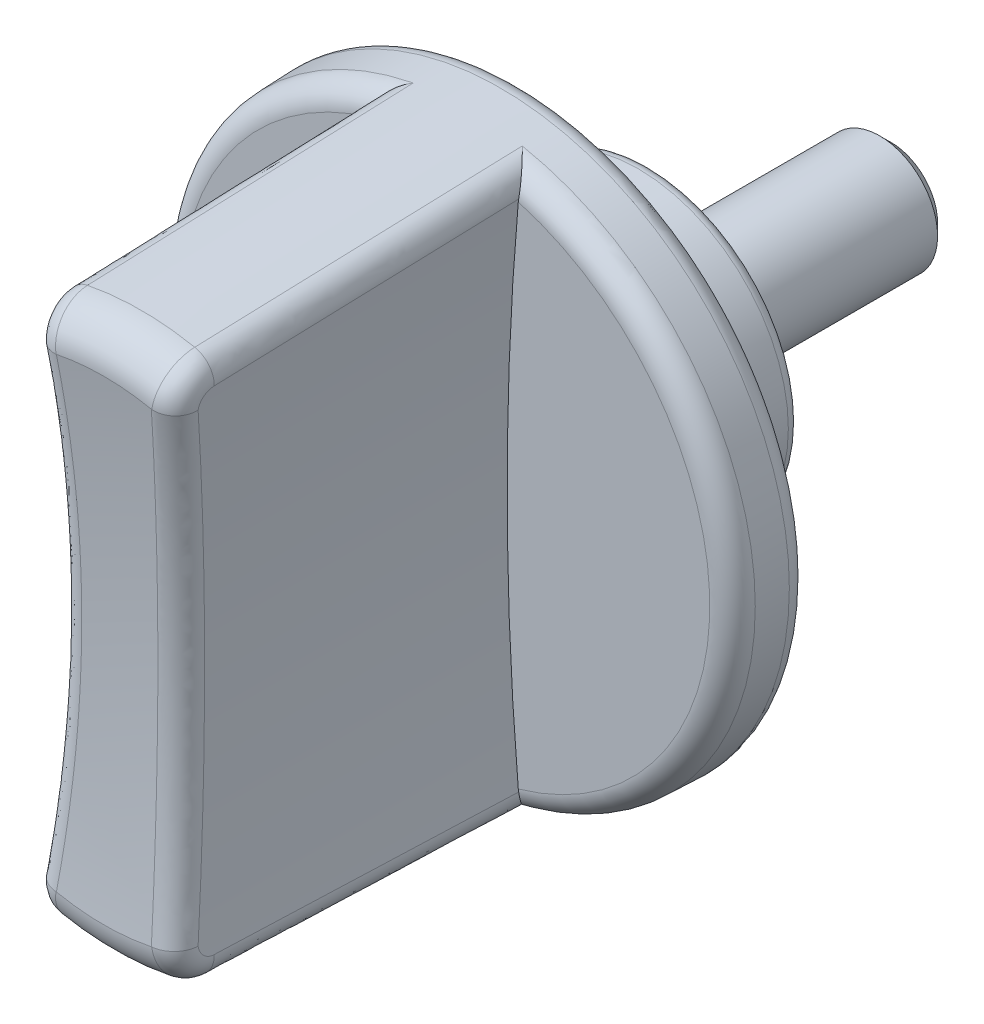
ISO-10303-21;
HEADER;
FILE_DESCRIPTION(('STEP AP214'),'2;1');
FILE_NAME('part.step','',(''),(''),'','','');
FILE_SCHEMA(('AUTOMOTIVE_DESIGN { 1 0 10303 214 1 1 1 1 }'));
ENDSEC;
DATA;
#1=APPLICATION_CONTEXT('core data for automotive mechanical design processes');
#2=APPLICATION_PROTOCOL_DEFINITION('international standard','automotive_design',2000,#1);
#3=PRODUCT_CONTEXT('',#1,'mechanical');
#4=PRODUCT('Part','Part','',(#3));
#5=PRODUCT_RELATED_PRODUCT_CATEGORY('part','',(#4));
#6=PRODUCT_DEFINITION_FORMATION('','',#4);
#7=PRODUCT_DEFINITION_CONTEXT('part definition',#1,'design');
#8=PRODUCT_DEFINITION('design','',#6,#7);
#9=PRODUCT_DEFINITION_SHAPE('','',#8);
#10=(LENGTH_UNIT() NAMED_UNIT(*) SI_UNIT(.MILLI.,.METRE.));
#11=(NAMED_UNIT(*) PLANE_ANGLE_UNIT() SI_UNIT($,.RADIAN.));
#12=(NAMED_UNIT(*) SI_UNIT($,.STERADIAN.) SOLID_ANGLE_UNIT());
#13=UNCERTAINTY_MEASURE_WITH_UNIT(LENGTH_MEASURE(1.E-05),#10,'distance_accuracy_value','');
#14=(GEOMETRIC_REPRESENTATION_CONTEXT(3) GLOBAL_UNCERTAINTY_ASSIGNED_CONTEXT((#13)) GLOBAL_UNIT_ASSIGNED_CONTEXT((#10,
#11,#12)) REPRESENTATION_CONTEXT('',''));
#15=CARTESIAN_POINT('',(0.,0.,0.));
#16=DIRECTION('',(0.,0.,1.));
#17=DIRECTION('',(1.,0.,0.));
#18=AXIS2_PLACEMENT_3D('',#15,#16,#17);
#19=CARTESIAN_POINT('',(0.,0.,6.86241624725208));
#20=DIRECTION('',(0.,0.,-1.));
#21=DIRECTION('',(-1.,0.,0.));
#22=AXIS2_PLACEMENT_3D('',#19,#20,#21);
#23=CONICAL_SURFACE('',#22,12.4698837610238,0.0349065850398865);
#24=CARTESIAN_POINT('',(0.,0.,8.2848994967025));
#25=DIRECTION('',(0.,0.,-1.));
#26=DIRECTION('',(-1.,0.,0.));
#27=AXIS2_PLACEMENT_3D('',#24,#25,#26);
#28=CIRCLE('',#27,12.4202095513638);
#29=CARTESIAN_POINT('',(-2.35538794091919,-12.1948248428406,8.28489949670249));
#30=VERTEX_POINT('',#29);
#31=CARTESIAN_POINT('',(-2.35538794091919,12.1948248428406,8.28489949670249));
#32=VERTEX_POINT('',#31);
#33=EDGE_CURVE('E148',#30,#32,#28,.T.);
#34=ORIENTED_EDGE('',*,*,#33,.T.);
#35=CARTESIAN_POINT('',(-2.26396741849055,10.9591425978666,43.4978114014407));
#36=CARTESIAN_POINT('',(-3.12852006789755,10.7806784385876,43.4939605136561));
#37=CARTESIAN_POINT('',(-3.05863794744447,9.9012081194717,43.4629119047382));
#38=CARTESIAN_POINT('',(-2.27229827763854,11.0828563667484,39.9800964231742));
#39=CARTESIAN_POINT('',(-3.1392994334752,10.9053806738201,39.9724846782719));
#40=CARTESIAN_POINT('',(-3.06836614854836,10.0236377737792,39.9451969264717));
#41=CARTESIAN_POINT('',(-2.2808765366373,11.2064808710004,36.4623794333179));
#42=CARTESIAN_POINT('',(-3.15024413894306,11.0298113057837,36.4550023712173));
#43=CARTESIAN_POINT('',(-3.07827024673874,10.1459965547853,36.4274799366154));
#44=CARTESIAN_POINT('',(-2.29851499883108,11.4535661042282,29.4269418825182));
#45=CARTESIAN_POINT('',(-3.17248858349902,11.2784466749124,29.4196678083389));
#46=CARTESIAN_POINT('',(-3.09843023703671,10.3905828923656,29.3920423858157));
#47=CARTESIAN_POINT('',(-2.30757520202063,11.5770268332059,25.9092213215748));
#48=CARTESIAN_POINT('',(-3.18378785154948,11.4026373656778,25.9021988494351));
#49=CARTESIAN_POINT('',(-3.10868612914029,10.5128104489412,25.8743218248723));
#50=CARTESIAN_POINT('',(-2.32616469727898,11.8237992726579,18.873777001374));
#51=CARTESIAN_POINT('',(-3.20674146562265,11.650814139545,18.8668750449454));
#52=CARTESIAN_POINT('',(-3.12954970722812,10.7571448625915,18.8388775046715));
#53=CARTESIAN_POINT('',(-2.3356939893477,11.9471109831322,15.3560532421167));
#54=CARTESIAN_POINT('',(-3.21839538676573,11.7747875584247,15.3493668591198));
#55=CARTESIAN_POINT('',(-3.1401573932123,10.8792517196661,15.3211537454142));
#56=CARTESIAN_POINT('',(-2.35521116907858,12.1935970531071,8.32060282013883));
#57=CARTESIAN_POINT('',(-3.24205818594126,12.0225435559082,8.31404485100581));
#58=CARTESIAN_POINT('',(-3.16172455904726,11.1233531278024,8.28570332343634));
#59=CARTESIAN_POINT('',(-2.36519905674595,12.3167714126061,4.80287615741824));
#60=CARTESIAN_POINT('',(-3.25406667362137,12.1463145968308,4.79654773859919));
#61=CARTESIAN_POINT('',(-3.17268403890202,11.2453476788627,4.76797666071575));
#62=CARTESIAN_POINT('',(-2.37541099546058,12.4398829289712,1.28514823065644));
#63=CARTESIAN_POINT('',(-3.26624163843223,12.2698878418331,1.28205067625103));
#64=CARTESIAN_POINT('',(-3.1838194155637,11.3672902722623,1.25024873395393));
#65=(BOUNDED_SURFACE() B_SPLINE_SURFACE(3,2,((#35,#36,#37),(#38,#39,#40),(#41,#42,#43),(#44,#45,
#46),(#47,#48,#49),(#50,#51,#52),(#53,#54,#55),(#56,#57,#58),(#59,#60,#61),(#62,#63,#64)),
.UNSPECIFIED.,.F.,.F.,.F.) B_SPLINE_SURFACE_WITH_KNOTS((4,2,2,2,4),(3,3),(0.,10.5596780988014,
21.1193560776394,31.6790340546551,42.2387121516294),(0.,1.),
.UNSPECIFIED.) GEOMETRIC_REPRESENTATION_ITEM() RATIONAL_B_SPLINE_SURFACE(((1.,0.749675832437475,
1.),(1.,0.748852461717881,1.),(1.,0.74805144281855,1.),(1.,0.746490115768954,1.),(1.,
0.745729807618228,1.),(1.,0.744245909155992,1.),(1.,0.743522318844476,1.),(1.,0.742108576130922,
1.),(1.,0.741418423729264,1.),(1.,0.740743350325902,1.))) REPRESENTATION_ITEM('') SURFACE());
#66=CARTESIAN_POINT('',(-2.37541099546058,12.4398829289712,1.28514823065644));
#67=CARTESIAN_POINT('',(-2.36519905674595,12.3167714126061,4.80287615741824));
#68=CARTESIAN_POINT('',(-2.35521116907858,12.193597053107,8.32060282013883));
#69=CARTESIAN_POINT('',(-2.3356939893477,11.9471109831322,15.3560532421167));
#70=CARTESIAN_POINT('',(-2.32616469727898,11.8237992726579,18.873777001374));
#71=CARTESIAN_POINT('',(-2.30757520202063,11.5770268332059,25.9092213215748));
#72=CARTESIAN_POINT('',(-2.29851499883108,11.4535661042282,29.4269418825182));
#73=CARTESIAN_POINT('',(-2.2808765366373,11.2064808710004,36.4623794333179));
#74=CARTESIAN_POINT('',(-2.27229827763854,11.0828563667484,39.9800964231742));
#75=CARTESIAN_POINT('',(-2.26396741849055,10.9591425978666,43.4978114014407));
#76=B_SPLINE_CURVE_WITH_KNOTS('',3,(#66,#67,#68,#69,#70,#71,#72,#73,#74,#75),.UNSPECIFIED.,.F.,
.F.,(4,2,2,2,4),(0.,10.5596780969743,21.11935607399,31.679034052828,42.2387121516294),.UNSPECIFIED.);
#77=CARTESIAN_POINT('',(-2.31686994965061,11.7004130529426,22.3914991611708));
#78=VERTEX_POINT('',#77);
#79=EDGE_CURVE('E471',#32,#78,#76,.T.);
#80=ORIENTED_EDGE('',*,*,#79,.T.);
#81=CARTESIAN_POINT('',(0.,0.,22.3914991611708));
#82=DIRECTION('',(0.,0.,1.));
#83=DIRECTION('',(1.,0.,0.));
#84=AXIS2_PLACEMENT_3D('',#81,#82,#83);
#85=CIRCLE('',#84,11.9275962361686);
#86=CARTESIAN_POINT('',(2.31686994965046,11.7004130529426,22.3914991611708));
#87=VERTEX_POINT('',#86);
#88=EDGE_CURVE('E164',#87,#78,#85,.T.);
#89=ORIENTED_EDGE('',*,*,#88,.F.);
#90=CARTESIAN_POINT('',(3.0586379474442,9.9012081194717,43.4629119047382));
#91=CARTESIAN_POINT('',(3.12852006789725,10.7806784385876,43.4939605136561));
#92=CARTESIAN_POINT('',(2.26396741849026,10.9591425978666,43.4978114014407));
#93=CARTESIAN_POINT('',(3.06836614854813,10.0236377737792,39.9451969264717));
#94=CARTESIAN_POINT('',(3.13929943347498,10.9053806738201,39.9724846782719));
#95=CARTESIAN_POINT('',(2.27229827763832,11.0828563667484,39.9800964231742));
#96=CARTESIAN_POINT('',(3.07827024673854,10.1459965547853,36.4274799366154));
#97=CARTESIAN_POINT('',(3.15024413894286,11.0298113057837,36.4550023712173));
#98=CARTESIAN_POINT('',(2.2808765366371,11.2064808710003,36.4623794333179));
#99=CARTESIAN_POINT('',(3.09843023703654,10.3905828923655,29.3920423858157));
#100=CARTESIAN_POINT('',(3.17248858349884,11.2784466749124,29.4196678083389));
#101=CARTESIAN_POINT('',(2.2985149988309,11.4535661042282,29.4269418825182));
#102=CARTESIAN_POINT('',(3.10868612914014,10.5128104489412,25.8743218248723));
#103=CARTESIAN_POINT('',(3.1837878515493,11.4026373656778,25.9021988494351));
#104=CARTESIAN_POINT('',(2.30757520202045,11.5770268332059,25.9092213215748));
#105=CARTESIAN_POINT('',(3.12954970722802,10.7571448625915,18.8388775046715));
#106=CARTESIAN_POINT('',(3.20674146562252,11.650814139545,18.8668750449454));
#107=CARTESIAN_POINT('',(2.32616469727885,11.8237992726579,18.873777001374));
#108=CARTESIAN_POINT('',(3.14015739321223,10.8792517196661,15.3211537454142));
#109=CARTESIAN_POINT('',(3.21839538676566,11.7747875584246,15.3493668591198));
#110=CARTESIAN_POINT('',(2.33569398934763,11.9471109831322,15.3560532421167));
#111=CARTESIAN_POINT('',(3.16172455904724,11.1233531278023,8.28570332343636));
#112=CARTESIAN_POINT('',(3.24205818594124,12.0225435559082,8.31404485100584));
#113=CARTESIAN_POINT('',(2.35521116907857,12.193597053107,8.32060282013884));
#114=CARTESIAN_POINT('',(3.17268403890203,11.2453476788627,4.76797666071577));
#115=CARTESIAN_POINT('',(3.25406667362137,12.1463145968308,4.79654773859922));
#116=CARTESIAN_POINT('',(2.36519905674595,12.3167714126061,4.80287615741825));
#117=CARTESIAN_POINT('',(3.18381941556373,11.3672902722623,1.25024873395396));
#118=CARTESIAN_POINT('',(3.26624163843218,12.2698878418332,1.28205067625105));
#119=CARTESIAN_POINT('',(2.37541099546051,12.4398829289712,1.28514823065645));
#120=(BOUNDED_SURFACE() B_SPLINE_SURFACE(3,2,((#90,#91,#92),(#93,#94,#95),(#96,#97,#98),(#99,
#100,#101),(#102,#103,#104),(#105,#106,#107),(#108,#109,#110),(#111,#112,#113),(#114,#115,#116),
(#117,#118,#119)),.UNSPECIFIED.,.F.,.F.,.F.) B_SPLINE_SURFACE_WITH_KNOTS((4,2,2,2,4),(3,3),(0.,
10.5596780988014,21.1193560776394,31.6790340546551,42.2387121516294),(0.,1.),
.UNSPECIFIED.) GEOMETRIC_REPRESENTATION_ITEM() RATIONAL_B_SPLINE_SURFACE(((1.,0.749675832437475,
1.),(1.,0.748852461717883,1.),(1.,0.748051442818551,1.),(1.,0.746490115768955,1.),(1.,
0.745729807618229,1.),(1.,0.744245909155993,1.),(1.,0.743522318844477,1.),(1.,0.742108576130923,
1.),(1.,0.741418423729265,1.),(1.,0.740743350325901,1.))) REPRESENTATION_ITEM('') SURFACE());
#121=CARTESIAN_POINT('',(2.26396741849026,10.9591425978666,43.4978114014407));
#122=CARTESIAN_POINT('',(2.27229827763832,11.0828563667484,39.9800964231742));
#123=CARTESIAN_POINT('',(2.2808765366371,11.2064808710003,36.4623794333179));
#124=CARTESIAN_POINT('',(2.2985149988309,11.4535661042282,29.4269418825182));
#125=CARTESIAN_POINT('',(2.30757520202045,11.5770268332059,25.9092213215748));
#126=CARTESIAN_POINT('',(2.32616469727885,11.8237992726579,18.873777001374));
#127=CARTESIAN_POINT('',(2.33569398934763,11.9471109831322,15.3560532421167));
#128=CARTESIAN_POINT('',(2.35521116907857,12.193597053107,8.32060282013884));
#129=CARTESIAN_POINT('',(2.36519905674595,12.3167714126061,4.80287615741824));
#130=CARTESIAN_POINT('',(2.37541099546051,12.4398829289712,1.28514823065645));
#131=B_SPLINE_CURVE_WITH_KNOTS('',3,(#121,#122,#123,#124,#125,#126,#127,#128,#129,#130),
.UNSPECIFIED.,.F.,.F.,(4,2,2,2,4),(0.,10.5596780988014,21.1193560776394,31.6790340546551,
42.2387121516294),.UNSPECIFIED.);
#132=CARTESIAN_POINT('',(2.35538794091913,12.1948248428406,8.28489949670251));
#133=VERTEX_POINT('',#132);
#134=EDGE_CURVE('E645',#87,#133,#131,.T.);
#135=ORIENTED_EDGE('',*,*,#134,.T.);
#136=CARTESIAN_POINT('',(0.,0.,8.2848994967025));
#137=DIRECTION('',(0.,0.,-1.));
#138=DIRECTION('',(-1.,0.,0.));
#139=AXIS2_PLACEMENT_3D('',#136,#137,#138);
#140=CIRCLE('',#139,12.4202095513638);
#141=CARTESIAN_POINT('',(2.35538794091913,-12.1948248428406,8.28489949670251));
#142=VERTEX_POINT('',#141);
#143=EDGE_CURVE('E651',#133,#142,#140,.T.);
#144=ORIENTED_EDGE('',*,*,#143,.T.);
#145=CARTESIAN_POINT('',(2.26396741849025,-10.9591425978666,43.4978114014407));
#146=CARTESIAN_POINT('',(3.12852006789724,-10.7806784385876,43.4939605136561));
#147=CARTESIAN_POINT('',(3.05863794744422,-9.9012081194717,43.4629119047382));
#148=CARTESIAN_POINT('',(2.27229827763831,-11.0828563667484,39.9800964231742));
#149=CARTESIAN_POINT('',(3.13929943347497,-10.9053806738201,39.9724846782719));
#150=CARTESIAN_POINT('',(3.06836614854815,-10.0236377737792,39.9451969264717));
#151=CARTESIAN_POINT('',(2.28087653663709,-11.2064808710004,36.4623794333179));
#152=CARTESIAN_POINT('',(3.15024413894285,-11.0298113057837,36.4550023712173));
#153=CARTESIAN_POINT('',(3.07827024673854,-10.1459965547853,36.4274799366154));
#154=CARTESIAN_POINT('',(2.29851499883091,-11.4535661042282,29.4269418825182));
#155=CARTESIAN_POINT('',(3.17248858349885,-11.2784466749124,29.4196678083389));
#156=CARTESIAN_POINT('',(3.09843023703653,-10.3905828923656,29.3920423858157));
#157=CARTESIAN_POINT('',(2.30757520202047,-11.5770268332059,25.9092213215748));
#158=CARTESIAN_POINT('',(3.18378785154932,-11.4026373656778,25.9021988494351));
#159=CARTESIAN_POINT('',(3.10868612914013,-10.5128104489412,25.8743218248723));
#160=CARTESIAN_POINT('',(2.32616469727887,-11.8237992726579,18.873777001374));
#161=CARTESIAN_POINT('',(3.20674146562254,-11.650814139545,18.8668750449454));
#162=CARTESIAN_POINT('',(3.12954970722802,-10.7571448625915,18.8388775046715));
#163=CARTESIAN_POINT('',(2.33569398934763,-11.9471109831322,15.3560532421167));
#164=CARTESIAN_POINT('',(3.21839538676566,-11.7747875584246,15.3493668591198));
#165=CARTESIAN_POINT('',(3.14015739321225,-10.8792517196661,15.3211537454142));
#166=CARTESIAN_POINT('',(2.35521116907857,-12.193597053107,8.32060282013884));
#167=CARTESIAN_POINT('',(3.24205818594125,-12.0225435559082,8.31404485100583));
#168=CARTESIAN_POINT('',(3.16172455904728,-11.1233531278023,8.28570332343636));
#169=CARTESIAN_POINT('',(2.36519905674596,-12.3167714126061,4.80287615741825));
#170=CARTESIAN_POINT('',(3.25406667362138,-12.1463145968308,4.79654773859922));
#171=CARTESIAN_POINT('',(3.17268403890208,-11.2453476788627,4.76797666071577));
#172=CARTESIAN_POINT('',(2.37541099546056,-12.4398829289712,1.28514823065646));
#173=CARTESIAN_POINT('',(3.26624163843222,-12.2698878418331,1.28205067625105));
#174=CARTESIAN_POINT('',(3.18381941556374,-11.3672902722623,1.25024873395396));
#175=(BOUNDED_SURFACE() B_SPLINE_SURFACE(3,2,((#145,#146,#147),(#148,#149,#150),(#151,#152,
#153),(#154,#155,#156),(#157,#158,#159),(#160,#161,#162),(#163,#164,#165),(#166,#167,#168),
(#169,#170,#171),(#172,#173,#174)),.UNSPECIFIED.,.F.,.F.,.F.) B_SPLINE_SURFACE_WITH_KNOTS((4,2,
2,2,4),(3,3),(0.,10.5596780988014,21.1193560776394,31.6790340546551,42.2387121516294),(0.,1.),
.UNSPECIFIED.) GEOMETRIC_REPRESENTATION_ITEM() RATIONAL_B_SPLINE_SURFACE(((1.,0.749675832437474,
1.),(1.,0.748852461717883,1.),(1.,0.748051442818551,1.),(1.,0.746490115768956,1.),(1.,
0.745729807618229,1.),(1.,0.744245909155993,1.),(1.,0.743522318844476,1.),(1.,0.742108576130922,
1.),(1.,0.741418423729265,1.),(1.,0.740743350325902,1.))) REPRESENTATION_ITEM('') SURFACE());
#176=CARTESIAN_POINT('',(2.37541099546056,-12.4398829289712,1.28514823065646));
#177=CARTESIAN_POINT('',(2.36519905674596,-12.3167714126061,4.80287615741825));
#178=CARTESIAN_POINT('',(2.35521116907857,-12.193597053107,8.32060282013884));
#179=CARTESIAN_POINT('',(2.33569398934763,-11.9471109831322,15.3560532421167));
#180=CARTESIAN_POINT('',(2.32616469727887,-11.8237992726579,18.873777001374));
#181=CARTESIAN_POINT('',(2.30757520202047,-11.5770268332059,25.9092213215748));
#182=CARTESIAN_POINT('',(2.29851499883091,-11.4535661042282,29.4269418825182));
#183=CARTESIAN_POINT('',(2.28087653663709,-11.2064808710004,36.4623794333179));
#184=CARTESIAN_POINT('',(2.2722982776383,-11.0828563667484,39.9800964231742));
#185=CARTESIAN_POINT('',(2.26396741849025,-10.9591425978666,43.4978114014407));
#186=B_SPLINE_CURVE_WITH_KNOTS('',3,(#176,#177,#178,#179,#180,#181,#182,#183,#184,#185),
.UNSPECIFIED.,.F.,.F.,(4,2,2,2,4),(0.,10.5596780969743,21.11935607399,31.679034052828,
42.2387121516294),.UNSPECIFIED.);
#187=CARTESIAN_POINT('',(2.31686994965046,-11.7004130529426,22.3914991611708));
#188=VERTEX_POINT('',#187);
#189=EDGE_CURVE('E149',#142,#188,#186,.T.);
#190=ORIENTED_EDGE('',*,*,#189,.T.);
#191=CARTESIAN_POINT('',(-2.31686994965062,-11.7004130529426,22.3914991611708));
#192=VERTEX_POINT('',#191);
#193=EDGE_CURVE('E154',#192,#188,#85,.T.);
#194=ORIENTED_EDGE('',*,*,#193,.F.);
#195=CARTESIAN_POINT('',(-3.05863794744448,-9.9012081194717,43.4629119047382));
#196=CARTESIAN_POINT('',(-3.12852006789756,-10.7806784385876,43.4939605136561));
#197=CARTESIAN_POINT('',(-2.26396741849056,-10.9591425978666,43.4978114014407));
#198=CARTESIAN_POINT('',(-3.06836614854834,-10.0236377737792,39.9451969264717));
#199=CARTESIAN_POINT('',(-3.13929943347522,-10.9053806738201,39.9724846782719));
#200=CARTESIAN_POINT('',(-2.27229827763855,-11.0828563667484,39.9800964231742));
#201=CARTESIAN_POINT('',(-3.07827024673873,-10.1459965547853,36.4274799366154));
#202=CARTESIAN_POINT('',(-3.15024413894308,-11.0298113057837,36.4550023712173));
#203=CARTESIAN_POINT('',(-2.28087653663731,-11.2064808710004,36.4623794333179));
#204=CARTESIAN_POINT('',(-3.0984302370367,-10.3905828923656,29.3920423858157));
#205=CARTESIAN_POINT('',(-3.17248858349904,-11.2784466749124,29.4196678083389));
#206=CARTESIAN_POINT('',(-2.29851499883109,-11.4535661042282,29.4269418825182));
#207=CARTESIAN_POINT('',(-3.1086861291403,-10.5128104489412,25.8743218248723));
#208=CARTESIAN_POINT('',(-3.18378785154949,-11.4026373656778,25.9021988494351));
#209=CARTESIAN_POINT('',(-2.30757520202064,-11.5770268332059,25.9092213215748));
#210=CARTESIAN_POINT('',(-3.12954970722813,-10.7571448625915,18.8388775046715));
#211=CARTESIAN_POINT('',(-3.20674146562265,-11.650814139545,18.8668750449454));
#212=CARTESIAN_POINT('',(-2.32616469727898,-11.8237992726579,18.873777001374));
#213=CARTESIAN_POINT('',(-3.1401573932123,-10.8792517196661,15.3211537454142));
#214=CARTESIAN_POINT('',(-3.21839538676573,-11.7747875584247,15.3493668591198));
#215=CARTESIAN_POINT('',(-2.3356939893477,-11.9471109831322,15.3560532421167));
#216=CARTESIAN_POINT('',(-3.16172455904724,-11.1233531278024,8.28570332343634));
#217=CARTESIAN_POINT('',(-3.24205818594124,-12.0225435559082,8.31404485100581));
#218=CARTESIAN_POINT('',(-2.35521116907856,-12.1935970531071,8.32060282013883));
#219=CARTESIAN_POINT('',(-3.17268403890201,-11.2453476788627,4.76797666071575));
#220=CARTESIAN_POINT('',(-3.25406667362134,-12.1463145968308,4.79654773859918));
#221=CARTESIAN_POINT('',(-2.36519905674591,-12.3167714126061,4.80287615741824));
#222=CARTESIAN_POINT('',(-3.18381941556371,-11.3672902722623,1.25024873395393));
#223=CARTESIAN_POINT('',(-3.26624163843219,-12.2698878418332,1.28205067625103));
#224=CARTESIAN_POINT('',(-2.37541099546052,-12.4398829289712,1.28514823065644));
#225=(BOUNDED_SURFACE() B_SPLINE_SURFACE(3,2,((#195,#196,#197),(#198,#199,#200),(#201,#202,
#203),(#204,#205,#206),(#207,#208,#209),(#210,#211,#212),(#213,#214,#215),(#216,#217,#218),
(#219,#220,#221),(#222,#223,#224)),.UNSPECIFIED.,.F.,.F.,.F.) B_SPLINE_SURFACE_WITH_KNOTS((4,2,
2,2,4),(3,3),(0.,10.5596780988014,21.1193560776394,31.6790340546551,42.2387121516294),(0.,1.),
.UNSPECIFIED.) GEOMETRIC_REPRESENTATION_ITEM() RATIONAL_B_SPLINE_SURFACE(((1.,0.749675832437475,
1.),(1.,0.748852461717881,1.),(1.,0.74805144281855,1.),(1.,0.746490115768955,1.),(1.,
0.745729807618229,1.),(1.,0.744245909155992,1.),(1.,0.743522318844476,1.),(1.,0.742108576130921,
1.),(1.,0.741418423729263,1.),(1.,0.740743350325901,1.))) REPRESENTATION_ITEM('') SURFACE());
#226=CARTESIAN_POINT('',(-2.26396741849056,-10.9591425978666,43.4978114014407));
#227=CARTESIAN_POINT('',(-2.27229827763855,-11.0828563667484,39.9800964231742));
#228=CARTESIAN_POINT('',(-2.28087653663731,-11.2064808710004,36.4623794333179));
#229=CARTESIAN_POINT('',(-2.29851499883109,-11.4535661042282,29.4269418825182));
#230=CARTESIAN_POINT('',(-2.30757520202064,-11.5770268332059,25.9092213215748));
#231=CARTESIAN_POINT('',(-2.32616469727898,-11.8237992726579,18.873777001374));
#232=CARTESIAN_POINT('',(-2.3356939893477,-11.9471109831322,15.3560532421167));
#233=CARTESIAN_POINT('',(-2.35521116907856,-12.1935970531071,8.32060282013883));
#234=CARTESIAN_POINT('',(-2.36519905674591,-12.3167714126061,4.80287615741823));
#235=CARTESIAN_POINT('',(-2.37541099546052,-12.4398829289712,1.28514823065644));
#236=B_SPLINE_CURVE_WITH_KNOTS('',3,(#226,#227,#228,#229,#230,#231,#232,#233,#234,#235),
.UNSPECIFIED.,.F.,.F.,(4,2,2,2,4),(0.,10.5596780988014,21.1193560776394,31.6790340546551,
42.2387121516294),.UNSPECIFIED.);
#237=EDGE_CURVE('E141',#192,#30,#236,.T.);
#238=ORIENTED_EDGE('',*,*,#237,.T.);
#239=EDGE_LOOP('',(#34,#80,#89,#135,#144,#190,#194,#238));
#240=FACE_BOUND('',#239,.T.);
#241=CARTESIAN_POINT('',(0.,0.,6.86241624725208));
#242=DIRECTION('',(0.,0.,1.));
#243=DIRECTION('',(1.,0.,0.));
#244=AXIS2_PLACEMENT_3D('',#241,#242,#243);
#245=CIRCLE('',#244,12.4698837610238);
#246=CARTESIAN_POINT('',(12.4698837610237,0.,6.86241624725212));
#247=VERTEX_POINT('',#246);
#248=EDGE_CURVE('E168',#247,#247,#245,.T.);
#249=ORIENTED_EDGE('',*,*,#248,.T.);
#250=EDGE_LOOP('',(#249));
#251=FACE_BOUND('',#250,.T.);
#252=ADVANCED_FACE('F14',(#240,#251),#23,.T.);
#253=CARTESIAN_POINT('',(0.,0.,22.3333333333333));
#254=DIRECTION('',(0.,0.,1.));
#255=DIRECTION('',(1.,0.,0.));
#256=AXIS2_PLACEMENT_3D('',#253,#254,#255);
#257=TOROIDAL_SURFACE('',#256,10.2619448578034,1.66666666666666);
#258=CARTESIAN_POINT('',(-4.60148244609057,21.9123883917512,25.6650824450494));
#259=CARTESIAN_POINT('',(-4.55007249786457,21.6236597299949,26.6168398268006));
#260=CARTESIAN_POINT('',(-3.56937554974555,21.7970600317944,26.6207344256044));
#261=CARTESIAN_POINT('',(-4.44308289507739,21.0228966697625,25.3844483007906));
#262=CARTESIAN_POINT('',(-4.39557785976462,20.7439508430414,26.3416180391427));
#263=CARTESIAN_POINT('',(-3.41180968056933,20.9122498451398,26.343792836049));
#264=CARTESIAN_POINT('',(-4.29344771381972,20.1265266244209,25.1209245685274));
#265=CARTESIAN_POINT('',(-4.24984903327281,19.8586825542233,26.08354728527));
#266=CARTESIAN_POINT('',(-3.26296205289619,20.0205975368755,26.0837365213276));
#267=CARTESIAN_POINT('',(-4.0125302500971,18.32159208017,24.6285326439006));
#268=CARTESIAN_POINT('',(-3.976253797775,18.0762221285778,25.6013026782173));
#269=CARTESIAN_POINT('',(-2.98352310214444,18.2251626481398,25.5978234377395));
#270=CARTESIAN_POINT('',(-3.88124862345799,17.4130271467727,24.3996656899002));
#271=CARTESIAN_POINT('',(-3.84845503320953,17.1792230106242,25.3772527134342));
#272=CARTESIAN_POINT('',(-2.85293243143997,17.3213796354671,25.3719678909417));
#273=CARTESIAN_POINT('',(-3.63786270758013,15.5852450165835,23.9770227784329));
#274=CARTESIAN_POINT('',(-3.6115032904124,15.374797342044,24.963447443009));
#275=CARTESIAN_POINT('',(-2.61082749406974,15.5032174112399,24.9548860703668));
#276=CARTESIAN_POINT('',(-3.52576017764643,14.6660268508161,23.7832500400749));
#277=CARTESIAN_POINT('',(-3.50241317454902,14.467584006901,24.7738049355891));
#278=CARTESIAN_POINT('',(-2.49931497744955,14.5888372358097,24.763662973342));
#279=CARTESIAN_POINT('',(-3.32143652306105,12.8188161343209,23.4312007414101));
#280=CARTESIAN_POINT('',(-3.30355643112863,12.6445161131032,24.4292071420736));
#281=CARTESIAN_POINT('',(-2.29606671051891,12.7513486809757,24.4162459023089));
#282=CARTESIAN_POINT('',(-3.229215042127,11.8908237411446,23.2729235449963));
#283=CARTESIAN_POINT('',(-3.21384295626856,11.7288937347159,24.2743456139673));
#284=CARTESIAN_POINT('',(-2.20433060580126,11.8282404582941,24.2600513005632));
#285=CARTESIAN_POINT('',(-2.98807761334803,9.15075571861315,22.8600462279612));
#286=CARTESIAN_POINT('',(-2.97908962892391,9.02388588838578,23.8700681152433));
#287=CARTESIAN_POINT('',(-1.96446232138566,9.10259384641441,23.8526065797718));
#288=CARTESIAN_POINT('',(-2.86747403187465,7.32848839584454,22.654960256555));
#289=CARTESIAN_POINT('',(-2.86190774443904,7.22720456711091,23.6696351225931));
#290=CARTESIAN_POINT('',(-1.84449349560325,7.28991740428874,23.6502191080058));
#291=CARTESIAN_POINT('',(-2.70638291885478,3.67081291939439,22.3813922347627));
#292=CARTESIAN_POINT('',(-2.70522453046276,3.61937384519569,23.4019914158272));
#293=CARTESIAN_POINT('',(-1.68425023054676,3.65149285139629,23.3802506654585));
#294=CARTESIAN_POINT('',(-2.66588523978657,1.83540645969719,22.3128928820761));
#295=CARTESIAN_POINT('',(-2.66588523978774,1.81019060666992,23.3350580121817));
#296=CARTESIAN_POINT('',(-1.64396569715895,1.82574642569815,23.3126526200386));
#297=CARTESIAN_POINT('',(-2.66588523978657,-1.83540645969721,22.3128928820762));
#298=CARTESIAN_POINT('',(-2.66588523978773,-1.81019060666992,23.3350580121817));
#299=CARTESIAN_POINT('',(-1.64396569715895,-1.82574642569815,23.3126526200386));
#300=CARTESIAN_POINT('',(-2.70638291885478,-3.6708129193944,22.3813922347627));
#301=CARTESIAN_POINT('',(-2.70522453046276,-3.61937384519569,23.4019914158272));
#302=CARTESIAN_POINT('',(-1.68425023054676,-3.6514928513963,23.3802506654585));
#303=CARTESIAN_POINT('',(-2.86747403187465,-7.32848839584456,22.6549602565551));
#304=CARTESIAN_POINT('',(-2.86190774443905,-7.22720456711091,23.6696351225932));
#305=CARTESIAN_POINT('',(-1.84449349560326,-7.28991740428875,23.6502191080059));
#306=CARTESIAN_POINT('',(-2.98807761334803,-9.15075571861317,22.8600462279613));
#307=CARTESIAN_POINT('',(-2.97908962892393,-9.02388588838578,23.8700681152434));
#308=CARTESIAN_POINT('',(-1.96446232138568,-9.10259384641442,23.852606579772));
#309=CARTESIAN_POINT('',(-3.229215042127,-11.8908237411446,23.2729235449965));
#310=CARTESIAN_POINT('',(-3.21384295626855,-11.728893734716,24.2743456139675));
#311=CARTESIAN_POINT('',(-2.20433060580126,-11.8282404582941,24.2600513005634));
#312=CARTESIAN_POINT('',(-3.32143652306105,-12.8188161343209,23.4312007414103));
#313=CARTESIAN_POINT('',(-3.30355643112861,-12.6445161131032,24.4292071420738));
#314=CARTESIAN_POINT('',(-2.29606671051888,-12.7513486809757,24.4162459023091));
#315=CARTESIAN_POINT('',(-3.52576017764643,-14.6660268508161,23.7832500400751));
#316=CARTESIAN_POINT('',(-3.502413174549,-14.467584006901,24.7738049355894));
#317=CARTESIAN_POINT('',(-2.49931497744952,-14.5888372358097,24.7636629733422));
#318=CARTESIAN_POINT('',(-3.63786270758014,-15.5852450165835,23.9770227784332));
#319=CARTESIAN_POINT('',(-3.6115032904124,-15.374797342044,24.9634474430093));
#320=CARTESIAN_POINT('',(-2.61082749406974,-15.5032174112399,24.954886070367));
#321=CARTESIAN_POINT('',(-3.88124862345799,-17.4130271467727,24.3996656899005));
#322=CARTESIAN_POINT('',(-3.84845503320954,-17.1792230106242,25.3772527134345));
#323=CARTESIAN_POINT('',(-2.85293243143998,-17.3213796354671,25.3719678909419));
#324=CARTESIAN_POINT('',(-4.01253025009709,-18.32159208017,24.628532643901));
#325=CARTESIAN_POINT('',(-3.97625379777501,-18.0762221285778,25.6013026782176));
#326=CARTESIAN_POINT('',(-2.98352310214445,-18.2251626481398,25.5978234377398));
#327=CARTESIAN_POINT('',(-4.2934477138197,-20.1265266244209,25.1209245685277));
#328=CARTESIAN_POINT('',(-4.24984903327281,-19.8586825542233,26.0835472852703));
#329=CARTESIAN_POINT('',(-3.26296205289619,-20.0205975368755,26.083736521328));
#330=CARTESIAN_POINT('',(-4.44308289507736,-21.0228966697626,25.384448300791));
#331=CARTESIAN_POINT('',(-4.39557785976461,-20.7439508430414,26.3416180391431));
#332=CARTESIAN_POINT('',(-3.41180968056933,-20.9122498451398,26.3437928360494));
#333=CARTESIAN_POINT('',(-4.60148244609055,-21.9123883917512,25.6650824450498));
#334=CARTESIAN_POINT('',(-4.55007249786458,-21.6236597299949,26.616839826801));
#335=CARTESIAN_POINT('',(-3.56937554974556,-21.7970600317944,26.6207344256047));
#336=(BOUNDED_SURFACE() B_SPLINE_SURFACE(3,2,((#258,#259,#260),(#261,#262,#263),(#264,#265,
#266),(#267,#268,#269),(#270,#271,#272),(#273,#274,#275),(#276,#277,#278),(#279,#280,#281),
(#282,#283,#284),(#285,#286,#287),(#288,#289,#290),(#291,#292,#293),(#294,#295,#296),(#297,#298,
#299),(#300,#301,#302),(#303,#304,#305),(#306,#307,#308),(#309,#310,#311),(#312,#313,#314),
(#315,#316,#317),(#318,#319,#320),(#321,#322,#323),(#324,#325,#326),(#327,#328,#329),(#330,#331,
#332),(#333,#334,#335)),.UNSPECIFIED.,.F.,.F.,.F.) B_SPLINE_SURFACE_WITH_KNOTS((4,2,2,2,2,2,2,2,
2,2,2,2,4),(3,3),(0.,2.85869705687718,5.71749623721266,8.57655751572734,11.4355675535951,
16.9849425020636,22.5336144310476,28.0822863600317,33.6316613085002,36.490671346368,
39.3497326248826,42.2085318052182,45.0672288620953),(0.,1.),
.UNSPECIFIED.) GEOMETRIC_REPRESENTATION_ITEM() RATIONAL_B_SPLINE_SURFACE(((1.,0.708552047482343,
1.),(1.,0.707800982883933,1.),(1.,0.707090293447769,1.),(1.,0.705754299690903,1.),(1.,
0.705128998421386,1.),(1.,0.703968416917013,1.),(1.,0.703433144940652,1.),(1.,0.702456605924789,
1.),(1.,0.702015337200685,1.),(1.,0.700860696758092,1.),(1.,0.700282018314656,1.),(1.,
0.699508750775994,1.),(1.,0.69931411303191,1.),(1.,0.69931411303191,1.),(1.,0.699508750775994,
1.),(1.,0.700282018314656,1.),(1.,0.700860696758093,1.),(1.,0.702015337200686,1.),(1.,
0.70245660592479,1.),(1.,0.703433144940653,1.),(1.,0.703968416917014,1.),(1.,0.705128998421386,
1.),(1.,0.705754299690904,1.),(1.,0.70709029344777,1.),(1.,0.707800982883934,1.),(1.,
0.708552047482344,1.))) REPRESENTATION_ITEM('') SURFACE());
#337=CARTESIAN_POINT('',(-2.05117297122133,-10.0548596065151,24.));
#338=CARTESIAN_POINT('',(-2.05388320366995,-10.0542700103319,24.0000000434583));
#339=CARTESIAN_POINT('',(-2.05660770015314,-10.053780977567,24.0000000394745));
#340=CARTESIAN_POINT('',(-2.06208523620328,-10.0530040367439,23.9999999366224));
#341=CARTESIAN_POINT('',(-2.06483827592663,-10.0527161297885,23.9999998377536));
#342=CARTESIAN_POINT('',(-2.06760557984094,-10.052528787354,23.9999996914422));
#343=B_SPLINE_CURVE_WITH_KNOTS('',3,(#337,#338,#339,#340,#341,#342),.UNSPECIFIED.,.F.,.F.,(4,2,
4),(0.,0.00830411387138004,0.0166082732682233),.UNSPECIFIED.);
#344=CARTESIAN_POINT('',(-2.05117297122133,-10.0548596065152,24.));
#345=VERTEX_POINT('',#344);
#346=CARTESIAN_POINT('',(-2.06760557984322,-10.0525287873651,23.9999996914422));
#347=VERTEX_POINT('',#346);
#348=EDGE_CURVE('E158',#345,#347,#343,.T.);
#349=ORIENTED_EDGE('',*,*,#348,.T.);
#350=CARTESIAN_POINT('',(-2.31331848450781,-11.6764623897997,22.0446059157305));
#351=CARTESIAN_POINT('',(-3.19335372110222,-11.5051542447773,22.0615747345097));
#352=CARTESIAN_POINT('',(-3.11829678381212,-10.6253569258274,22.2178423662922));
#353=CARTESIAN_POINT('',(-2.31479567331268,-11.686422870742,22.1017532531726));
#354=CARTESIAN_POINT('',(-3.19414364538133,-11.5140771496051,22.1154327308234));
#355=CARTESIAN_POINT('',(-3.1186381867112,-10.6293579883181,22.2407013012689));
#356=CARTESIAN_POINT('',(-2.31583203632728,-11.6934122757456,22.1594077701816));
#357=CARTESIAN_POINT('',(-3.19469798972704,-11.5203357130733,22.1697160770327));
#358=CARTESIAN_POINT('',(-3.1188778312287,-10.6321655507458,22.2637631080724));
#359=CARTESIAN_POINT('',(-2.31701895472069,-11.7014177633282,22.2752345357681));
#360=CARTESIAN_POINT('',(-3.19533282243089,-11.5275012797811,22.278692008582));
#361=CARTESIAN_POINT('',(-3.1191523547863,-10.6353812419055,22.310093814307));
#362=CARTESIAN_POINT('',(-2.31716811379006,-11.7024244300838,22.3334074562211));
#363=CARTESIAN_POINT('',(-3.19541276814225,-11.5284021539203,22.3334025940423));
#364=CARTESIAN_POINT('',(-3.11918691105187,-10.63578558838,22.3333629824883));
#365=CARTESIAN_POINT('',(-2.31639168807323,-11.6971867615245,22.4846794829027));
#366=CARTESIAN_POINT('',(-3.19499728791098,-11.5237145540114,22.4756925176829));
#367=CARTESIAN_POINT('',(-3.1190072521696,-10.6336817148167,22.3938717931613));
#368=CARTESIAN_POINT('',(-2.31476251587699,-11.6861953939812,22.5776508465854));
#369=CARTESIAN_POINT('',(-3.19412475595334,-11.5138731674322,22.563216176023));
#370=CARTESIAN_POINT('',(-3.11863016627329,-10.6292667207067,22.4310603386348));
#371=CARTESIAN_POINT('',(-2.30924238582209,-11.6489854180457,22.7604134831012));
#372=CARTESIAN_POINT('',(-3.1911741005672,-11.4805151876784,22.7356494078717));
#373=CARTESIAN_POINT('',(-3.11735542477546,-10.6143193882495,22.5041653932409));
#374=CARTESIAN_POINT('',(-2.30535006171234,-11.6227576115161,22.8502028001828));
#375=CARTESIAN_POINT('',(-3.18909281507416,-11.4569627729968,22.8206261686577));
#376=CARTESIAN_POINT('',(-3.1164574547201,-10.603783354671,22.540081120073));
#377=CARTESIAN_POINT('',(-2.29540851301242,-11.5558598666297,23.0239999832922));
#378=CARTESIAN_POINT('',(-3.18379040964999,-11.3967403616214,22.9858566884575));
#379=CARTESIAN_POINT('',(-3.11417222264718,-10.576907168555,22.609599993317));
#380=CARTESIAN_POINT('',(-2.2893603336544,-11.5151969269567,23.1080106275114));
#381=CARTESIAN_POINT('',(-3.18056557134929,-11.3600279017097,23.0661720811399));
#382=CARTESIAN_POINT('',(-3.1127851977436,-10.5605698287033,22.6432042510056));
#383=CARTESIAN_POINT('',(-2.27526535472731,-11.4206102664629,23.2679339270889));
#384=CARTESIAN_POINT('',(-3.17307255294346,-11.2743097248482,23.2201728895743));
#385=CARTESIAN_POINT('',(-3.10956849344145,-10.5225624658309,22.7071735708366));
#386=CARTESIAN_POINT('',(-2.26721832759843,-11.3666850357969,23.343845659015));
#387=CARTESIAN_POINT('',(-3.168798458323,-11.2252353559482,23.2939020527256));
#388=CARTESIAN_POINT('',(-3.10773876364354,-10.500891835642,22.7375382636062));
#389=CARTESIAN_POINT('',(-2.24931328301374,-11.2469792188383,23.4856424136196));
#390=CARTESIAN_POINT('',(-3.15931907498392,-11.1157424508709,23.4330999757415));
#391=CARTESIAN_POINT('',(-3.10369193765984,-10.4527786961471,22.7942569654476));
#392=CARTESIAN_POINT('',(-2.23945050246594,-11.1811674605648,23.5515002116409));
#393=CARTESIAN_POINT('',(-3.15410444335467,-11.0552123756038,23.498570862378));
#394=CARTESIAN_POINT('',(-3.1014738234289,-10.426323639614,22.8206000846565));
#395=CARTESIAN_POINT('',(-2.21818676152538,-11.0396777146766,23.6711331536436));
#396=CARTESIAN_POINT('',(-3.14289900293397,-10.924231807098,23.619366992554));
#397=CARTESIAN_POINT('',(-3.09672535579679,-10.3694367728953,22.8684532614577));
#398=CARTESIAN_POINT('',(-2.20678568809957,-10.9639990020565,23.7249074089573));
#399=CARTESIAN_POINT('',(-3.1369006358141,-10.8536892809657,23.6746932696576));
#400=CARTESIAN_POINT('',(-3.09419497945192,-10.3390046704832,22.8899629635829));
#401=CARTESIAN_POINT('',(-2.18267195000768,-10.8044518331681,23.8191920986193));
#402=CARTESIAN_POINT('',(-3.12425329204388,-10.7037880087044,23.7740229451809));
#403=CARTESIAN_POINT('',(-3.08888559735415,-10.2748333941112,22.9276768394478));
#404=CARTESIAN_POINT('',(-2.16995181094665,-10.7205368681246,23.8596208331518));
#405=CARTESIAN_POINT('',(-3.1175932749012,-10.6242861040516,23.8179300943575));
#406=CARTESIAN_POINT('',(-3.08610518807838,-10.2410754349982,22.9438483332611));
#407=CARTESIAN_POINT('',(-2.14359544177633,-10.5472934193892,23.9256759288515));
#408=CARTESIAN_POINT('',(-3.10383114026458,-10.458604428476,23.8926827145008));
#409=CARTESIAN_POINT('',(-3.08039428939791,-10.1713650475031,22.970270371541));
#410=CARTESIAN_POINT('',(-2.1299592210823,-10.4579649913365,23.951302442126));
#411=CARTESIAN_POINT('',(-3.09672226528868,-10.3723355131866,23.9234760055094));
#412=CARTESIAN_POINT('',(-3.07746380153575,-10.1354126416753,22.9805209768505));
#413=CARTESIAN_POINT('',(-2.1020460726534,-10.2758300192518,23.9871885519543));
#414=CARTESIAN_POINT('',(-3.08220021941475,-10.1945269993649,23.9710674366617));
#415=CARTESIAN_POINT('',(-3.07152050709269,-10.0620890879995,22.9948754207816));
#416=CARTESIAN_POINT('',(-2.08776564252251,-10.1830050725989,23.9973500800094));
#417=CARTESIAN_POINT('',(-3.07478036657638,-10.1028857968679,23.9876954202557));
#418=CARTESIAN_POINT('',(-3.0685072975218,-10.024710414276,22.9989400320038));
#419=CARTESIAN_POINT('',(-2.05903313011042,-9.99701786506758,24.001742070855));
#420=CARTESIAN_POINT('',(-3.05986905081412,-9.91702812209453,24.0057645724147));
#421=CARTESIAN_POINT('',(-3.06250263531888,-9.94979691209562,23.0006968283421));
#422=CARTESIAN_POINT('',(-2.04458101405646,-9.90385554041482,23.9959693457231));
#423=CARTESIAN_POINT('',(-3.05237447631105,-9.82276089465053,24.0071008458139));
#424=CARTESIAN_POINT('',(-3.05951118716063,-9.91226205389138,22.9983877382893));
#425=CARTESIAN_POINT('',(-2.01585849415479,-9.71949837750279,23.9685804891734));
#426=CARTESIAN_POINT('',(-3.03748239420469,-9.63373320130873,23.9939344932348));
#427=CARTESIAN_POINT('',(-3.05362323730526,-9.83796434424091,22.9874321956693));
#428=CARTESIAN_POINT('',(-2.0015889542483,-9.62831203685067,23.9469061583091));
#429=CARTESIAN_POINT('',(-3.03008523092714,-9.53895812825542,23.9792570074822));
#430=CARTESIAN_POINT('',(-3.05072712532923,-9.80120484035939,22.9787624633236));
#431=CARTESIAN_POINT('',(-1.97368736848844,-9.45075737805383,23.8883123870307));
#432=CARTESIAN_POINT('',(-3.0156050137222,-9.35183351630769,23.933765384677));
#433=CARTESIAN_POINT('',(-3.04511633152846,-9.72960879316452,22.9553249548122));
#434=CARTESIAN_POINT('',(-1.96005579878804,-9.36439264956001,23.8513817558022));
#435=CARTESIAN_POINT('',(-3.00852513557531,-9.25951170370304,23.9028216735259));
#436=CARTESIAN_POINT('',(-3.0424017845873,-9.69477368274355,22.9405527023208));
#437=CARTESIAN_POINT('',(-1.94695481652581,-9.28175610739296,23.8071718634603));
#438=CARTESIAN_POINT('',(-3.00173666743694,-9.17021307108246,23.8638648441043));
#439=CARTESIAN_POINT('',(-3.0398176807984,-9.66143285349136,22.9228687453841));
#440=(BOUNDED_SURFACE() B_SPLINE_SURFACE(3,2,((#350,#351,#352),(#353,#354,#355),(#356,#357,
#358),(#359,#360,#361),(#362,#363,#364),(#365,#366,#367),(#368,#369,#370),(#371,#372,#373),
(#374,#375,#376),(#377,#378,#379),(#380,#381,#382),(#383,#384,#385),(#386,#387,#388),(#389,#390,
#391),(#392,#393,#394),(#395,#396,#397),(#398,#399,#400),(#401,#402,#403),(#404,#405,#406),
(#407,#408,#409),(#410,#411,#412),(#413,#414,#415),(#416,#417,#418),(#419,#420,#421),(#422,#423,
#424),(#425,#426,#427),(#428,#429,#430),(#431,#432,#433),(#434,#435,#436),(#437,#438,#439)),
.UNSPECIFIED.,.F.,.F.,.F.) B_SPLINE_SURFACE_WITH_KNOTS((4,2,2,2,2,2,2,2,2,2,2,2,2,2,4),(3,3),
(0.,0.0695905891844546,0.139290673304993,0.251091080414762,0.362959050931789,0.474772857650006,
0.586599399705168,0.698723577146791,0.810855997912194,0.92366267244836,1.03646818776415,
1.14998610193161,1.26352672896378,1.37748499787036,1.49152700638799),(0.,1.),
.UNSPECIFIED.) GEOMETRIC_REPRESENTATION_ITEM() RATIONAL_B_SPLINE_SURFACE(((1.,0.744509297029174,
1.),(1.,0.744708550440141,1.),(1.,0.744848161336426,1.),(1.,0.745007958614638,1.),(1.,
0.745027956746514,1.),(1.,0.744923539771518,1.),(1.,0.744704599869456,1.),(1.,0.743958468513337,
1.),(1.,0.743431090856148,1.),(1.,0.742071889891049,1.),(1.,0.74124021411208,1.),(1.,
0.739278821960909,1.),(1.,0.738149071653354,1.),(1.,0.735598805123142,1.),(1.,0.73417752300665,
1.),(1.,0.731062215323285,1.),(1.,0.729368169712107,1.),(1.,0.725719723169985,1.),(1.,
0.72376381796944,1.),(1.,0.719632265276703,1.),(1.,0.717456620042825,1.),(1.,0.712914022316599,
1.),(1.,0.710545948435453,1.),(1.,0.705685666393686,1.),(1.,0.703193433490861,1.),(1.,
0.698142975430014,1.),(1.,0.695584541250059,1.),(1.,0.690491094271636,1.),(1.,0.687956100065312,
1.),(1.,0.685475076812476,1.))) REPRESENTATION_ITEM('') SURFACE());
#441=CARTESIAN_POINT('',(-1.94695481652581,-9.28175610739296,23.8071718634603));
#442=CARTESIAN_POINT('',(-1.96005579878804,-9.36439264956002,23.8513817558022));
#443=CARTESIAN_POINT('',(-1.97368736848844,-9.45075737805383,23.8883123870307));
#444=CARTESIAN_POINT('',(-2.0015889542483,-9.62831203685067,23.9469061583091));
#445=CARTESIAN_POINT('',(-2.01585849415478,-9.71949837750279,23.9685804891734));
#446=CARTESIAN_POINT('',(-2.04458101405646,-9.90385554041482,23.9959693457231));
#447=CARTESIAN_POINT('',(-2.05903313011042,-9.99701786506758,24.001742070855));
#448=CARTESIAN_POINT('',(-2.08776564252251,-10.1830050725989,23.9973500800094));
#449=CARTESIAN_POINT('',(-2.1020460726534,-10.2758300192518,23.9871885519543));
#450=CARTESIAN_POINT('',(-2.1299592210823,-10.4579649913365,23.951302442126));
#451=CARTESIAN_POINT('',(-2.14359544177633,-10.5472934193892,23.9256759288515));
#452=CARTESIAN_POINT('',(-2.16995181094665,-10.7205368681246,23.8596208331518));
#453=CARTESIAN_POINT('',(-2.18267195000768,-10.8044518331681,23.8191920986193));
#454=CARTESIAN_POINT('',(-2.20678568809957,-10.9639990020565,23.7249074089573));
#455=CARTESIAN_POINT('',(-2.21818676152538,-11.0396777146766,23.6711331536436));
#456=CARTESIAN_POINT('',(-2.23945050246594,-11.1811674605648,23.5515002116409));
#457=CARTESIAN_POINT('',(-2.24931328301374,-11.2469792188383,23.4856424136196));
#458=CARTESIAN_POINT('',(-2.26721832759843,-11.3666850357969,23.343845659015));
#459=CARTESIAN_POINT('',(-2.27526535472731,-11.4206102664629,23.2679339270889));
#460=CARTESIAN_POINT('',(-2.28936033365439,-11.5151969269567,23.1080106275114));
#461=CARTESIAN_POINT('',(-2.29540851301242,-11.5558598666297,23.0239999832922));
#462=CARTESIAN_POINT('',(-2.30535006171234,-11.6227576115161,22.8502028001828));
#463=CARTESIAN_POINT('',(-2.30924238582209,-11.6489854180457,22.7604134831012));
#464=CARTESIAN_POINT('',(-2.31476251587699,-11.6861953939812,22.5776508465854));
#465=CARTESIAN_POINT('',(-2.31639168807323,-11.6971867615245,22.4846794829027));
#466=CARTESIAN_POINT('',(-2.31716811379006,-11.7024244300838,22.3334074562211));
#467=CARTESIAN_POINT('',(-2.31701895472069,-11.7014177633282,22.2752345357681));
#468=CARTESIAN_POINT('',(-2.31583203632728,-11.6934122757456,22.1594077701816));
#469=CARTESIAN_POINT('',(-2.31479567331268,-11.686422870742,22.1017532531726));
#470=CARTESIAN_POINT('',(-2.31331848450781,-11.6764623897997,22.0446059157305));
#471=B_SPLINE_CURVE_WITH_KNOTS('',3,(#441,#442,#443,#444,#445,#446,#447,#448,#449,#450,#451,
#452,#453,#454,#455,#456,#457,#458,#459,#460,#461,#462,#463,#464,#465,#466,#467,#468,#469,#470),
.UNSPECIFIED.,.F.,.F.,(4,2,2,2,2,2,2,2,2,2,2,2,2,2,4),(0.,0.114042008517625,0.22800027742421,
0.341540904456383,0.455058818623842,0.567864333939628,0.680671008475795,0.792803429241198,
0.904927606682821,1.01675414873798,1.1285679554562,1.24043592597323,1.35223633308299,
1.42193641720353,1.49152700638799),.UNSPECIFIED.);
#472=EDGE_CURVE('E133',#347,#192,#471,.T.);
#473=ORIENTED_EDGE('',*,*,#472,.T.);
#474=ORIENTED_EDGE('',*,*,#193,.T.);
#475=CARTESIAN_POINT('',(3.118296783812,-10.6253569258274,22.2178423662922));
#476=CARTESIAN_POINT('',(3.19335372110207,-11.5051542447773,22.0615747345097));
#477=CARTESIAN_POINT('',(2.31331848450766,-11.6764623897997,22.0446059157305));
#478=CARTESIAN_POINT('',(3.11863818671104,-10.6293579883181,22.2407013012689));
#479=CARTESIAN_POINT('',(3.19414364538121,-11.5140771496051,22.1154327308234));
#480=CARTESIAN_POINT('',(2.31479567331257,-11.686422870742,22.1017532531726));
#481=CARTESIAN_POINT('',(3.11887783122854,-10.6321655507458,22.2637631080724));
#482=CARTESIAN_POINT('',(3.19469798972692,-11.5203357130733,22.1697160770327));
#483=CARTESIAN_POINT('',(2.31583203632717,-11.6934122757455,22.1594077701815));
#484=CARTESIAN_POINT('',(3.11915235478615,-10.6353812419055,22.3100938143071));
#485=CARTESIAN_POINT('',(3.19533282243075,-11.5275012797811,22.278692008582));
#486=CARTESIAN_POINT('',(2.31701895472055,-11.7014177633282,22.2752345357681));
#487=CARTESIAN_POINT('',(3.11918691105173,-10.63578558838,22.3333629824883));
#488=CARTESIAN_POINT('',(3.1954127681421,-11.5284021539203,22.3334025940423));
#489=CARTESIAN_POINT('',(2.3171681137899,-11.7024244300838,22.333407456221));
#490=CARTESIAN_POINT('',(3.11900725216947,-10.6336817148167,22.3938717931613));
#491=CARTESIAN_POINT('',(3.19499728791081,-11.5237145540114,22.4756925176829));
#492=CARTESIAN_POINT('',(2.31639168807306,-11.6971867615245,22.4846794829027));
#493=CARTESIAN_POINT('',(3.11863016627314,-10.6292667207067,22.4310603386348));
#494=CARTESIAN_POINT('',(3.1941247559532,-11.5138731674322,22.563216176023));
#495=CARTESIAN_POINT('',(2.31476251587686,-11.6861953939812,22.5776508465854));
#496=CARTESIAN_POINT('',(3.11735542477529,-10.6143193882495,22.5041653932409));
#497=CARTESIAN_POINT('',(3.19117410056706,-11.4805151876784,22.7356494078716));
#498=CARTESIAN_POINT('',(2.30924238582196,-11.6489854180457,22.7604134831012));
#499=CARTESIAN_POINT('',(3.11645745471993,-10.603783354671,22.540081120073));
#500=CARTESIAN_POINT('',(3.189092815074,-11.4569627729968,22.8206261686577));
#501=CARTESIAN_POINT('',(2.30535006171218,-11.6227576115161,22.8502028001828));
#502=CARTESIAN_POINT('',(3.11417222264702,-10.576907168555,22.609599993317));
#503=CARTESIAN_POINT('',(3.18379040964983,-11.3967403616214,22.9858566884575));
#504=CARTESIAN_POINT('',(2.29540851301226,-11.5558598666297,23.0239999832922));
#505=CARTESIAN_POINT('',(3.11278519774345,-10.5605698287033,22.6432042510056));
#506=CARTESIAN_POINT('',(3.18056557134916,-11.3600279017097,23.0661720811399));
#507=CARTESIAN_POINT('',(2.28936033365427,-11.5151969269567,23.1080106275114));
#508=CARTESIAN_POINT('',(3.1095684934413,-10.522562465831,22.7071735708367));
#509=CARTESIAN_POINT('',(3.17307255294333,-11.2743097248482,23.2201728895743));
#510=CARTESIAN_POINT('',(2.27526535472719,-11.4206102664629,23.2679339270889));
#511=CARTESIAN_POINT('',(3.10773876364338,-10.500891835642,22.7375382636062));
#512=CARTESIAN_POINT('',(3.16879845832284,-11.2252353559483,23.2939020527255));
#513=CARTESIAN_POINT('',(2.26721832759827,-11.3666850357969,23.343845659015));
#514=CARTESIAN_POINT('',(3.10369193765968,-10.4527786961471,22.7942569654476));
#515=CARTESIAN_POINT('',(3.15931907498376,-11.1157424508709,23.4330999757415));
#516=CARTESIAN_POINT('',(2.24931328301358,-11.2469792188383,23.4856424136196));
#517=CARTESIAN_POINT('',(3.10147382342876,-10.4263236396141,22.8206000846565));
#518=CARTESIAN_POINT('',(3.15410444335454,-11.0552123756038,23.4985708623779));
#519=CARTESIAN_POINT('',(2.23945050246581,-11.1811674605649,23.5515002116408));
#520=CARTESIAN_POINT('',(3.09672535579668,-10.3694367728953,22.8684532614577));
#521=CARTESIAN_POINT('',(3.14289900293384,-10.924231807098,23.6193669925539));
#522=CARTESIAN_POINT('',(2.21818676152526,-11.0396777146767,23.6711331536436));
#523=CARTESIAN_POINT('',(3.09419497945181,-10.3390046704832,22.8899629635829));
#524=CARTESIAN_POINT('',(3.13690063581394,-10.8536892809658,23.6746932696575));
#525=CARTESIAN_POINT('',(2.20678568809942,-10.9639990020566,23.7249074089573));
#526=CARTESIAN_POINT('',(3.08888559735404,-10.2748333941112,22.9276768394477));
#527=CARTESIAN_POINT('',(3.12425329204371,-10.7037880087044,23.7740229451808));
#528=CARTESIAN_POINT('',(2.18267195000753,-10.8044518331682,23.8191920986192));
#529=CARTESIAN_POINT('',(3.08610518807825,-10.2410754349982,22.9438483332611));
#530=CARTESIAN_POINT('',(3.11759327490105,-10.6242861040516,23.8179300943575));
#531=CARTESIAN_POINT('',(2.1699518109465,-10.7205368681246,23.8596208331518));
#532=CARTESIAN_POINT('',(3.08039428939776,-10.1713650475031,22.970270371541));
#533=CARTESIAN_POINT('',(3.10383114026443,-10.458604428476,23.8926827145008));
#534=CARTESIAN_POINT('',(2.14359544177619,-10.5472934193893,23.9256759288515));
#535=CARTESIAN_POINT('',(3.07746380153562,-10.1354126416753,22.9805209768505));
#536=CARTESIAN_POINT('',(3.09672226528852,-10.3723355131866,23.9234760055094));
#537=CARTESIAN_POINT('',(2.12995922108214,-10.4579649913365,23.951302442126));
#538=CARTESIAN_POINT('',(3.07152050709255,-10.0620890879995,22.9948754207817));
#539=CARTESIAN_POINT('',(3.08220021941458,-10.1945269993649,23.9710674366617));
#540=CARTESIAN_POINT('',(2.10204607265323,-10.2758300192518,23.9871885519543));
#541=CARTESIAN_POINT('',(3.06850729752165,-10.024710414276,22.9989400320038));
#542=CARTESIAN_POINT('',(3.07478036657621,-10.1028857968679,23.9876954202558));
#543=CARTESIAN_POINT('',(2.08776564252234,-10.1830050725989,23.9973500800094));
#544=CARTESIAN_POINT('',(3.06250263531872,-9.94979691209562,23.0006968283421));
#545=CARTESIAN_POINT('',(3.05986905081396,-9.91702812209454,24.0057645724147));
#546=CARTESIAN_POINT('',(2.05903313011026,-9.99701786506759,24.001742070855));
#547=CARTESIAN_POINT('',(3.05951118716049,-9.91226205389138,22.9983877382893));
#548=CARTESIAN_POINT('',(3.05237447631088,-9.82276089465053,24.007100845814));
#549=CARTESIAN_POINT('',(2.04458101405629,-9.90385554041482,23.9959693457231));
#550=CARTESIAN_POINT('',(3.05362323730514,-9.83796434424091,22.9874321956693));
#551=CARTESIAN_POINT('',(3.03748239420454,-9.63373320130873,23.9939344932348));
#552=CARTESIAN_POINT('',(2.01585849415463,-9.71949837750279,23.9685804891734));
#553=CARTESIAN_POINT('',(3.05072712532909,-9.80120484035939,22.9787624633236));
#554=CARTESIAN_POINT('',(3.030085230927,-9.53895812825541,23.9792570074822));
#555=CARTESIAN_POINT('',(2.00158895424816,-9.62831203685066,23.9469061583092));
#556=CARTESIAN_POINT('',(3.04511633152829,-9.72960879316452,22.9553249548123));
#557=CARTESIAN_POINT('',(3.01560501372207,-9.35183351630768,23.933765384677));
#558=CARTESIAN_POINT('',(1.97368736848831,-9.45075737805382,23.8883123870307));
#559=CARTESIAN_POINT('',(3.04240178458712,-9.69477368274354,22.9405527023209));
#560=CARTESIAN_POINT('',(3.00852513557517,-9.25951170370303,23.9028216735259));
#561=CARTESIAN_POINT('',(1.96005579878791,-9.36439264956,23.8513817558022));
#562=CARTESIAN_POINT('',(3.03981768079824,-9.66143285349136,22.9228687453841));
#563=CARTESIAN_POINT('',(3.00173666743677,-9.17021307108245,23.8638648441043));
#564=CARTESIAN_POINT('',(1.94695481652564,-9.28175610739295,23.8071718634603));
#565=(BOUNDED_SURFACE() B_SPLINE_SURFACE(3,2,((#475,#476,#477),(#478,#479,#480),(#481,#482,
#483),(#484,#485,#486),(#487,#488,#489),(#490,#491,#492),(#493,#494,#495),(#496,#497,#498),
(#499,#500,#501),(#502,#503,#504),(#505,#506,#507),(#508,#509,#510),(#511,#512,#513),(#514,#515,
#516),(#517,#518,#519),(#520,#521,#522),(#523,#524,#525),(#526,#527,#528),(#529,#530,#531),
(#532,#533,#534),(#535,#536,#537),(#538,#539,#540),(#541,#542,#543),(#544,#545,#546),(#547,#548,
#549),(#550,#551,#552),(#553,#554,#555),(#556,#557,#558),(#559,#560,#561),(#562,#563,#564)),
.UNSPECIFIED.,.F.,.F.,.F.) B_SPLINE_SURFACE_WITH_KNOTS((4,2,2,2,2,2,2,2,2,2,2,2,2,2,4),(3,3),
(0.,0.0695905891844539,0.139290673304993,0.251091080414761,0.362959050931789,0.474772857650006,
0.586599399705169,0.698723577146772,0.810855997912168,0.923662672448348,1.03646818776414,
1.1499861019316,1.26352672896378,1.37748499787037,1.49152700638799),(0.,1.),
.UNSPECIFIED.) GEOMETRIC_REPRESENTATION_ITEM() RATIONAL_B_SPLINE_SURFACE(((1.,0.744509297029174,
1.),(1.,0.744708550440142,1.),(1.,0.744848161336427,1.),(1.,0.745007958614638,1.),(1.,
0.745027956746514,1.),(1.,0.744923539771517,1.),(1.,0.744704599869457,1.),(1.,0.743958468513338,
1.),(1.,0.743431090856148,1.),(1.,0.742071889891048,1.),(1.,0.741240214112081,1.),(1.,
0.73927882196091,1.),(1.,0.738149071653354,1.),(1.,0.735598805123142,1.),(1.,0.734177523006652,
1.),(1.,0.731062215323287,1.),(1.,0.729368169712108,1.),(1.,0.725719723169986,1.),(1.,
0.723763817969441,1.),(1.,0.719632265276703,1.),(1.,0.717456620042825,1.),(1.,0.712914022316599,
1.),(1.,0.710545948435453,1.),(1.,0.705685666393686,1.),(1.,0.703193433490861,1.),(1.,
0.698142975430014,1.),(1.,0.695584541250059,1.),(1.,0.690491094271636,1.),(1.,0.687956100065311,
1.),(1.,0.685475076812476,1.))) REPRESENTATION_ITEM('') SURFACE());
#566=CARTESIAN_POINT('',(2.31331848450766,-11.6764623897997,22.0446059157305));
#567=CARTESIAN_POINT('',(2.31479567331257,-11.686422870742,22.1017532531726));
#568=CARTESIAN_POINT('',(2.31583203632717,-11.6934122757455,22.1594077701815));
#569=CARTESIAN_POINT('',(2.31701895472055,-11.7014177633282,22.2752345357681));
#570=CARTESIAN_POINT('',(2.3171681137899,-11.7024244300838,22.333407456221));
#571=CARTESIAN_POINT('',(2.31639168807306,-11.6971867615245,22.4846794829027));
#572=CARTESIAN_POINT('',(2.31476251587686,-11.6861953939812,22.5776508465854));
#573=CARTESIAN_POINT('',(2.30924238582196,-11.6489854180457,22.7604134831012));
#574=CARTESIAN_POINT('',(2.30535006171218,-11.6227576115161,22.8502028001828));
#575=CARTESIAN_POINT('',(2.29540851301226,-11.5558598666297,23.0239999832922));
#576=CARTESIAN_POINT('',(2.28936033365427,-11.5151969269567,23.1080106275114));
#577=CARTESIAN_POINT('',(2.27526535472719,-11.4206102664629,23.2679339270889));
#578=CARTESIAN_POINT('',(2.26721832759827,-11.3666850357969,23.343845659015));
#579=CARTESIAN_POINT('',(2.24931328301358,-11.2469792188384,23.4856424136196));
#580=CARTESIAN_POINT('',(2.23945050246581,-11.1811674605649,23.5515002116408));
#581=CARTESIAN_POINT('',(2.21818676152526,-11.0396777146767,23.6711331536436));
#582=CARTESIAN_POINT('',(2.20678568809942,-10.9639990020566,23.7249074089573));
#583=CARTESIAN_POINT('',(2.18267195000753,-10.8044518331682,23.8191920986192));
#584=CARTESIAN_POINT('',(2.1699518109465,-10.7205368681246,23.8596208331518));
#585=CARTESIAN_POINT('',(2.14359544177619,-10.5472934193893,23.9256759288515));
#586=CARTESIAN_POINT('',(2.12995922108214,-10.4579649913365,23.951302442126));
#587=CARTESIAN_POINT('',(2.10204607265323,-10.2758300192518,23.9871885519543));
#588=CARTESIAN_POINT('',(2.08776564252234,-10.1830050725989,23.9973500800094));
#589=CARTESIAN_POINT('',(2.05903313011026,-9.99701786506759,24.001742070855));
#590=CARTESIAN_POINT('',(2.04458101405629,-9.90385554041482,23.9959693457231));
#591=CARTESIAN_POINT('',(2.01585849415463,-9.71949837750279,23.9685804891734));
#592=CARTESIAN_POINT('',(2.00158895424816,-9.62831203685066,23.9469061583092));
#593=CARTESIAN_POINT('',(1.97368736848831,-9.45075737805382,23.8883123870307));
#594=CARTESIAN_POINT('',(1.96005579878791,-9.36439264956,23.8513817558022));
#595=CARTESIAN_POINT('',(1.94695481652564,-9.28175610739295,23.8071718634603));
#596=B_SPLINE_CURVE_WITH_KNOTS('',3,(#566,#567,#568,#569,#570,#571,#572,#573,#574,#575,#576,
#577,#578,#579,#580,#581,#582,#583,#584,#585,#586,#587,#588,#589,#590,#591,#592,#593,#594,#595),
.UNSPECIFIED.,.F.,.F.,(4,2,2,2,2,2,2,2,2,2,2,2,2,2,4),(0.,0.0695905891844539,0.139290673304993,
0.251091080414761,0.362959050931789,0.474772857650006,0.586599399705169,0.698723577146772,
0.810855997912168,0.923662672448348,1.03646818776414,1.1499861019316,1.26352672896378,
1.37748499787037,1.49152700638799),.UNSPECIFIED.);
#597=CARTESIAN_POINT('',(2.06760557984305,-10.0525287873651,23.9999996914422));
#598=VERTEX_POINT('',#597);
#599=EDGE_CURVE('E205',#188,#598,#596,.T.);
#600=ORIENTED_EDGE('',*,*,#599,.T.);
#601=CARTESIAN_POINT('',(4.60148244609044,-21.9123883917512,25.6650824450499));
#602=CARTESIAN_POINT('',(4.5500724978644,-21.6236597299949,26.616839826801));
#603=CARTESIAN_POINT('',(3.56937554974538,-21.7970600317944,26.6207344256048));
#604=CARTESIAN_POINT('',(4.44308289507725,-21.0228966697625,25.384448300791));
#605=CARTESIAN_POINT('',(4.39557785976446,-20.7439508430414,26.3416180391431));
#606=CARTESIAN_POINT('',(3.41180968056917,-20.9122498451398,26.3437928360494));
#607=CARTESIAN_POINT('',(4.29344771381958,-20.1265266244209,25.1209245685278));
#608=CARTESIAN_POINT('',(4.24984903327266,-19.8586825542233,26.0835472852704));
#609=CARTESIAN_POINT('',(3.26296205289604,-20.0205975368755,26.083736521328));
#610=CARTESIAN_POINT('',(4.01253025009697,-18.32159208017,24.628532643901));
#611=CARTESIAN_POINT('',(3.97625379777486,-18.0762221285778,25.6013026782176));
#612=CARTESIAN_POINT('',(2.9835231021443,-18.2251626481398,25.5978234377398));
#613=CARTESIAN_POINT('',(3.88124862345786,-17.4130271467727,24.3996656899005));
#614=CARTESIAN_POINT('',(3.84845503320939,-17.1792230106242,25.3772527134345));
#615=CARTESIAN_POINT('',(2.85293243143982,-17.3213796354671,25.3719678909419));
#616=CARTESIAN_POINT('',(3.63786270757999,-15.5852450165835,23.9770227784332));
#617=CARTESIAN_POINT('',(3.61150329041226,-15.374797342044,24.9634474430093));
#618=CARTESIAN_POINT('',(2.6108274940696,-15.5032174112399,24.9548860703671));
#619=CARTESIAN_POINT('',(3.52576017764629,-14.6660268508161,23.7832500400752));
#620=CARTESIAN_POINT('',(3.50241317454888,-14.467584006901,24.7738049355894));
#621=CARTESIAN_POINT('',(2.4993149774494,-14.5888372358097,24.7636629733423));
#622=CARTESIAN_POINT('',(3.32143652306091,-12.8188161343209,23.4312007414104));
#623=CARTESIAN_POINT('',(3.30355643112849,-12.6445161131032,24.4292071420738));
#624=CARTESIAN_POINT('',(2.29606671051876,-12.7513486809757,24.4162459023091));
#625=CARTESIAN_POINT('',(3.22921504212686,-11.8908237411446,23.2729235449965));
#626=CARTESIAN_POINT('',(3.21384295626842,-11.7288937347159,24.2743456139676));
#627=CARTESIAN_POINT('',(2.20433060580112,-11.8282404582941,24.2600513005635));
#628=CARTESIAN_POINT('',(2.9880776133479,-9.15075571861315,22.8600462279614));
#629=CARTESIAN_POINT('',(2.97908962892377,-9.02388588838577,23.8700681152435));
#630=CARTESIAN_POINT('',(1.96446232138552,-9.10259384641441,23.852606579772));
#631=CARTESIAN_POINT('',(2.8674740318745,-7.32848839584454,22.6549602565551));
#632=CARTESIAN_POINT('',(2.86190774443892,-7.2272045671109,23.6696351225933));
#633=CARTESIAN_POINT('',(1.84449349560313,-7.28991740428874,23.6502191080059));
#634=CARTESIAN_POINT('',(2.70638291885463,-3.67081291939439,22.3813922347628));
#635=CARTESIAN_POINT('',(2.70522453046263,-3.61937384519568,23.4019914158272));
#636=CARTESIAN_POINT('',(1.68425023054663,-3.65149285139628,23.3802506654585));
#637=CARTESIAN_POINT('',(2.66588523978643,-1.83540645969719,22.3128928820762));
#638=CARTESIAN_POINT('',(2.66588523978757,-1.81019060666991,23.3350580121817));
#639=CARTESIAN_POINT('',(1.64396569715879,-1.82574642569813,23.3126526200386));
#640=CARTESIAN_POINT('',(2.66588523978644,1.8354064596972,22.3128928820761));
#641=CARTESIAN_POINT('',(2.66588523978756,1.81019060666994,23.3350580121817));
#642=CARTESIAN_POINT('',(1.64396569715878,1.82574642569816,23.3126526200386));
#643=CARTESIAN_POINT('',(2.70638291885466,3.6708129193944,22.3813922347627));
#644=CARTESIAN_POINT('',(2.70522453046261,3.61937384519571,23.4019914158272));
#645=CARTESIAN_POINT('',(1.68425023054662,3.65149285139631,23.3802506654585));
#646=CARTESIAN_POINT('',(2.8674740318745,7.32848839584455,22.654960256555));
#647=CARTESIAN_POINT('',(2.86190774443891,7.22720456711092,23.6696351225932));
#648=CARTESIAN_POINT('',(1.84449349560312,7.28991740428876,23.6502191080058));
#649=CARTESIAN_POINT('',(2.98807761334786,9.15075571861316,22.8600462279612));
#650=CARTESIAN_POINT('',(2.97908962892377,9.02388588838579,23.8700681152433));
#651=CARTESIAN_POINT('',(1.96446232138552,9.10259384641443,23.8526065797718));
#652=CARTESIAN_POINT('',(3.22921504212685,11.8908237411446,23.2729235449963));
#653=CARTESIAN_POINT('',(3.21384295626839,11.728893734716,24.2743456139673));
#654=CARTESIAN_POINT('',(2.20433060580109,11.8282404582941,24.2600513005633));
#655=CARTESIAN_POINT('',(3.32143652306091,12.8188161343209,23.4312007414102));
#656=CARTESIAN_POINT('',(3.30355643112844,12.6445161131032,24.4292071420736));
#657=CARTESIAN_POINT('',(2.29606671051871,12.7513486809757,24.4162459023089));
#658=CARTESIAN_POINT('',(3.5257601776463,14.6660268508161,23.7832500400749));
#659=CARTESIAN_POINT('',(3.50241317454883,14.467584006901,24.7738049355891));
#660=CARTESIAN_POINT('',(2.49931497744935,14.5888372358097,24.763662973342));
#661=CARTESIAN_POINT('',(3.63786270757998,15.5852450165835,23.9770227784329));
#662=CARTESIAN_POINT('',(3.61150329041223,15.374797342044,24.9634474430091));
#663=CARTESIAN_POINT('',(2.61082749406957,15.5032174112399,24.9548860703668));
#664=CARTESIAN_POINT('',(3.88124862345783,17.4130271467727,24.3996656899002));
#665=CARTESIAN_POINT('',(3.84845503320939,17.1792230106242,25.3772527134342));
#666=CARTESIAN_POINT('',(2.85293243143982,17.3213796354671,25.3719678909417));
#667=CARTESIAN_POINT('',(4.01253025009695,18.32159208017,24.6285326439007));
#668=CARTESIAN_POINT('',(3.97625379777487,18.0762221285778,25.6013026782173));
#669=CARTESIAN_POINT('',(2.98352310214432,18.2251626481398,25.5978234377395));
#670=CARTESIAN_POINT('',(4.29344771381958,20.1265266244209,25.1209245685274));
#671=CARTESIAN_POINT('',(4.24984903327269,19.8586825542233,26.08354728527));
#672=CARTESIAN_POINT('',(3.26296205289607,20.0205975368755,26.0837365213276));
#673=CARTESIAN_POINT('',(4.44308289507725,21.0228966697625,25.3844483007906));
#674=CARTESIAN_POINT('',(4.39557785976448,20.7439508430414,26.3416180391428));
#675=CARTESIAN_POINT('',(3.4118096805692,20.9122498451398,26.3437928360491));
#676=CARTESIAN_POINT('',(4.60148244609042,21.9123883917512,25.6650824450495));
#677=CARTESIAN_POINT('',(4.55007249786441,21.6236597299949,26.6168398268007));
#678=CARTESIAN_POINT('',(3.56937554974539,21.7970600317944,26.6207344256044));
#679=(BOUNDED_SURFACE() B_SPLINE_SURFACE(3,2,((#601,#602,#603),(#604,#605,#606),(#607,#608,
#609),(#610,#611,#612),(#613,#614,#615),(#616,#617,#618),(#619,#620,#621),(#622,#623,#624),
(#625,#626,#627),(#628,#629,#630),(#631,#632,#633),(#634,#635,#636),(#637,#638,#639),(#640,#641,
#642),(#643,#644,#645),(#646,#647,#648),(#649,#650,#651),(#652,#653,#654),(#655,#656,#657),
(#658,#659,#660),(#661,#662,#663),(#664,#665,#666),(#667,#668,#669),(#670,#671,#672),(#673,#674,
#675),(#676,#677,#678)),.UNSPECIFIED.,.F.,.F.,.F.) B_SPLINE_SURFACE_WITH_KNOTS((4,2,2,2,2,2,2,2,
2,2,2,2,4),(3,3),(0.,2.85869705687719,5.71749623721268,8.57655751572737,11.4355675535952,
16.9849425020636,22.5336144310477,28.0822863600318,33.6316613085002,36.490671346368,
39.3497326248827,42.2085318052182,45.0672288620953),(0.,1.),
.UNSPECIFIED.) GEOMETRIC_REPRESENTATION_ITEM() RATIONAL_B_SPLINE_SURFACE(((1.,0.708552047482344,
1.),(1.,0.707800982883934,1.),(1.,0.70709029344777,1.),(1.,0.705754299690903,1.),(1.,
0.705128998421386,1.),(1.,0.703968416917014,1.),(1.,0.703433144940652,1.),(1.,0.702456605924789,
1.),(1.,0.702015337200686,1.),(1.,0.700860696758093,1.),(1.,0.700282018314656,1.),(1.,
0.699508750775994,1.),(1.,0.69931411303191,1.),(1.,0.69931411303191,1.),(1.,0.699508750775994,
1.),(1.,0.700282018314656,1.),(1.,0.700860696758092,1.),(1.,0.702015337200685,1.),(1.,
0.702456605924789,1.),(1.,0.703433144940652,1.),(1.,0.703968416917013,1.),(1.,0.705128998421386,
1.),(1.,0.705754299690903,1.),(1.,0.707090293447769,1.),(1.,0.707800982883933,1.),(1.,
0.708552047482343,1.))) REPRESENTATION_ITEM('') SURFACE());
#680=CARTESIAN_POINT('',(2.06760557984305,-10.0525287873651,23.9999996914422));
#681=CARTESIAN_POINT('',(2.06483827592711,-10.0527161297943,23.9999998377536));
#682=CARTESIAN_POINT('',(2.0620852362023,-10.0530040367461,23.9999999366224));
#683=CARTESIAN_POINT('',(2.05660770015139,-10.0537809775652,24.0000000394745));
#684=CARTESIAN_POINT('',(2.05388320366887,-10.0542700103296,24.0000000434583));
#685=CARTESIAN_POINT('',(2.05117297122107,-10.0548596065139,24.));
#686=B_SPLINE_CURVE_WITH_KNOTS('',3,(#680,#681,#682,#683,#684,#685),.UNSPECIFIED.,.F.,.F.,(4,2,
4),(0.,0.00830415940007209,0.0166082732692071),.UNSPECIFIED.);
#687=CARTESIAN_POINT('',(2.05117297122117,-10.0548596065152,24.));
#688=VERTEX_POINT('',#687);
#689=EDGE_CURVE('E197',#598,#688,#686,.T.);
#690=ORIENTED_EDGE('',*,*,#689,.T.);
#691=CARTESIAN_POINT('',(0.,0.,24.));
#692=DIRECTION('',(0.,0.,1.));
#693=DIRECTION('',(1.,0.,0.));
#694=AXIS2_PLACEMENT_3D('',#691,#692,#693);
#695=CIRCLE('',#694,10.2619448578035);
#696=EDGE_CURVE('E170',#345,#688,#695,.T.);
#697=ORIENTED_EDGE('',*,*,#696,.F.);
#698=EDGE_LOOP('',(#349,#473,#474,#600,#690,#697));
#699=FACE_BOUND('',#698,.T.);
#700=ADVANCED_FACE('F153',(#699),#257,.T.);
#701=ORIENTED_EDGE('',*,*,#88,.T.);
#702=CARTESIAN_POINT('',(-3.11829678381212,10.6253569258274,22.2178423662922));
#703=CARTESIAN_POINT('',(-3.19335372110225,11.5051542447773,22.0615747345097));
#704=CARTESIAN_POINT('',(-2.31331848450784,11.6764623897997,22.0446059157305));
#705=CARTESIAN_POINT('',(-3.11863818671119,10.6293579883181,22.2407013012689));
#706=CARTESIAN_POINT('',(-3.19414364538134,11.5140771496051,22.1154327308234));
#707=CARTESIAN_POINT('',(-2.31479567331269,11.686422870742,22.1017532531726));
#708=CARTESIAN_POINT('',(-3.1188778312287,10.6321655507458,22.2637631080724));
#709=CARTESIAN_POINT('',(-3.19469798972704,11.5203357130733,22.1697160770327));
#710=CARTESIAN_POINT('',(-2.31583203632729,11.6934122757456,22.1594077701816));
#711=CARTESIAN_POINT('',(-3.1191523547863,10.6353812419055,22.310093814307));
#712=CARTESIAN_POINT('',(-3.19533282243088,11.5275012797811,22.278692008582));
#713=CARTESIAN_POINT('',(-2.31701895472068,11.7014177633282,22.2752345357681));
#714=CARTESIAN_POINT('',(-3.11918691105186,10.63578558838,22.3333629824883));
#715=CARTESIAN_POINT('',(-3.19541276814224,11.5284021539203,22.3334025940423));
#716=CARTESIAN_POINT('',(-2.31716811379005,11.7024244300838,22.3334074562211));
#717=CARTESIAN_POINT('',(-3.11900725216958,10.6336817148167,22.3938717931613));
#718=CARTESIAN_POINT('',(-3.19499728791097,11.5237145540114,22.4756925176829));
#719=CARTESIAN_POINT('',(-2.31639168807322,11.6971867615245,22.4846794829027));
#720=CARTESIAN_POINT('',(-3.11863016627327,10.6292667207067,22.4310603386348));
#721=CARTESIAN_POINT('',(-3.19412475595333,11.5138731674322,22.563216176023));
#722=CARTESIAN_POINT('',(-2.31476251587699,11.6861953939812,22.5776508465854));
#723=CARTESIAN_POINT('',(-3.11735542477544,10.6143193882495,22.5041653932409));
#724=CARTESIAN_POINT('',(-3.19117410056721,11.4805151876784,22.7356494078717));
#725=CARTESIAN_POINT('',(-2.3092423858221,11.6489854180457,22.7604134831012));
#726=CARTESIAN_POINT('',(-3.11645745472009,10.603783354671,22.540081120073));
#727=CARTESIAN_POINT('',(-3.18909281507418,11.4569627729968,22.8206261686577));
#728=CARTESIAN_POINT('',(-2.30535006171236,11.6227576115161,22.8502028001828));
#729=CARTESIAN_POINT('',(-3.11417222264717,10.576907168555,22.609599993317));
#730=CARTESIAN_POINT('',(-3.18379040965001,11.3967403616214,22.9858566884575));
#731=CARTESIAN_POINT('',(-2.29540851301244,11.5558598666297,23.0239999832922));
#732=CARTESIAN_POINT('',(-3.1127851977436,10.5605698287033,22.6432042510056));
#733=CARTESIAN_POINT('',(-3.1805655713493,11.3600279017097,23.0661720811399));
#734=CARTESIAN_POINT('',(-2.2893603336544,11.5151969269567,23.1080106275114));
#735=CARTESIAN_POINT('',(-3.10956849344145,10.5225624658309,22.7071735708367));
#736=CARTESIAN_POINT('',(-3.17307255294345,11.2743097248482,23.2201728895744));
#737=CARTESIAN_POINT('',(-2.2752653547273,11.4206102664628,23.2679339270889));
#738=CARTESIAN_POINT('',(-3.10773876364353,10.5008918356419,22.7375382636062));
#739=CARTESIAN_POINT('',(-3.16879845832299,11.2252353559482,23.2939020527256));
#740=CARTESIAN_POINT('',(-2.26721832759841,11.3666850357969,23.343845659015));
#741=CARTESIAN_POINT('',(-3.10369193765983,10.4527786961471,22.7942569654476));
#742=CARTESIAN_POINT('',(-3.15931907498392,11.1157424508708,23.4330999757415));
#743=CARTESIAN_POINT('',(-2.24931328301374,11.2469792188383,23.4856424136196));
#744=CARTESIAN_POINT('',(-3.1014738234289,10.426323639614,22.8206000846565));
#745=CARTESIAN_POINT('',(-3.15410444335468,11.0552123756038,23.498570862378));
#746=CARTESIAN_POINT('',(-2.23945050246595,11.1811674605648,23.5515002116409));
#747=CARTESIAN_POINT('',(-3.09672535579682,10.3694367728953,22.8684532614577));
#748=CARTESIAN_POINT('',(-3.14289900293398,10.924231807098,23.619366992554));
#749=CARTESIAN_POINT('',(-2.21818676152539,11.0396777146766,23.6711331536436));
#750=CARTESIAN_POINT('',(-3.09419497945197,10.3390046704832,22.8899629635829));
#751=CARTESIAN_POINT('',(-3.1369006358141,10.8536892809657,23.6746932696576));
#752=CARTESIAN_POINT('',(-2.20678568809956,10.9639990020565,23.7249074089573));
#753=CARTESIAN_POINT('',(-3.08888559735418,10.2748333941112,22.9276768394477));
#754=CARTESIAN_POINT('',(-3.12425329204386,10.7037880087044,23.7740229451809));
#755=CARTESIAN_POINT('',(-2.18267195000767,10.8044518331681,23.8191920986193));
#756=CARTESIAN_POINT('',(-3.08610518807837,10.2410754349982,22.9438483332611));
#757=CARTESIAN_POINT('',(-3.1175932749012,10.6242861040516,23.8179300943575));
#758=CARTESIAN_POINT('',(-2.16995181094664,10.7205368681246,23.8596208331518));
#759=CARTESIAN_POINT('',(-3.08039428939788,10.1713650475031,22.970270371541));
#760=CARTESIAN_POINT('',(-3.10383114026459,10.458604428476,23.8926827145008));
#761=CARTESIAN_POINT('',(-2.14359544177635,10.5472934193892,23.9256759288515));
#762=CARTESIAN_POINT('',(-3.07746380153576,10.1354126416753,22.9805209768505));
#763=CARTESIAN_POINT('',(-3.09672226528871,10.3723355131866,23.9234760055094));
#764=CARTESIAN_POINT('',(-2.12995922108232,10.4579649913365,23.951302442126));
#765=CARTESIAN_POINT('',(-3.07152050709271,10.0620890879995,22.9948754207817));
#766=CARTESIAN_POINT('',(-3.08220021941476,10.1945269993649,23.9710674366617));
#767=CARTESIAN_POINT('',(-2.10204607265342,10.2758300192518,23.9871885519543));
#768=CARTESIAN_POINT('',(-3.0685072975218,10.024710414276,22.9989400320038));
#769=CARTESIAN_POINT('',(-3.07478036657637,10.1028857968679,23.9876954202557));
#770=CARTESIAN_POINT('',(-2.0877656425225,10.1830050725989,23.9973500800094));
#771=CARTESIAN_POINT('',(-3.06250263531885,9.94979691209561,23.0006968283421));
#772=CARTESIAN_POINT('',(-3.0598690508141,9.91702812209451,24.0057645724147));
#773=CARTESIAN_POINT('',(-2.0590331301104,9.99701786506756,24.001742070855));
#774=CARTESIAN_POINT('',(-3.05951118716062,9.91226205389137,22.9983877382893));
#775=CARTESIAN_POINT('',(-3.05237447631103,9.8227608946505,24.007100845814));
#776=CARTESIAN_POINT('',(-2.04458101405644,9.90385554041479,23.9959693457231));
#777=CARTESIAN_POINT('',(-3.05362323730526,9.8379643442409,22.9874321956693));
#778=CARTESIAN_POINT('',(-3.0374823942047,9.63373320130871,23.9939344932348));
#779=CARTESIAN_POINT('',(-2.01585849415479,9.71949837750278,23.9685804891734));
#780=CARTESIAN_POINT('',(-3.05072712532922,9.80120484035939,22.9787624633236));
#781=CARTESIAN_POINT('',(-3.03008523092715,9.53895812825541,23.9792570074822));
#782=CARTESIAN_POINT('',(-2.00158895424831,9.62831203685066,23.9469061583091));
#783=CARTESIAN_POINT('',(-3.04511633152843,9.72960879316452,22.9553249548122));
#784=CARTESIAN_POINT('',(-3.01560501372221,9.35183351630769,23.933765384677));
#785=CARTESIAN_POINT('',(-1.97368736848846,9.45075737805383,23.8883123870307));
#786=CARTESIAN_POINT('',(-3.04240178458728,9.69477368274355,22.9405527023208));
#787=CARTESIAN_POINT('',(-3.00852513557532,9.25951170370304,23.9028216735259));
#788=CARTESIAN_POINT('',(-1.96005579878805,9.36439264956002,23.8513817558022));
#789=CARTESIAN_POINT('',(-3.03981768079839,9.66143285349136,22.9228687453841));
#790=CARTESIAN_POINT('',(-3.00173666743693,9.17021307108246,23.8638648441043));
#791=CARTESIAN_POINT('',(-1.9469548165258,9.28175610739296,23.8071718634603));
#792=(BOUNDED_SURFACE() B_SPLINE_SURFACE(3,2,((#702,#703,#704),(#705,#706,#707),(#708,#709,
#710),(#711,#712,#713),(#714,#715,#716),(#717,#718,#719),(#720,#721,#722),(#723,#724,#725),
(#726,#727,#728),(#729,#730,#731),(#732,#733,#734),(#735,#736,#737),(#738,#739,#740),(#741,#742,
#743),(#744,#745,#746),(#747,#748,#749),(#750,#751,#752),(#753,#754,#755),(#756,#757,#758),
(#759,#760,#761),(#762,#763,#764),(#765,#766,#767),(#768,#769,#770),(#771,#772,#773),(#774,#775,
#776),(#777,#778,#779),(#780,#781,#782),(#783,#784,#785),(#786,#787,#788),(#789,#790,#791)),
.UNSPECIFIED.,.F.,.F.,.F.) B_SPLINE_SURFACE_WITH_KNOTS((4,2,2,2,2,2,2,2,2,2,2,2,2,2,4),(3,3),
(0.,0.0695905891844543,0.139290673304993,0.251091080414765,0.362959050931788,0.474772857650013,
0.58659939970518,0.698723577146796,0.810855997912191,0.923662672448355,1.03646818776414,
1.14998610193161,1.26352672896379,1.37748499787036,1.49152700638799),(0.,1.),
.UNSPECIFIED.) GEOMETRIC_REPRESENTATION_ITEM() RATIONAL_B_SPLINE_SURFACE(((1.,0.744509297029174,
1.),(1.,0.744708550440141,1.),(1.,0.744848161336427,1.),(1.,0.745007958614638,1.),(1.,
0.745027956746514,1.),(1.,0.744923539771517,1.),(1.,0.744704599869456,1.),(1.,0.743958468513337,
1.),(1.,0.743431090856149,1.),(1.,0.742071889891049,1.),(1.,0.74124021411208,1.),(1.,
0.739278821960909,1.),(1.,0.738149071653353,1.),(1.,0.735598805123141,1.),(1.,0.73417752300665,
1.),(1.,0.731062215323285,1.),(1.,0.729368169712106,1.),(1.,0.725719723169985,1.),(1.,
0.72376381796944,1.),(1.,0.719632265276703,1.),(1.,0.717456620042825,1.),(1.,0.712914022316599,
1.),(1.,0.710545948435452,1.),(1.,0.705685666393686,1.),(1.,0.70319343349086,1.),(1.,
0.698142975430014,1.),(1.,0.695584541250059,1.),(1.,0.690491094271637,1.),(1.,0.687956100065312,
1.),(1.,0.685475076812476,1.))) REPRESENTATION_ITEM('') SURFACE());
#793=CARTESIAN_POINT('',(-2.31331848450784,11.6764623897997,22.0446059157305));
#794=CARTESIAN_POINT('',(-2.31479567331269,11.686422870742,22.1017532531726));
#795=CARTESIAN_POINT('',(-2.31583203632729,11.6934122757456,22.1594077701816));
#796=CARTESIAN_POINT('',(-2.31701895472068,11.7014177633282,22.2752345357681));
#797=CARTESIAN_POINT('',(-2.31716811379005,11.7024244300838,22.3334074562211));
#798=CARTESIAN_POINT('',(-2.31639168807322,11.6971867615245,22.4846794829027));
#799=CARTESIAN_POINT('',(-2.31476251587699,11.6861953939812,22.5776508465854));
#800=CARTESIAN_POINT('',(-2.3092423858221,11.6489854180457,22.7604134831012));
#801=CARTESIAN_POINT('',(-2.30535006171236,11.6227576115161,22.8502028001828));
#802=CARTESIAN_POINT('',(-2.29540851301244,11.5558598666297,23.0239999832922));
#803=CARTESIAN_POINT('',(-2.2893603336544,11.5151969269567,23.1080106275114));
#804=CARTESIAN_POINT('',(-2.2752653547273,11.4206102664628,23.2679339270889));
#805=CARTESIAN_POINT('',(-2.26721832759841,11.3666850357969,23.343845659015));
#806=CARTESIAN_POINT('',(-2.24931328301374,11.2469792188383,23.4856424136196));
#807=CARTESIAN_POINT('',(-2.23945050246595,11.1811674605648,23.5515002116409));
#808=CARTESIAN_POINT('',(-2.21818676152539,11.0396777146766,23.6711331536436));
#809=CARTESIAN_POINT('',(-2.20678568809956,10.9639990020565,23.7249074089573));
#810=CARTESIAN_POINT('',(-2.18267195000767,10.8044518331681,23.8191920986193));
#811=CARTESIAN_POINT('',(-2.16995181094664,10.7205368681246,23.8596208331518));
#812=CARTESIAN_POINT('',(-2.14359544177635,10.5472934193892,23.9256759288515));
#813=CARTESIAN_POINT('',(-2.12995922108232,10.4579649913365,23.951302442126));
#814=CARTESIAN_POINT('',(-2.10204607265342,10.2758300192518,23.9871885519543));
#815=CARTESIAN_POINT('',(-2.0877656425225,10.1830050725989,23.9973500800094));
#816=CARTESIAN_POINT('',(-2.0590331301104,9.99701786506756,24.001742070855));
#817=CARTESIAN_POINT('',(-2.04458101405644,9.90385554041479,23.9959693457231));
#818=CARTESIAN_POINT('',(-2.01585849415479,9.71949837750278,23.9685804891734));
#819=CARTESIAN_POINT('',(-2.00158895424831,9.62831203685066,23.9469061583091));
#820=CARTESIAN_POINT('',(-1.97368736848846,9.45075737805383,23.8883123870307));
#821=CARTESIAN_POINT('',(-1.96005579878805,9.36439264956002,23.8513817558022));
#822=CARTESIAN_POINT('',(-1.9469548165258,9.28175610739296,23.8071718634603));
#823=B_SPLINE_CURVE_WITH_KNOTS('',3,(#793,#794,#795,#796,#797,#798,#799,#800,#801,#802,#803,
#804,#805,#806,#807,#808,#809,#810,#811,#812,#813,#814,#815,#816,#817,#818,#819,#820,#821,#822),
.UNSPECIFIED.,.F.,.F.,(4,2,2,2,2,2,2,2,2,2,2,2,2,2,4),(0.,0.0695905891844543,0.139290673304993,
0.251091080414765,0.362959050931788,0.474772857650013,0.58659939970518,0.698723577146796,
0.810855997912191,0.923662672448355,1.03646818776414,1.14998610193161,1.26352672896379,
1.37748499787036,1.49152700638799),.UNSPECIFIED.);
#824=CARTESIAN_POINT('',(-2.06760557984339,10.0525287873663,23.9999996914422));
#825=VERTEX_POINT('',#824);
#826=EDGE_CURVE('E301',#78,#825,#823,.T.);
#827=ORIENTED_EDGE('',*,*,#826,.T.);
#828=CARTESIAN_POINT('',(-2.06760557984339,10.0525287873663,23.9999996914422));
#829=CARTESIAN_POINT('',(-2.06483827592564,10.0527161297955,23.9999998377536));
#830=CARTESIAN_POINT('',(-2.06208523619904,10.0530040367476,23.9999999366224));
#831=CARTESIAN_POINT('',(-2.05660770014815,10.0537809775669,24.0000000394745));
#832=CARTESIAN_POINT('',(-2.0538832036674,10.0542700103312,24.0000000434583));
#833=CARTESIAN_POINT('',(-2.05117297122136,10.0548596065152,24.));
#834=B_SPLINE_CURVE_WITH_KNOTS('',3,(#828,#829,#830,#831,#832,#833),.UNSPECIFIED.,.F.,.F.,(4,2,
4),(0.,0.00830415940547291,0.016608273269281),.UNSPECIFIED.);
#835=CARTESIAN_POINT('',(-2.05117297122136,10.0548596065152,24.));
#836=VERTEX_POINT('',#835);
#837=EDGE_CURVE('E288',#825,#836,#834,.T.);
#838=ORIENTED_EDGE('',*,*,#837,.T.);
#839=CARTESIAN_POINT('',(2.05117297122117,10.0548596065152,24.));
#840=VERTEX_POINT('',#839);
#841=EDGE_CURVE('E165',#840,#836,#695,.T.);
#842=ORIENTED_EDGE('',*,*,#841,.F.);
#843=CARTESIAN_POINT('',(2.05117297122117,10.0548596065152,24.));
#844=CARTESIAN_POINT('',(2.05388320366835,10.0542700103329,24.0000000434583));
#845=CARTESIAN_POINT('',(2.05660770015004,10.0537809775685,24.0000000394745));
#846=CARTESIAN_POINT('',(2.06208523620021,10.0530040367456,23.9999999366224));
#847=CARTESIAN_POINT('',(2.06483827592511,10.05271612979,23.9999998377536));
#848=CARTESIAN_POINT('',(2.06760557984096,10.0525287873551,23.9999996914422));
#849=B_SPLINE_CURVE_WITH_KNOTS('',3,(#843,#844,#845,#846,#847,#848),.UNSPECIFIED.,.F.,.F.,(4,2,
4),(0.,0.00830411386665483,0.0166082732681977),.UNSPECIFIED.);
#850=CARTESIAN_POINT('',(2.06760557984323,10.0525287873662,23.9999996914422));
#851=VERTEX_POINT('',#850);
#852=EDGE_CURVE('E289',#840,#851,#849,.T.);
#853=ORIENTED_EDGE('',*,*,#852,.T.);
#854=CARTESIAN_POINT('',(2.31331848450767,11.6764623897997,22.0446059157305));
#855=CARTESIAN_POINT('',(3.19335372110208,11.5051542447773,22.0615747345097));
#856=CARTESIAN_POINT('',(3.11829678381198,10.6253569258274,22.2178423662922));
#857=CARTESIAN_POINT('',(2.31479567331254,11.686422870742,22.1017532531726));
#858=CARTESIAN_POINT('',(3.19414364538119,11.5140771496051,22.1154327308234));
#859=CARTESIAN_POINT('',(3.11863818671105,10.6293579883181,22.2407013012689));
#860=CARTESIAN_POINT('',(2.31583203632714,11.6934122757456,22.1594077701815));
#861=CARTESIAN_POINT('',(3.19469798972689,11.5203357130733,22.1697160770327));
#862=CARTESIAN_POINT('',(3.11887783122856,10.6321655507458,22.2637631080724));
#863=CARTESIAN_POINT('',(2.31701895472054,11.7014177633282,22.2752345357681));
#864=CARTESIAN_POINT('',(3.19533282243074,11.5275012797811,22.278692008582));
#865=CARTESIAN_POINT('',(3.11915235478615,10.6353812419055,22.3100938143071));
#866=CARTESIAN_POINT('',(2.31716811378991,11.7024244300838,22.333407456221));
#867=CARTESIAN_POINT('',(3.1954127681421,11.5284021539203,22.3334025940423));
#868=CARTESIAN_POINT('',(3.11918691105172,10.63578558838,22.3333629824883));
#869=CARTESIAN_POINT('',(2.31639168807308,11.6971867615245,22.4846794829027));
#870=CARTESIAN_POINT('',(3.19499728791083,11.5237145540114,22.4756925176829));
#871=CARTESIAN_POINT('',(3.11900725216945,10.6336817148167,22.3938717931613));
#872=CARTESIAN_POINT('',(2.31476251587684,11.6861953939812,22.5776508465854));
#873=CARTESIAN_POINT('',(3.19412475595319,11.5138731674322,22.563216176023));
#874=CARTESIAN_POINT('',(3.11863016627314,10.6292667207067,22.4310603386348));
#875=CARTESIAN_POINT('',(2.30924238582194,11.6489854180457,22.7604134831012));
#876=CARTESIAN_POINT('',(3.19117410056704,11.4805151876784,22.7356494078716));
#877=CARTESIAN_POINT('',(3.11735542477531,10.6143193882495,22.5041653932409));
#878=CARTESIAN_POINT('',(2.30535006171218,11.6227576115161,22.8502028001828));
#879=CARTESIAN_POINT('',(3.18909281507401,11.4569627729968,22.8206261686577));
#880=CARTESIAN_POINT('',(3.11645745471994,10.603783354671,22.540081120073));
#881=CARTESIAN_POINT('',(2.29540851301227,11.5558598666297,23.0239999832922));
#882=CARTESIAN_POINT('',(3.18379040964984,11.3967403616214,22.9858566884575));
#883=CARTESIAN_POINT('',(3.11417222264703,10.576907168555,22.609599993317));
#884=CARTESIAN_POINT('',(2.28936033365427,11.5151969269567,23.1080106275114));
#885=CARTESIAN_POINT('',(3.18056557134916,11.3600279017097,23.0661720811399));
#886=CARTESIAN_POINT('',(3.11278519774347,10.5605698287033,22.6432042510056));
#887=CARTESIAN_POINT('',(2.27526535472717,11.4206102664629,23.2679339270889));
#888=CARTESIAN_POINT('',(3.17307255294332,11.2743097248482,23.2201728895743));
#889=CARTESIAN_POINT('',(3.10956849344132,10.5225624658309,22.7071735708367));
#890=CARTESIAN_POINT('',(2.26721832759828,11.3666850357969,23.343845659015));
#891=CARTESIAN_POINT('',(3.16879845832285,11.2252353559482,23.2939020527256));
#892=CARTESIAN_POINT('',(3.10773876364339,10.5008918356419,22.7375382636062));
#893=CARTESIAN_POINT('',(2.24931328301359,11.2469792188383,23.4856424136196));
#894=CARTESIAN_POINT('',(3.15931907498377,11.1157424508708,23.4330999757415));
#895=CARTESIAN_POINT('',(3.10369193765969,10.4527786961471,22.7942569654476));
#896=CARTESIAN_POINT('',(2.23945050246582,11.1811674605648,23.5515002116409));
#897=CARTESIAN_POINT('',(3.15410444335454,11.0552123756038,23.498570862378));
#898=CARTESIAN_POINT('',(3.10147382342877,10.426323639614,22.8206000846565));
#899=CARTESIAN_POINT('',(2.21818676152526,11.0396777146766,23.6711331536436));
#900=CARTESIAN_POINT('',(3.14289900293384,10.924231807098,23.619366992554));
#901=CARTESIAN_POINT('',(3.09672535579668,10.3694367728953,22.8684532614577));
#902=CARTESIAN_POINT('',(2.20678568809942,10.9639990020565,23.7249074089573));
#903=CARTESIAN_POINT('',(3.13690063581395,10.8536892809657,23.6746932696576));
#904=CARTESIAN_POINT('',(3.0941949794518,10.3390046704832,22.8899629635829));
#905=CARTESIAN_POINT('',(2.18267195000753,10.8044518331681,23.8191920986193));
#906=CARTESIAN_POINT('',(3.12425329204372,10.7037880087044,23.7740229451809));
#907=CARTESIAN_POINT('',(3.08888559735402,10.2748333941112,22.9276768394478));
#908=CARTESIAN_POINT('',(2.16995181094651,10.7205368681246,23.8596208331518));
#909=CARTESIAN_POINT('',(3.11759327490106,10.6242861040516,23.8179300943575));
#910=CARTESIAN_POINT('',(3.08610518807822,10.2410754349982,22.9438483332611));
#911=CARTESIAN_POINT('',(2.1435954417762,10.5472934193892,23.9256759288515));
#912=CARTESIAN_POINT('',(3.10383114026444,10.458604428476,23.8926827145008));
#913=CARTESIAN_POINT('',(3.08039428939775,10.1713650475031,22.970270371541));
#914=CARTESIAN_POINT('',(2.12995922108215,10.4579649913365,23.951302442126));
#915=CARTESIAN_POINT('',(3.09672226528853,10.3723355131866,23.9234760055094));
#916=CARTESIAN_POINT('',(3.07746380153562,10.1354126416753,22.9805209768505));
#917=CARTESIAN_POINT('',(2.10204607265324,10.2758300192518,23.9871885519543));
#918=CARTESIAN_POINT('',(3.08220021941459,10.1945269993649,23.9710674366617));
#919=CARTESIAN_POINT('',(3.07152050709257,10.0620890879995,22.9948754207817));
#920=CARTESIAN_POINT('',(2.08776564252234,10.1830050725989,23.9973500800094));
#921=CARTESIAN_POINT('',(3.07478036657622,10.1028857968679,23.9876954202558));
#922=CARTESIAN_POINT('',(3.06850729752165,10.024710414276,22.9989400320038));
#923=CARTESIAN_POINT('',(2.05903313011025,9.99701786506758,24.001742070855));
#924=CARTESIAN_POINT('',(3.05986905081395,9.91702812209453,24.0057645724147));
#925=CARTESIAN_POINT('',(3.06250263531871,9.94979691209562,23.0006968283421));
#926=CARTESIAN_POINT('',(2.04458101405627,9.90385554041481,23.9959693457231));
#927=CARTESIAN_POINT('',(3.05237447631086,9.82276089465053,24.007100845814));
#928=CARTESIAN_POINT('',(3.05951118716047,9.91226205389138,22.9983877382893));
#929=CARTESIAN_POINT('',(2.01585849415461,9.71949837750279,23.9685804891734));
#930=CARTESIAN_POINT('',(3.03748239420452,9.63373320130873,23.9939344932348));
#931=CARTESIAN_POINT('',(3.05362323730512,9.83796434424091,22.9874321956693));
#932=CARTESIAN_POINT('',(2.00158895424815,9.62831203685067,23.9469061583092));
#933=CARTESIAN_POINT('',(3.03008523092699,9.53895812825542,23.9792570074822));
#934=CARTESIAN_POINT('',(3.05072712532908,9.80120484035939,22.9787624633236));
#935=CARTESIAN_POINT('',(1.97368736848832,9.45075737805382,23.8883123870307));
#936=CARTESIAN_POINT('',(3.01560501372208,9.35183351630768,23.933765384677));
#937=CARTESIAN_POINT('',(3.0451163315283,9.72960879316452,22.9553249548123));
#938=CARTESIAN_POINT('',(1.96005579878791,9.36439264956,23.8513817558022));
#939=CARTESIAN_POINT('',(3.00852513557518,9.25951170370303,23.9028216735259));
#940=CARTESIAN_POINT('',(3.04240178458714,9.69477368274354,22.9405527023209));
#941=CARTESIAN_POINT('',(1.94695481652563,9.28175610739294,23.8071718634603));
#942=CARTESIAN_POINT('',(3.00173666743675,9.17021307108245,23.8638648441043));
#943=CARTESIAN_POINT('',(3.03981768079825,9.66143285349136,22.9228687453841));
#944=(BOUNDED_SURFACE() B_SPLINE_SURFACE(3,2,((#854,#855,#856),(#857,#858,#859),(#860,#861,
#862),(#863,#864,#865),(#866,#867,#868),(#869,#870,#871),(#872,#873,#874),(#875,#876,#877),
(#878,#879,#880),(#881,#882,#883),(#884,#885,#886),(#887,#888,#889),(#890,#891,#892),(#893,#894,
#895),(#896,#897,#898),(#899,#900,#901),(#902,#903,#904),(#905,#906,#907),(#908,#909,#910),
(#911,#912,#913),(#914,#915,#916),(#917,#918,#919),(#920,#921,#922),(#923,#924,#925),(#926,#927,
#928),(#929,#930,#931),(#932,#933,#934),(#935,#936,#937),(#938,#939,#940),(#941,#942,#943)),
.UNSPECIFIED.,.F.,.F.,.F.) B_SPLINE_SURFACE_WITH_KNOTS((4,2,2,2,2,2,2,2,2,2,2,2,2,2,4),(3,3),
(0.,0.069590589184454,0.139290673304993,0.251091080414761,0.362959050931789,0.474772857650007,
0.58659939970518,0.698723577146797,0.810855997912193,0.923662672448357,1.03646818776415,
1.14998610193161,1.26352672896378,1.37748499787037,1.491527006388),(0.,1.),
.UNSPECIFIED.) GEOMETRIC_REPRESENTATION_ITEM() RATIONAL_B_SPLINE_SURFACE(((1.,0.744509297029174,
1.),(1.,0.744708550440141,1.),(1.,0.744848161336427,1.),(1.,0.745007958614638,1.),(1.,
0.745027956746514,1.),(1.,0.744923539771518,1.),(1.,0.744704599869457,1.),(1.,0.743958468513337,
1.),(1.,0.743431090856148,1.),(1.,0.742071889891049,1.),(1.,0.741240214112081,1.),(1.,
0.73927882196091,1.),(1.,0.738149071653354,1.),(1.,0.735598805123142,1.),(1.,0.734177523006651,
1.),(1.,0.731062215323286,1.),(1.,0.729368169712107,1.),(1.,0.725719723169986,1.),(1.,
0.723763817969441,1.),(1.,0.719632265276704,1.),(1.,0.717456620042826,1.),(1.,0.712914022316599,
1.),(1.,0.710545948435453,1.),(1.,0.705685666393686,1.),(1.,0.703193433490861,1.),(1.,
0.698142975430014,1.),(1.,0.695584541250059,1.),(1.,0.690491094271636,1.),(1.,0.687956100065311,
1.),(1.,0.685475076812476,1.))) REPRESENTATION_ITEM('') SURFACE());
#945=CARTESIAN_POINT('',(1.94695481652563,9.28175610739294,23.8071718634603));
#946=CARTESIAN_POINT('',(1.96005579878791,9.36439264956,23.8513817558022));
#947=CARTESIAN_POINT('',(1.97368736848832,9.45075737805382,23.8883123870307));
#948=CARTESIAN_POINT('',(2.00158895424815,9.62831203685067,23.9469061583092));
#949=CARTESIAN_POINT('',(2.01585849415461,9.71949837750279,23.9685804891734));
#950=CARTESIAN_POINT('',(2.04458101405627,9.90385554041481,23.9959693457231));
#951=CARTESIAN_POINT('',(2.05903313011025,9.99701786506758,24.001742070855));
#952=CARTESIAN_POINT('',(2.08776564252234,10.1830050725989,23.9973500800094));
#953=CARTESIAN_POINT('',(2.10204607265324,10.2758300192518,23.9871885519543));
#954=CARTESIAN_POINT('',(2.12995922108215,10.4579649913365,23.951302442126));
#955=CARTESIAN_POINT('',(2.1435954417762,10.5472934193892,23.9256759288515));
#956=CARTESIAN_POINT('',(2.16995181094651,10.7205368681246,23.8596208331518));
#957=CARTESIAN_POINT('',(2.18267195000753,10.8044518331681,23.8191920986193));
#958=CARTESIAN_POINT('',(2.20678568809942,10.9639990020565,23.7249074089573));
#959=CARTESIAN_POINT('',(2.21818676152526,11.0396777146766,23.6711331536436));
#960=CARTESIAN_POINT('',(2.23945050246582,11.1811674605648,23.5515002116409));
#961=CARTESIAN_POINT('',(2.24931328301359,11.2469792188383,23.4856424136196));
#962=CARTESIAN_POINT('',(2.26721832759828,11.3666850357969,23.343845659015));
#963=CARTESIAN_POINT('',(2.27526535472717,11.4206102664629,23.2679339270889));
#964=CARTESIAN_POINT('',(2.28936033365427,11.5151969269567,23.1080106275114));
#965=CARTESIAN_POINT('',(2.29540851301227,11.5558598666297,23.0239999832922));
#966=CARTESIAN_POINT('',(2.30535006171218,11.6227576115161,22.8502028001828));
#967=CARTESIAN_POINT('',(2.30924238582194,11.6489854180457,22.7604134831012));
#968=CARTESIAN_POINT('',(2.31476251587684,11.6861953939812,22.5776508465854));
#969=CARTESIAN_POINT('',(2.31639168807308,11.6971867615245,22.4846794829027));
#970=CARTESIAN_POINT('',(2.31716811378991,11.7024244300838,22.333407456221));
#971=CARTESIAN_POINT('',(2.31701895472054,11.7014177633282,22.2752345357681));
#972=CARTESIAN_POINT('',(2.31583203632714,11.6934122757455,22.1594077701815));
#973=CARTESIAN_POINT('',(2.31479567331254,11.686422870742,22.1017532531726));
#974=CARTESIAN_POINT('',(2.31331848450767,11.6764623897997,22.0446059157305));
#975=B_SPLINE_CURVE_WITH_KNOTS('',3,(#945,#946,#947,#948,#949,#950,#951,#952,#953,#954,#955,
#956,#957,#958,#959,#960,#961,#962,#963,#964,#965,#966,#967,#968,#969,#970,#971,#972,#973,#974),
.UNSPECIFIED.,.F.,.F.,(4,2,2,2,2,2,2,2,2,2,2,2,2,2,4),(0.,0.114042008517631,0.228000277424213,
0.34154090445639,0.455058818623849,0.567864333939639,0.680671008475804,0.792803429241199,
0.904927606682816,1.01675414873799,1.12856795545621,1.24043592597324,1.352236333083,
1.42193641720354,1.491527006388),.UNSPECIFIED.);
#976=EDGE_CURVE('E280',#851,#87,#975,.T.);
#977=ORIENTED_EDGE('',*,*,#976,.T.);
#978=EDGE_LOOP('',(#701,#827,#838,#842,#853,#977));
#979=FACE_BOUND('',#978,.T.);
#980=ADVANCED_FACE('F679',(#979),#257,.T.);
#981=CARTESIAN_POINT('',(-3.43193876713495E-13,6.08020578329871E-13,98.2946329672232));
#982=DIRECTION('',(0.,0.,1.));
#983=DIRECTION('',(0.,1.,0.));
#984=AXIS2_PLACEMENT_3D('',#981,#982,#983);
#985=SPHERICAL_SURFACE('',#984,74.9999999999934);
#986=ORIENTED_EDGE('',*,*,#841,.T.);
#987=CARTESIAN_POINT('',(-3.56937554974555,21.7970600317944,26.6207344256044));
#988=CARTESIAN_POINT('',(-3.41180968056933,20.9122498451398,26.343792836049));
#989=CARTESIAN_POINT('',(-3.26296205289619,20.0205975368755,26.0837365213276));
#990=CARTESIAN_POINT('',(-2.98352310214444,18.2251626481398,25.5978234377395));
#991=CARTESIAN_POINT('',(-2.85293243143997,17.3213796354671,25.3719678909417));
#992=CARTESIAN_POINT('',(-2.61082749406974,15.5032174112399,24.9548860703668));
#993=CARTESIAN_POINT('',(-2.49931497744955,14.5888372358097,24.763662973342));
#994=CARTESIAN_POINT('',(-2.29606671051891,12.7513486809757,24.4162459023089));
#995=CARTESIAN_POINT('',(-2.20433060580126,11.8282404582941,24.2600513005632));
#996=CARTESIAN_POINT('',(-1.96446232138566,9.10259384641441,23.8526065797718));
#997=CARTESIAN_POINT('',(-1.84449349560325,7.28991740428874,23.6502191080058));
#998=CARTESIAN_POINT('',(-1.68425023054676,3.65149285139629,23.3802506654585));
#999=CARTESIAN_POINT('',(-1.64396569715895,1.82574642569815,23.3126526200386));
#1000=CARTESIAN_POINT('',(-1.64396569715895,-1.82574642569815,23.3126526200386));
#1001=CARTESIAN_POINT('',(-1.68425023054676,-3.6514928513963,23.3802506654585));
#1002=CARTESIAN_POINT('',(-1.84449349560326,-7.28991740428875,23.6502191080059));
#1003=CARTESIAN_POINT('',(-1.96446232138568,-9.10259384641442,23.852606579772));
#1004=CARTESIAN_POINT('',(-2.20433060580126,-11.8282404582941,24.2600513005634));
#1005=CARTESIAN_POINT('',(-2.29606671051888,-12.7513486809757,24.4162459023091));
#1006=CARTESIAN_POINT('',(-2.49931497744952,-14.5888372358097,24.7636629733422));
#1007=CARTESIAN_POINT('',(-2.61082749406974,-15.5032174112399,24.9548860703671));
#1008=CARTESIAN_POINT('',(-2.85293243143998,-17.3213796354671,25.3719678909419));
#1009=CARTESIAN_POINT('',(-2.98352310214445,-18.2251626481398,25.5978234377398));
#1010=CARTESIAN_POINT('',(-3.26296205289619,-20.0205975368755,26.083736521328));
#1011=CARTESIAN_POINT('',(-3.41180968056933,-20.9122498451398,26.3437928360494));
#1012=CARTESIAN_POINT('',(-3.56937554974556,-21.7970600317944,26.6207344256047));
#1013=B_SPLINE_CURVE_WITH_KNOTS('',3,(#987,#988,#989,#990,#991,#992,#993,#994,#995,#996,#997,
#998,#999,#1000,#1001,#1002,#1003,#1004,#1005,#1006,#1007,#1008,#1009,#1010,#1011,#1012),
.UNSPECIFIED.,.F.,.F.,(4,2,2,2,2,2,2,2,2,2,2,2,4),(0.,2.85869705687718,5.71749623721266,
8.57655751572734,11.4355675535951,16.9849425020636,22.5336144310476,28.0822863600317,
33.6316613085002,36.490671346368,39.3497326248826,42.2085318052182,45.0672288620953),.UNSPECIFIED.);
#1014=EDGE_CURVE('E466',#836,#345,#1013,.T.);
#1015=ORIENTED_EDGE('',*,*,#1014,.T.);
#1016=ORIENTED_EDGE('',*,*,#696,.T.);
#1017=CARTESIAN_POINT('',(3.56937554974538,-21.7970600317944,26.6207344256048));
#1018=CARTESIAN_POINT('',(3.41180968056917,-20.9122498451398,26.3437928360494));
#1019=CARTESIAN_POINT('',(3.26296205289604,-20.0205975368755,26.083736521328));
#1020=CARTESIAN_POINT('',(2.9835231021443,-18.2251626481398,25.5978234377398));
#1021=CARTESIAN_POINT('',(2.85293243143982,-17.3213796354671,25.3719678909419));
#1022=CARTESIAN_POINT('',(2.6108274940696,-15.5032174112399,24.9548860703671));
#1023=CARTESIAN_POINT('',(2.4993149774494,-14.5888372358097,24.7636629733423));
#1024=CARTESIAN_POINT('',(2.29606671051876,-12.7513486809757,24.4162459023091));
#1025=CARTESIAN_POINT('',(2.20433060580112,-11.8282404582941,24.2600513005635));
#1026=CARTESIAN_POINT('',(1.96446232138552,-9.10259384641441,23.852606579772));
#1027=CARTESIAN_POINT('',(1.84449349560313,-7.28991740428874,23.6502191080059));
#1028=CARTESIAN_POINT('',(1.68425023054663,-3.65149285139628,23.3802506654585));
#1029=CARTESIAN_POINT('',(1.64396569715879,-1.82574642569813,23.3126526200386));
#1030=CARTESIAN_POINT('',(1.64396569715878,1.82574642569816,23.3126526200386));
#1031=CARTESIAN_POINT('',(1.68425023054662,3.65149285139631,23.3802506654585));
#1032=CARTESIAN_POINT('',(1.84449349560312,7.28991740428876,23.6502191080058));
#1033=CARTESIAN_POINT('',(1.96446232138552,9.10259384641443,23.8526065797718));
#1034=CARTESIAN_POINT('',(2.20433060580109,11.8282404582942,24.2600513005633));
#1035=CARTESIAN_POINT('',(2.29606671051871,12.7513486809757,24.4162459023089));
#1036=CARTESIAN_POINT('',(2.49931497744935,14.5888372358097,24.763662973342));
#1037=CARTESIAN_POINT('',(2.61082749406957,15.5032174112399,24.9548860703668));
#1038=CARTESIAN_POINT('',(2.85293243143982,17.3213796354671,25.3719678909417));
#1039=CARTESIAN_POINT('',(2.98352310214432,18.2251626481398,25.5978234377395));
#1040=CARTESIAN_POINT('',(3.26296205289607,20.0205975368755,26.0837365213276));
#1041=CARTESIAN_POINT('',(3.4118096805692,20.9122498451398,26.3437928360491));
#1042=CARTESIAN_POINT('',(3.56937554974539,21.7970600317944,26.6207344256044));
#1043=B_SPLINE_CURVE_WITH_KNOTS('',3,(#1017,#1018,#1019,#1020,#1021,#1022,#1023,#1024,#1025,
#1026,#1027,#1028,#1029,#1030,#1031,#1032,#1033,#1034,#1035,#1036,#1037,#1038,#1039,#1040,#1041,
#1042),.UNSPECIFIED.,.F.,.F.,(4,2,2,2,2,2,2,2,2,2,2,2,4),(0.,2.85869705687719,5.71749623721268,
8.57655751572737,11.4355675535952,16.9849425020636,22.5336144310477,28.0822863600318,
33.6316613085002,36.490671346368,39.3497326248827,42.2085318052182,45.0672288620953),.UNSPECIFIED.);
#1044=EDGE_CURVE('E463',#688,#840,#1043,.T.);
#1045=ORIENTED_EDGE('',*,*,#1044,.T.);
#1046=EDGE_LOOP('',(#986,#1015,#1016,#1045));
#1047=FACE_BOUND('',#1046,.T.);
#1048=ADVANCED_FACE('F236',(#1047),#985,.F.);
#1049=CARTESIAN_POINT('',(0.,0.,0.));
#1050=DIRECTION('',(0.,0.,1.));
#1051=DIRECTION('',(1.,0.,0.));
#1052=AXIS2_PLACEMENT_3D('',#1049,#1050,#1051);
#1053=PLANE('',#1052);
#1054=CARTESIAN_POINT('',(0.,0.,0.));
#1055=DIRECTION('',(0.,0.,1.));
#1056=DIRECTION('',(1.,0.,0.));
#1057=AXIS2_PLACEMENT_3D('',#1054,#1055,#1056);
#1058=CIRCLE('',#1057,2.5);
#1059=CARTESIAN_POINT('',(2.5,0.,0.));
#1060=VERTEX_POINT('',#1059);
#1061=EDGE_CURVE('E9',#1060,#1060,#1058,.F.);
#1062=ORIENTED_EDGE('',*,*,#1061,.F.);
#1063=EDGE_LOOP('',(#1062));
#1064=FACE_BOUND('',#1063,.T.);
#1065=CARTESIAN_POINT('',(0.,0.,0.));
#1066=DIRECTION('',(0.,0.,1.));
#1067=DIRECTION('',(1.,0.,0.));
#1068=AXIS2_PLACEMENT_3D('',#1065,#1066,#1067);
#1069=CIRCLE('',#1068,3.5);
#1070=CARTESIAN_POINT('',(3.5,0.,0.));
#1071=VERTEX_POINT('',#1070);
#1072=EDGE_CURVE('E194',#1071,#1071,#1069,.T.);
#1073=ORIENTED_EDGE('',*,*,#1072,.F.);
#1074=EDGE_LOOP('',(#1073));
#1075=FACE_BOUND('',#1074,.T.);
#1076=ADVANCED_FACE('F689',(#1064,#1075),#1053,.F.);
#1077=CARTESIAN_POINT('',(0.,0.,23.2946329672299));
#1078=DIRECTION('',(0.,0.,1.));
#1079=DIRECTION('',(1.,0.,0.));
#1080=AXIS2_PLACEMENT_3D('',#1077,#1078,#1079);
#1081=CYLINDRICAL_SURFACE('',#1080,3.5);
#1082=CARTESIAN_POINT('',(0.,0.,0.4));
#1083=DIRECTION('',(0.,0.,1.));
#1084=DIRECTION('',(1.,0.,0.));
#1085=AXIS2_PLACEMENT_3D('',#1082,#1083,#1084);
#1086=CIRCLE('',#1085,3.5);
#1087=CARTESIAN_POINT('',(3.5,0.,0.400000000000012));
#1088=VERTEX_POINT('',#1087);
#1089=EDGE_CURVE('E191',#1088,#1088,#1086,.T.);
#1090=ORIENTED_EDGE('',*,*,#1089,.F.);
#1091=EDGE_LOOP('',(#1090));
#1092=FACE_BOUND('',#1091,.T.);
#1093=ORIENTED_EDGE('',*,*,#1072,.T.);
#1094=EDGE_LOOP('',(#1093));
#1095=FACE_BOUND('',#1094,.T.);
#1096=ADVANCED_FACE('F858',(#1092,#1095),#1081,.T.);
#1097=CARTESIAN_POINT('',(0.,3.5,0.4));
#1098=DIRECTION('',(0.,0.,1.));
#1099=DIRECTION('',(1.,0.,0.));
#1100=AXIS2_PLACEMENT_3D('',#1097,#1098,#1099);
#1101=PLANE('',#1100);
#1102=CARTESIAN_POINT('',(0.,0.,0.4));
#1103=DIRECTION('',(0.,0.,1.));
#1104=DIRECTION('',(1.,0.,0.));
#1105=AXIS2_PLACEMENT_3D('',#1102,#1103,#1104);
#1106=CIRCLE('',#1105,5.98223484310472);
#1107=CARTESIAN_POINT('',(5.98223484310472,0.,0.400000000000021));
#1108=VERTEX_POINT('',#1107);
#1109=EDGE_CURVE('E188',#1108,#1108,#1106,.T.);
#1110=ORIENTED_EDGE('',*,*,#1109,.F.);
#1111=EDGE_LOOP('',(#1110));
#1112=FACE_BOUND('',#1111,.T.);
#1113=ORIENTED_EDGE('',*,*,#1089,.T.);
#1114=EDGE_LOOP('',(#1113));
#1115=FACE_BOUND('',#1114,.T.);
#1116=ADVANCED_FACE('F848',(#1112,#1115),#1101,.F.);
#1117=CARTESIAN_POINT('',(0.,0.,0.9));
#1118=DIRECTION('',(0.,0.,1.));
#1119=DIRECTION('',(1.,0.,0.));
#1120=AXIS2_PLACEMENT_3D('',#1117,#1118,#1119);
#1121=TOROIDAL_SURFACE('',#1120,5.98223484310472,0.5);
#1122=ORIENTED_EDGE('',*,*,#1109,.T.);
#1123=EDGE_LOOP('',(#1122));
#1124=FACE_BOUND('',#1123,.T.);
#1125=CARTESIAN_POINT('',(0.,0.,0.91744974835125));
#1126=DIRECTION('',(0.,0.,1.));
#1127=DIRECTION('',(1.,0.,0.));
#1128=AXIS2_PLACEMENT_3D('',#1125,#1126,#1127);
#1129=CIRCLE('',#1128,6.48193025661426);
#1130=CARTESIAN_POINT('',(6.48193025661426,0.,0.917449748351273));
#1131=VERTEX_POINT('',#1130);
#1132=EDGE_CURVE('E185',#1131,#1131,#1129,.T.);
#1133=ORIENTED_EDGE('',*,*,#1132,.F.);
#1134=EDGE_LOOP('',(#1133));
#1135=FACE_BOUND('',#1134,.T.);
#1136=ADVANCED_FACE('F838',(#1124,#1135),#1121,.T.);
#1137=CARTESIAN_POINT('',(0.,0.,0.91744974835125));
#1138=DIRECTION('',(0.,0.,-1.));
#1139=DIRECTION('',(-1.,0.,0.));
#1140=AXIS2_PLACEMENT_3D('',#1137,#1138,#1139);
#1141=CONICAL_SURFACE('',#1140,6.48193025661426,0.0349065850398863);
#1142=CARTESIAN_POINT('',(0.,0.,4.27516750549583));
#1143=DIRECTION('',(0.,0.,1.));
#1144=DIRECTION('',(1.,0.,0.));
#1145=AXIS2_PLACEMENT_3D('',#1142,#1143,#1144);
#1146=CIRCLE('',#1145,6.36467616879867);
#1147=CARTESIAN_POINT('',(6.36467616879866,0.,4.27516750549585));
#1148=VERTEX_POINT('',#1147);
#1149=EDGE_CURVE('E182',#1148,#1148,#1146,.T.);
#1150=ORIENTED_EDGE('',*,*,#1149,.F.);
#1151=EDGE_LOOP('',(#1150));
#1152=FACE_BOUND('',#1151,.T.);
#1153=ORIENTED_EDGE('',*,*,#1132,.T.);
#1154=EDGE_LOOP('',(#1153));
#1155=FACE_BOUND('',#1154,.T.);
#1156=ADVANCED_FACE('F828',(#1152,#1155),#1141,.T.);
#1157=CARTESIAN_POINT('',(0.,0.,4.33333333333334));
#1158=DIRECTION('',(0.,0.,1.));
#1159=DIRECTION('',(1.,0.,0.));
#1160=AXIS2_PLACEMENT_3D('',#1157,#1158,#1159);
#1161=TOROIDAL_SURFACE('',#1160,8.03032754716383,1.66666666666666);
#1162=CARTESIAN_POINT('',(0.,0.,6.));
#1163=DIRECTION('',(0.,0.,1.));
#1164=DIRECTION('',(1.,0.,0.));
#1165=AXIS2_PLACEMENT_3D('',#1162,#1163,#1164);
#1166=CIRCLE('',#1165,8.03032754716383);
#1167=CARTESIAN_POINT('',(8.03032754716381,0.,6.00000000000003));
#1168=VERTEX_POINT('',#1167);
#1169=EDGE_CURVE('E179',#1168,#1168,#1166,.T.);
#1170=ORIENTED_EDGE('',*,*,#1169,.F.);
#1171=EDGE_LOOP('',(#1170));
#1172=FACE_BOUND('',#1171,.T.);
#1173=ORIENTED_EDGE('',*,*,#1149,.T.);
#1174=EDGE_LOOP('',(#1173));
#1175=FACE_BOUND('',#1174,.T.);
#1176=ADVANCED_FACE('F818',(#1172,#1175),#1161,.F.);
#1177=CARTESIAN_POINT('',(0.,8.03032754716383,6.));
#1178=DIRECTION('',(0.,0.,1.));
#1179=DIRECTION('',(1.,0.,0.));
#1180=AXIS2_PLACEMENT_3D('',#1177,#1178,#1179);
#1181=PLANE('',#1180);
#1182=CARTESIAN_POINT('',(0.,0.,6.));
#1183=DIRECTION('',(0.,0.,1.));
#1184=DIRECTION('',(1.,0.,0.));
#1185=AXIS2_PLACEMENT_3D('',#1182,#1183,#1184);
#1186=CIRCLE('',#1185,11.6370580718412);
#1187=CARTESIAN_POINT('',(11.6370580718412,0.,6.00000000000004));
#1188=VERTEX_POINT('',#1187);
#1189=EDGE_CURVE('E176',#1188,#1188,#1186,.T.);
#1190=ORIENTED_EDGE('',*,*,#1189,.F.);
#1191=EDGE_LOOP('',(#1190));
#1192=FACE_BOUND('',#1191,.T.);
#1193=ORIENTED_EDGE('',*,*,#1169,.T.);
#1194=EDGE_LOOP('',(#1193));
#1195=FACE_BOUND('',#1194,.T.);
#1196=ADVANCED_FACE('F808',(#1192,#1195),#1181,.F.);
#1197=CARTESIAN_POINT('',(0.,0.,6.83333333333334));
#1198=DIRECTION('',(0.,0.,1.));
#1199=DIRECTION('',(1.,0.,0.));
#1200=AXIS2_PLACEMENT_3D('',#1197,#1198,#1199);
#1201=TOROIDAL_SURFACE('',#1200,11.6370580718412,0.833333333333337);
#1202=ORIENTED_EDGE('',*,*,#1189,.T.);
#1203=EDGE_LOOP('',(#1202));
#1204=FACE_BOUND('',#1203,.T.);
#1205=ORIENTED_EDGE('',*,*,#248,.F.);
#1206=EDGE_LOOP('',(#1205));
#1207=FACE_BOUND('',#1206,.T.);
#1208=ADVANCED_FACE('F672',(#1204,#1207),#1201,.T.);
#1209=CARTESIAN_POINT('',(-127.665885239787,0.,33.2499999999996));
#1210=DIRECTION('',(0.,0.,-1.));
#1211=DIRECTION('',(-1.,0.,0.));
#1212=AXIS2_PLACEMENT_3D('',#1209,#1210,#1211);
#1213=CYLINDRICAL_SURFACE('',#1212,125.);
#1214=CARTESIAN_POINT('',(-3.14889664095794,-10.9781396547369,9.25));
#1215=CARTESIAN_POINT('',(-3.15054674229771,-10.9968552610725,9.2499996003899));
#1216=CARTESIAN_POINT('',(-3.15219859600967,-11.0155429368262,9.24949024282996));
#1217=CARTESIAN_POINT('',(-3.15550580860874,-11.052862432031,9.24745361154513));
#1218=CARTESIAN_POINT('',(-3.15716116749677,-11.0714942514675,9.24592633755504));
#1219=CARTESIAN_POINT('',(-3.1588182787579,-11.0900981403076,9.24389010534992));
#1220=B_SPLINE_CURVE_WITH_KNOTS('',3,(#1214,#1215,#1216,#1217,#1218,#1219),.UNSPECIFIED.,.F.,
.F.,(4,2,4),(0.,0.0563023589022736,0.11260473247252),.UNSPECIFIED.);
#1221=CARTESIAN_POINT('',(-3.14889664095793,-10.978139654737,9.25));
#1222=VERTEX_POINT('',#1221);
#1223=CARTESIAN_POINT('',(-3.15881827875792,-11.0900981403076,9.24389010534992));
#1224=VERTEX_POINT('',#1223);
#1225=EDGE_CURVE('E544',#1222,#1224,#1220,.T.);
#1226=ORIENTED_EDGE('',*,*,#1225,.T.);
#1227=CARTESIAN_POINT('',(-3.18381941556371,-11.3672902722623,1.25024873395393));
#1228=CARTESIAN_POINT('',(-3.17268403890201,-11.2453476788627,4.76797666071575));
#1229=CARTESIAN_POINT('',(-3.16172455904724,-11.1233531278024,8.28570332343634));
#1230=CARTESIAN_POINT('',(-3.1401573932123,-10.8792517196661,15.3211537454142));
#1231=CARTESIAN_POINT('',(-3.12954970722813,-10.7571448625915,18.8388775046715));
#1232=CARTESIAN_POINT('',(-3.1086861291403,-10.5128104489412,25.8743218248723));
#1233=CARTESIAN_POINT('',(-3.0984302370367,-10.3905828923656,29.3920423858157));
#1234=CARTESIAN_POINT('',(-3.07827024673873,-10.1459965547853,36.4274799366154));
#1235=CARTESIAN_POINT('',(-3.06836614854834,-10.0236377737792,39.9451969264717));
#1236=CARTESIAN_POINT('',(-3.05863794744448,-9.9012081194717,43.4629119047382));
#1237=B_SPLINE_CURVE_WITH_KNOTS('',3,(#1227,#1228,#1229,#1230,#1231,#1232,#1233,#1234,#1235,
#1236),.UNSPECIFIED.,.F.,.F.,(4,2,2,2,4),(0.,10.5596780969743,21.11935607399,31.679034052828,
42.2387121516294),.UNSPECIFIED.);
#1238=CARTESIAN_POINT('',(-3.11911791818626,-10.6349776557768,22.3565996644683));
#1239=VERTEX_POINT('',#1238);
#1240=EDGE_CURVE('E521',#1224,#1239,#1237,.T.);
#1241=ORIENTED_EDGE('',*,*,#1240,.T.);
#1242=CARTESIAN_POINT('',(-3.11829678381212,-10.6253569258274,22.2178423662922));
#1243=CARTESIAN_POINT('',(-3.1186381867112,-10.6293579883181,22.2407013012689));
#1244=CARTESIAN_POINT('',(-3.1188778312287,-10.6321655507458,22.2637631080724));
#1245=CARTESIAN_POINT('',(-3.1191523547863,-10.6353812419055,22.310093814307));
#1246=CARTESIAN_POINT('',(-3.11918691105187,-10.63578558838,22.3333629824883));
#1247=CARTESIAN_POINT('',(-3.1190072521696,-10.6336817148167,22.3938717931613));
#1248=CARTESIAN_POINT('',(-3.11863016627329,-10.6292667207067,22.4310603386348));
#1249=CARTESIAN_POINT('',(-3.11735542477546,-10.6143193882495,22.5041653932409));
#1250=CARTESIAN_POINT('',(-3.1164574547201,-10.603783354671,22.540081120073));
#1251=CARTESIAN_POINT('',(-3.11417222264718,-10.576907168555,22.609599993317));
#1252=CARTESIAN_POINT('',(-3.1127851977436,-10.5605698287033,22.6432042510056));
#1253=CARTESIAN_POINT('',(-3.10956849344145,-10.5225624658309,22.7071735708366));
#1254=CARTESIAN_POINT('',(-3.10773876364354,-10.500891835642,22.7375382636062));
#1255=CARTESIAN_POINT('',(-3.10369193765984,-10.4527786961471,22.7942569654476));
#1256=CARTESIAN_POINT('',(-3.1014738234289,-10.426323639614,22.8206000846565));
#1257=CARTESIAN_POINT('',(-3.09672535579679,-10.3694367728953,22.8684532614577));
#1258=CARTESIAN_POINT('',(-3.09419497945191,-10.3390046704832,22.8899629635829));
#1259=CARTESIAN_POINT('',(-3.08888559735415,-10.2748333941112,22.9276768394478));
#1260=CARTESIAN_POINT('',(-3.08610518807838,-10.2410754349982,22.9438483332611));
#1261=CARTESIAN_POINT('',(-3.08039428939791,-10.1713650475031,22.970270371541));
#1262=CARTESIAN_POINT('',(-3.07746380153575,-10.1354126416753,22.9805209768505));
#1263=CARTESIAN_POINT('',(-3.07152050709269,-10.0620890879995,22.9948754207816));
#1264=CARTESIAN_POINT('',(-3.0685072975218,-10.024710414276,22.9989400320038));
#1265=CARTESIAN_POINT('',(-3.06250263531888,-9.94979691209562,23.0006968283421));
#1266=CARTESIAN_POINT('',(-3.05951118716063,-9.91226205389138,22.9983877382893));
#1267=CARTESIAN_POINT('',(-3.05362323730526,-9.83796434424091,22.9874321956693));
#1268=CARTESIAN_POINT('',(-3.05072712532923,-9.80120484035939,22.9787624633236));
#1269=CARTESIAN_POINT('',(-3.04511633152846,-9.72960879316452,22.9553249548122));
#1270=CARTESIAN_POINT('',(-3.0424017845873,-9.69477368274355,22.9405527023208));
#1271=CARTESIAN_POINT('',(-3.0398176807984,-9.66143285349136,22.9228687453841));
#1272=B_SPLINE_CURVE_WITH_KNOTS('',3,(#1242,#1243,#1244,#1245,#1246,#1247,#1248,#1249,#1250,
#1251,#1252,#1253,#1254,#1255,#1256,#1257,#1258,#1259,#1260,#1261,#1262,#1263,#1264,#1265,#1266,
#1267,#1268,#1269,#1270,#1271),.UNSPECIFIED.,.F.,.F.,(4,2,2,2,2,2,2,2,2,2,2,2,2,2,4),(0.,
0.0695905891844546,0.139290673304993,0.251091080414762,0.362959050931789,0.474772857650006,
0.586599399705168,0.698723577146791,0.810855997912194,0.92366267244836,1.03646818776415,
1.14998610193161,1.26352672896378,1.37748499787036,1.49152700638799),.UNSPECIFIED.);
#1273=CARTESIAN_POINT('',(-3.06850655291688,-10.0246308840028,22.9978840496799));
#1274=VERTEX_POINT('',#1273);
#1275=EDGE_CURVE('E135',#1239,#1274,#1272,.T.);
#1276=ORIENTED_EDGE('',*,*,#1275,.T.);
#1277=CARTESIAN_POINT('',(-4.60148244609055,-21.9123883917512,25.6650824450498));
#1278=CARTESIAN_POINT('',(-4.44308289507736,-21.0228966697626,25.384448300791));
#1279=CARTESIAN_POINT('',(-4.29344771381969,-20.1265266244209,25.1209245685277));
#1280=CARTESIAN_POINT('',(-4.01253025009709,-18.32159208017,24.628532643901));
#1281=CARTESIAN_POINT('',(-3.88124862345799,-17.4130271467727,24.3996656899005));
#1282=CARTESIAN_POINT('',(-3.63786270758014,-15.5852450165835,23.9770227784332));
#1283=CARTESIAN_POINT('',(-3.52576017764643,-14.6660268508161,23.7832500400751));
#1284=CARTESIAN_POINT('',(-3.32143652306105,-12.8188161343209,23.4312007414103));
#1285=CARTESIAN_POINT('',(-3.229215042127,-11.8908237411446,23.2729235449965));
#1286=CARTESIAN_POINT('',(-2.98807761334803,-9.15075571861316,22.8600462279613));
#1287=CARTESIAN_POINT('',(-2.86747403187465,-7.32848839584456,22.6549602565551));
#1288=CARTESIAN_POINT('',(-2.70638291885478,-3.67081291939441,22.3813922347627));
#1289=CARTESIAN_POINT('',(-2.66588523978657,-1.83540645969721,22.3128928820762));
#1290=CARTESIAN_POINT('',(-2.66588523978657,1.83540645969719,22.3128928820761));
#1291=CARTESIAN_POINT('',(-2.70638291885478,3.67081291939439,22.3813922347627));
#1292=CARTESIAN_POINT('',(-2.86747403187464,7.32848839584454,22.654960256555));
#1293=CARTESIAN_POINT('',(-2.98807761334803,9.15075571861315,22.8600462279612));
#1294=CARTESIAN_POINT('',(-3.229215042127,11.8908237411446,23.2729235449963));
#1295=CARTESIAN_POINT('',(-3.32143652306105,12.8188161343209,23.4312007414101));
#1296=CARTESIAN_POINT('',(-3.52576017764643,14.6660268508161,23.7832500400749));
#1297=CARTESIAN_POINT('',(-3.63786270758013,15.5852450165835,23.9770227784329));
#1298=CARTESIAN_POINT('',(-3.88124862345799,17.4130271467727,24.3996656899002));
#1299=CARTESIAN_POINT('',(-4.0125302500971,18.32159208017,24.6285326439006));
#1300=CARTESIAN_POINT('',(-4.29344771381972,20.1265266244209,25.1209245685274));
#1301=CARTESIAN_POINT('',(-4.44308289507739,21.0228966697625,25.3844483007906));
#1302=CARTESIAN_POINT('',(-4.60148244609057,21.9123883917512,25.6650824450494));
#1303=B_SPLINE_CURVE_WITH_KNOTS('',3,(#1277,#1278,#1279,#1280,#1281,#1282,#1283,#1284,#1285,
#1286,#1287,#1288,#1289,#1290,#1291,#1292,#1293,#1294,#1295,#1296,#1297,#1298,#1299,#1300,#1301,
#1302),.UNSPECIFIED.,.F.,.F.,(4,2,2,2,2,2,2,2,2,2,2,2,4),(0.,2.85869705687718,5.71749623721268,
8.57655751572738,11.4355675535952,16.9849425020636,22.5336144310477,28.0822863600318,
33.6316613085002,36.490671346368,39.3497326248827,42.2085318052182,45.0672288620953),.UNSPECIFIED.);
#1304=CARTESIAN_POINT('',(-3.06850655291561,10.0246308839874,22.9978840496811));
#1305=VERTEX_POINT('',#1304);
#1306=EDGE_CURVE('E160',#1274,#1305,#1303,.T.);
#1307=ORIENTED_EDGE('',*,*,#1306,.T.);
#1308=CARTESIAN_POINT('',(-3.03981768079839,9.66143285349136,22.9228687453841));
#1309=CARTESIAN_POINT('',(-3.04240178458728,9.69477368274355,22.9405527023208));
#1310=CARTESIAN_POINT('',(-3.04511633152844,9.72960879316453,22.9553249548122));
#1311=CARTESIAN_POINT('',(-3.05072712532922,9.80120484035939,22.9787624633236));
#1312=CARTESIAN_POINT('',(-3.05362323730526,9.8379643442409,22.9874321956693));
#1313=CARTESIAN_POINT('',(-3.05951118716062,9.91226205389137,22.9983877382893));
#1314=CARTESIAN_POINT('',(-3.06250263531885,9.94979691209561,23.0006968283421));
#1315=CARTESIAN_POINT('',(-3.0685072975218,10.024710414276,22.9989400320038));
#1316=CARTESIAN_POINT('',(-3.07152050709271,10.0620890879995,22.9948754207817));
#1317=CARTESIAN_POINT('',(-3.07746380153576,10.1354126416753,22.9805209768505));
#1318=CARTESIAN_POINT('',(-3.08039428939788,10.1713650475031,22.970270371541));
#1319=CARTESIAN_POINT('',(-3.08610518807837,10.2410754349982,22.9438483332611));
#1320=CARTESIAN_POINT('',(-3.08888559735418,10.2748333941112,22.9276768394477));
#1321=CARTESIAN_POINT('',(-3.09419497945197,10.3390046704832,22.8899629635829));
#1322=CARTESIAN_POINT('',(-3.09672535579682,10.3694367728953,22.8684532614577));
#1323=CARTESIAN_POINT('',(-3.1014738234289,10.426323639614,22.8206000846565));
#1324=CARTESIAN_POINT('',(-3.10369193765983,10.4527786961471,22.7942569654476));
#1325=CARTESIAN_POINT('',(-3.10773876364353,10.5008918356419,22.7375382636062));
#1326=CARTESIAN_POINT('',(-3.10956849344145,10.5225624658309,22.7071735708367));
#1327=CARTESIAN_POINT('',(-3.1127851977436,10.5605698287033,22.6432042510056));
#1328=CARTESIAN_POINT('',(-3.11417222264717,10.576907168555,22.609599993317));
#1329=CARTESIAN_POINT('',(-3.11645745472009,10.603783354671,22.540081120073));
#1330=CARTESIAN_POINT('',(-3.11735542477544,10.6143193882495,22.5041653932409));
#1331=CARTESIAN_POINT('',(-3.11863016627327,10.6292667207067,22.4310603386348));
#1332=CARTESIAN_POINT('',(-3.11900725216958,10.6336817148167,22.3938717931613));
#1333=CARTESIAN_POINT('',(-3.11918691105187,10.63578558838,22.3333629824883));
#1334=CARTESIAN_POINT('',(-3.1191523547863,10.6353812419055,22.310093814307));
#1335=CARTESIAN_POINT('',(-3.1188778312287,10.6321655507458,22.2637631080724));
#1336=CARTESIAN_POINT('',(-3.11863818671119,10.6293579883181,22.2407013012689));
#1337=CARTESIAN_POINT('',(-3.11829678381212,10.6253569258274,22.2178423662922));
#1338=B_SPLINE_CURVE_WITH_KNOTS('',3,(#1308,#1309,#1310,#1311,#1312,#1313,#1314,#1315,#1316,
#1317,#1318,#1319,#1320,#1321,#1322,#1323,#1324,#1325,#1326,#1327,#1328,#1329,#1330,#1331,#1332,
#1333,#1334,#1335,#1336,#1337),.UNSPECIFIED.,.F.,.F.,(4,2,2,2,2,2,2,2,2,2,2,2,2,2,4),(0.,
0.114042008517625,0.2280002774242,0.341540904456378,0.455058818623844,0.567864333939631,
0.680671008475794,0.792803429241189,0.904927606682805,1.01675414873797,1.1285679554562,
1.24043592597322,1.35223633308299,1.42193641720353,1.49152700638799),.UNSPECIFIED.);
#1339=CARTESIAN_POINT('',(-3.11911791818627,10.6349776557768,22.3565996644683));
#1340=VERTEX_POINT('',#1339);
#1341=EDGE_CURVE('E372',#1305,#1340,#1338,.T.);
#1342=ORIENTED_EDGE('',*,*,#1341,.T.);
#1343=CARTESIAN_POINT('',(-3.05863794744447,9.9012081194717,43.4629119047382));
#1344=CARTESIAN_POINT('',(-3.06836614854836,10.0236377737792,39.9451969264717));
#1345=CARTESIAN_POINT('',(-3.07827024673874,10.1459965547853,36.4274799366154));
#1346=CARTESIAN_POINT('',(-3.09843023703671,10.3905828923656,29.3920423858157));
#1347=CARTESIAN_POINT('',(-3.10868612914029,10.5128104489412,25.8743218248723));
#1348=CARTESIAN_POINT('',(-3.12954970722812,10.7571448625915,18.8388775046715));
#1349=CARTESIAN_POINT('',(-3.1401573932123,10.8792517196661,15.3211537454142));
#1350=CARTESIAN_POINT('',(-3.16172455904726,11.1233531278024,8.28570332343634));
#1351=CARTESIAN_POINT('',(-3.17268403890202,11.2453476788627,4.76797666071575));
#1352=CARTESIAN_POINT('',(-3.1838194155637,11.3672902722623,1.25024873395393));
#1353=B_SPLINE_CURVE_WITH_KNOTS('',3,(#1343,#1344,#1345,#1346,#1347,#1348,#1349,#1350,#1351,
#1352),.UNSPECIFIED.,.F.,.F.,(4,2,2,2,4),(0.,10.5596780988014,21.1193560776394,31.6790340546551,
42.2387121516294),.UNSPECIFIED.);
#1354=CARTESIAN_POINT('',(-3.15881827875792,11.0900981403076,9.24389010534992));
#1355=VERTEX_POINT('',#1354);
#1356=EDGE_CURVE('E378',#1340,#1355,#1353,.T.);
#1357=ORIENTED_EDGE('',*,*,#1356,.T.);
#1358=CARTESIAN_POINT('',(-3.15881827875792,11.0900981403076,9.24389010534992));
#1359=CARTESIAN_POINT('',(-3.15716116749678,11.0714942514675,9.24592633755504));
#1360=CARTESIAN_POINT('',(-3.15550580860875,11.052862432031,9.24745361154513));
#1361=CARTESIAN_POINT('',(-3.15219859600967,11.0155429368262,9.24949024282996));
#1362=CARTESIAN_POINT('',(-3.15054674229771,10.9968552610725,9.2499996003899));
#1363=CARTESIAN_POINT('',(-3.14889664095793,10.9781396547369,9.25));
#1364=B_SPLINE_CURVE_WITH_KNOTS('',3,(#1358,#1359,#1360,#1361,#1362,#1363),.UNSPECIFIED.,.F.,
.F.,(4,2,4),(0.,0.0563023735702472,0.112604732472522),.UNSPECIFIED.);
#1365=CARTESIAN_POINT('',(-3.14889664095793,10.978139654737,9.25));
#1366=VERTEX_POINT('',#1365);
#1367=EDGE_CURVE('E535',#1355,#1366,#1364,.T.);
#1368=ORIENTED_EDGE('',*,*,#1367,.T.);
#1369=CARTESIAN_POINT('',(-127.665885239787,0.,9.24999999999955));
#1370=DIRECTION('',(0.,0.,1.));
#1371=DIRECTION('',(1.,0.,0.));
#1372=AXIS2_PLACEMENT_3D('',#1369,#1370,#1371);
#1373=CIRCLE('',#1372,125.);
#1374=EDGE_CURVE('E439',#1222,#1366,#1373,.T.);
#1375=ORIENTED_EDGE('',*,*,#1374,.F.);
#1376=EDGE_LOOP('',(#1226,#1241,#1276,#1307,#1342,#1357,#1368,#1375));
#1377=FACE_BOUND('',#1376,.T.);
#1378=ADVANCED_FACE('F322',(#1377),#1213,.F.);
#1379=CARTESIAN_POINT('',(0.,0.,9.25));
#1380=DIRECTION('',(0.,0.,1.));
#1381=DIRECTION('',(1.,0.,0.));
#1382=AXIS2_PLACEMENT_3D('',#1379,#1380,#1381);
#1383=PLANE('',#1382);
#1384=ORIENTED_EDGE('',*,*,#1374,.T.);
#1385=CARTESIAN_POINT('',(0.,0.,9.25));
#1386=DIRECTION('',(0.,0.,1.));
#1387=DIRECTION('',(1.,0.,0.));
#1388=AXIS2_PLACEMENT_3D('',#1385,#1386,#1387);
#1389=CIRCLE('',#1388,11.4208187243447);
#1390=EDGE_CURVE('E542',#1366,#1222,#1389,.T.);
#1391=ORIENTED_EDGE('',*,*,#1390,.T.);
#1392=EDGE_LOOP('',(#1384,#1391));
#1393=FACE_BOUND('',#1392,.T.);
#1394=ADVANCED_FACE('F663',(#1393),#1383,.T.);
#1395=CARTESIAN_POINT('',(127.665885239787,0.,9.25000000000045));
#1396=DIRECTION('',(0.,0.,1.));
#1397=DIRECTION('',(1.,0.,0.));
#1398=AXIS2_PLACEMENT_3D('',#1395,#1396,#1397);
#1399=CIRCLE('',#1398,125.);
#1400=CARTESIAN_POINT('',(3.14889664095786,10.978139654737,9.25));
#1401=VERTEX_POINT('',#1400);
#1402=CARTESIAN_POINT('',(3.14889664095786,-10.978139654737,9.25));
#1403=VERTEX_POINT('',#1402);
#1404=EDGE_CURVE('E455',#1401,#1403,#1399,.T.);
#1405=ORIENTED_EDGE('',*,*,#1404,.T.);
#1406=CARTESIAN_POINT('',(0.,0.,9.25));
#1407=DIRECTION('',(0.,0.,1.));
#1408=DIRECTION('',(1.,0.,0.));
#1409=AXIS2_PLACEMENT_3D('',#1406,#1407,#1408);
#1410=CIRCLE('',#1409,11.4208187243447);
#1411=EDGE_CURVE('E473',#1403,#1401,#1410,.T.);
#1412=ORIENTED_EDGE('',*,*,#1411,.T.);
#1413=EDGE_LOOP('',(#1405,#1412));
#1414=FACE_BOUND('',#1413,.T.);
#1415=ADVANCED_FACE('F665',(#1414),#1383,.T.);
#1416=CARTESIAN_POINT('',(127.665885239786,0.,33.2500000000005));
#1417=DIRECTION('',(0.,0.,-1.));
#1418=DIRECTION('',(-1.,0.,0.));
#1419=AXIS2_PLACEMENT_3D('',#1416,#1417,#1418);
#1420=CYLINDRICAL_SURFACE('',#1419,125.);
#1421=CARTESIAN_POINT('',(3.14889664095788,10.9781396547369,9.25));
#1422=CARTESIAN_POINT('',(3.15054674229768,10.9968552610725,9.24999960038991));
#1423=CARTESIAN_POINT('',(3.15219859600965,11.0155429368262,9.24949024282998));
#1424=CARTESIAN_POINT('',(3.15550580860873,11.052862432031,9.24745361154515));
#1425=CARTESIAN_POINT('',(3.15716116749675,11.0714942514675,9.24592633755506));
#1426=CARTESIAN_POINT('',(3.15881827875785,11.0900981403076,9.24389010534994));
#1427=B_SPLINE_CURVE_WITH_KNOTS('',3,(#1421,#1422,#1423,#1424,#1425,#1426),.UNSPECIFIED.,.F.,
.F.,(4,2,4),(0.,0.0563023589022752,0.11260473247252),.UNSPECIFIED.);
#1428=CARTESIAN_POINT('',(3.15881827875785,11.0900981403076,9.24389010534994));
#1429=VERTEX_POINT('',#1428);
#1430=EDGE_CURVE('E543',#1401,#1429,#1427,.T.);
#1431=ORIENTED_EDGE('',*,*,#1430,.T.);
#1432=CARTESIAN_POINT('',(3.18381941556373,11.3672902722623,1.25024873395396));
#1433=CARTESIAN_POINT('',(3.17268403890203,11.2453476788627,4.76797666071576));
#1434=CARTESIAN_POINT('',(3.16172455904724,11.1233531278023,8.28570332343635));
#1435=CARTESIAN_POINT('',(3.14015739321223,10.8792517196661,15.3211537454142));
#1436=CARTESIAN_POINT('',(3.12954970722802,10.7571448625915,18.8388775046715));
#1437=CARTESIAN_POINT('',(3.10868612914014,10.5128104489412,25.8743218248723));
#1438=CARTESIAN_POINT('',(3.09843023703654,10.3905828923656,29.3920423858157));
#1439=CARTESIAN_POINT('',(3.07827024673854,10.1459965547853,36.4274799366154));
#1440=CARTESIAN_POINT('',(3.06836614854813,10.0236377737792,39.9451969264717));
#1441=CARTESIAN_POINT('',(3.0586379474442,9.9012081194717,43.4629119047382));
#1442=B_SPLINE_CURVE_WITH_KNOTS('',3,(#1432,#1433,#1434,#1435,#1436,#1437,#1438,#1439,#1440,
#1441),.UNSPECIFIED.,.F.,.F.,(4,2,2,2,4),(0.,10.5596780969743,21.11935607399,31.679034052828,
42.2387121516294),.UNSPECIFIED.);
#1443=CARTESIAN_POINT('',(3.1191179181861,10.6349776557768,22.3565996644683));
#1444=VERTEX_POINT('',#1443);
#1445=EDGE_CURVE('E37',#1429,#1444,#1442,.T.);
#1446=ORIENTED_EDGE('',*,*,#1445,.T.);
#1447=CARTESIAN_POINT('',(3.11829678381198,10.6253569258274,22.2178423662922));
#1448=CARTESIAN_POINT('',(3.11863818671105,10.6293579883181,22.2407013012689));
#1449=CARTESIAN_POINT('',(3.11887783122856,10.6321655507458,22.2637631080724));
#1450=CARTESIAN_POINT('',(3.11915235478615,10.6353812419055,22.3100938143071));
#1451=CARTESIAN_POINT('',(3.11918691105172,10.63578558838,22.3333629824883));
#1452=CARTESIAN_POINT('',(3.11900725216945,10.6336817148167,22.3938717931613));
#1453=CARTESIAN_POINT('',(3.11863016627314,10.6292667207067,22.4310603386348));
#1454=CARTESIAN_POINT('',(3.11735542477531,10.6143193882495,22.5041653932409));
#1455=CARTESIAN_POINT('',(3.11645745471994,10.603783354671,22.540081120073));
#1456=CARTESIAN_POINT('',(3.11417222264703,10.576907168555,22.609599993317));
#1457=CARTESIAN_POINT('',(3.11278519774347,10.5605698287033,22.6432042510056));
#1458=CARTESIAN_POINT('',(3.10956849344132,10.5225624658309,22.7071735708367));
#1459=CARTESIAN_POINT('',(3.10773876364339,10.5008918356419,22.7375382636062));
#1460=CARTESIAN_POINT('',(3.10369193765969,10.4527786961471,22.7942569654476));
#1461=CARTESIAN_POINT('',(3.10147382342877,10.426323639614,22.8206000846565));
#1462=CARTESIAN_POINT('',(3.09672535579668,10.3694367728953,22.8684532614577));
#1463=CARTESIAN_POINT('',(3.0941949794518,10.3390046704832,22.8899629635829));
#1464=CARTESIAN_POINT('',(3.08888559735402,10.2748333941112,22.9276768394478));
#1465=CARTESIAN_POINT('',(3.08610518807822,10.2410754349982,22.9438483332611));
#1466=CARTESIAN_POINT('',(3.08039428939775,10.1713650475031,22.970270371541));
#1467=CARTESIAN_POINT('',(3.07746380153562,10.1354126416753,22.9805209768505));
#1468=CARTESIAN_POINT('',(3.07152050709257,10.0620890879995,22.9948754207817));
#1469=CARTESIAN_POINT('',(3.06850729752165,10.024710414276,22.9989400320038));
#1470=CARTESIAN_POINT('',(3.06250263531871,9.94979691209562,23.0006968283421));
#1471=CARTESIAN_POINT('',(3.05951118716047,9.91226205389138,22.9983877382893));
#1472=CARTESIAN_POINT('',(3.05362323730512,9.83796434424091,22.9874321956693));
#1473=CARTESIAN_POINT('',(3.05072712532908,9.80120484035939,22.9787624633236));
#1474=CARTESIAN_POINT('',(3.0451163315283,9.72960879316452,22.9553249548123));
#1475=CARTESIAN_POINT('',(3.04240178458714,9.69477368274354,22.9405527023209));
#1476=CARTESIAN_POINT('',(3.03981768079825,9.66143285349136,22.9228687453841));
#1477=B_SPLINE_CURVE_WITH_KNOTS('',3,(#1447,#1448,#1449,#1450,#1451,#1452,#1453,#1454,#1455,
#1456,#1457,#1458,#1459,#1460,#1461,#1462,#1463,#1464,#1465,#1466,#1467,#1468,#1469,#1470,#1471,
#1472,#1473,#1474,#1475,#1476),.UNSPECIFIED.,.F.,.F.,(4,2,2,2,2,2,2,2,2,2,2,2,2,2,4),(0.,
0.069590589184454,0.139290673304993,0.251091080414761,0.362959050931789,0.474772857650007,
0.58659939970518,0.698723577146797,0.810855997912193,0.923662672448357,1.03646818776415,
1.14998610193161,1.26352672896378,1.37748499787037,1.491527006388),.UNSPECIFIED.);
#1478=CARTESIAN_POINT('',(3.06850655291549,10.0246308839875,22.9978840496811));
#1479=VERTEX_POINT('',#1478);
#1480=EDGE_CURVE('E625',#1444,#1479,#1477,.T.);
#1481=ORIENTED_EDGE('',*,*,#1480,.T.);
#1482=CARTESIAN_POINT('',(4.60148244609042,21.9123883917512,25.6650824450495));
#1483=CARTESIAN_POINT('',(4.44308289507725,21.0228966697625,25.3844483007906));
#1484=CARTESIAN_POINT('',(4.29344771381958,20.1265266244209,25.1209245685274));
#1485=CARTESIAN_POINT('',(4.01253025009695,18.32159208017,24.6285326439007));
#1486=CARTESIAN_POINT('',(3.88124862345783,17.4130271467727,24.3996656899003));
#1487=CARTESIAN_POINT('',(3.63786270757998,15.5852450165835,23.9770227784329));
#1488=CARTESIAN_POINT('',(3.5257601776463,14.6660268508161,23.7832500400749));
#1489=CARTESIAN_POINT('',(3.32143652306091,12.8188161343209,23.4312007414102));
#1490=CARTESIAN_POINT('',(3.22921504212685,11.8908237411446,23.2729235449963));
#1491=CARTESIAN_POINT('',(2.98807761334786,9.15075571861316,22.8600462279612));
#1492=CARTESIAN_POINT('',(2.8674740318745,7.32848839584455,22.654960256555));
#1493=CARTESIAN_POINT('',(2.70638291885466,3.6708129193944,22.3813922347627));
#1494=CARTESIAN_POINT('',(2.66588523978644,1.8354064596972,22.3128928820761));
#1495=CARTESIAN_POINT('',(2.66588523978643,-1.83540645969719,22.3128928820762));
#1496=CARTESIAN_POINT('',(2.70638291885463,-3.67081291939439,22.3813922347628));
#1497=CARTESIAN_POINT('',(2.8674740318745,-7.32848839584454,22.6549602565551));
#1498=CARTESIAN_POINT('',(2.9880776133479,-9.15075571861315,22.8600462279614));
#1499=CARTESIAN_POINT('',(3.22921504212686,-11.8908237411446,23.2729235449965));
#1500=CARTESIAN_POINT('',(3.32143652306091,-12.8188161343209,23.4312007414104));
#1501=CARTESIAN_POINT('',(3.52576017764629,-14.6660268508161,23.7832500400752));
#1502=CARTESIAN_POINT('',(3.63786270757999,-15.5852450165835,23.9770227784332));
#1503=CARTESIAN_POINT('',(3.88124862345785,-17.4130271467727,24.3996656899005));
#1504=CARTESIAN_POINT('',(4.01253025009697,-18.32159208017,24.628532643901));
#1505=CARTESIAN_POINT('',(4.29344771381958,-20.1265266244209,25.1209245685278));
#1506=CARTESIAN_POINT('',(4.44308289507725,-21.0228966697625,25.384448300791));
#1507=CARTESIAN_POINT('',(4.60148244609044,-21.9123883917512,25.6650824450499));
#1508=B_SPLINE_CURVE_WITH_KNOTS('',3,(#1482,#1483,#1484,#1485,#1486,#1487,#1488,#1489,#1490,
#1491,#1492,#1493,#1494,#1495,#1496,#1497,#1498,#1499,#1500,#1501,#1502,#1503,#1504,#1505,#1506,
#1507),.UNSPECIFIED.,.F.,.F.,(4,2,2,2,2,2,2,2,2,2,2,2,4),(0.,2.85869705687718,5.71749623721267,
8.57655751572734,11.4355675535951,16.9849425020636,22.5336144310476,28.0822863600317,
33.6316613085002,36.490671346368,39.3497326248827,42.2085318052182,45.0672288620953),.UNSPECIFIED.);
#1509=CARTESIAN_POINT('',(3.06850655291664,-10.0246308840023,22.9978840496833));
#1510=VERTEX_POINT('',#1509);
#1511=EDGE_CURVE('E691',#1479,#1510,#1508,.T.);
#1512=ORIENTED_EDGE('',*,*,#1511,.T.);
#1513=CARTESIAN_POINT('',(3.03981768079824,-9.66143285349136,22.9228687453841));
#1514=CARTESIAN_POINT('',(3.04240178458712,-9.69477368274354,22.9405527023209));
#1515=CARTESIAN_POINT('',(3.04511633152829,-9.72960879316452,22.9553249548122));
#1516=CARTESIAN_POINT('',(3.05072712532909,-9.80120484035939,22.9787624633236));
#1517=CARTESIAN_POINT('',(3.05362323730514,-9.83796434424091,22.9874321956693));
#1518=CARTESIAN_POINT('',(3.05951118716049,-9.91226205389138,22.9983877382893));
#1519=CARTESIAN_POINT('',(3.06250263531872,-9.94979691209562,23.0006968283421));
#1520=CARTESIAN_POINT('',(3.06850729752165,-10.024710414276,22.9989400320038));
#1521=CARTESIAN_POINT('',(3.07152050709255,-10.0620890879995,22.9948754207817));
#1522=CARTESIAN_POINT('',(3.07746380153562,-10.1354126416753,22.9805209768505));
#1523=CARTESIAN_POINT('',(3.08039428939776,-10.1713650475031,22.970270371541));
#1524=CARTESIAN_POINT('',(3.08610518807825,-10.2410754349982,22.9438483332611));
#1525=CARTESIAN_POINT('',(3.08888559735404,-10.2748333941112,22.9276768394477));
#1526=CARTESIAN_POINT('',(3.09419497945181,-10.3390046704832,22.8899629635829));
#1527=CARTESIAN_POINT('',(3.09672535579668,-10.3694367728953,22.8684532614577));
#1528=CARTESIAN_POINT('',(3.10147382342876,-10.4263236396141,22.8206000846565));
#1529=CARTESIAN_POINT('',(3.10369193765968,-10.4527786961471,22.7942569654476));
#1530=CARTESIAN_POINT('',(3.10773876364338,-10.500891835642,22.7375382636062));
#1531=CARTESIAN_POINT('',(3.1095684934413,-10.522562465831,22.7071735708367));
#1532=CARTESIAN_POINT('',(3.11278519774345,-10.5605698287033,22.6432042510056));
#1533=CARTESIAN_POINT('',(3.11417222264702,-10.576907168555,22.609599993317));
#1534=CARTESIAN_POINT('',(3.11645745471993,-10.603783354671,22.540081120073));
#1535=CARTESIAN_POINT('',(3.11735542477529,-10.6143193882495,22.5041653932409));
#1536=CARTESIAN_POINT('',(3.11863016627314,-10.6292667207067,22.4310603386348));
#1537=CARTESIAN_POINT('',(3.11900725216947,-10.6336817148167,22.3938717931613));
#1538=CARTESIAN_POINT('',(3.11918691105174,-10.63578558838,22.3333629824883));
#1539=CARTESIAN_POINT('',(3.11915235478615,-10.6353812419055,22.3100938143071));
#1540=CARTESIAN_POINT('',(3.11887783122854,-10.6321655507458,22.2637631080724));
#1541=CARTESIAN_POINT('',(3.11863818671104,-10.6293579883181,22.2407013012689));
#1542=CARTESIAN_POINT('',(3.118296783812,-10.6253569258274,22.2178423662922));
#1543=B_SPLINE_CURVE_WITH_KNOTS('',3,(#1513,#1514,#1515,#1516,#1517,#1518,#1519,#1520,#1521,
#1522,#1523,#1524,#1525,#1526,#1527,#1528,#1529,#1530,#1531,#1532,#1533,#1534,#1535,#1536,#1537,
#1538,#1539,#1540,#1541,#1542),.UNSPECIFIED.,.F.,.F.,(4,2,2,2,2,2,2,2,2,2,2,2,2,2,4),(0.,
0.114042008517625,0.228000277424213,0.34154090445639,0.455058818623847,0.567864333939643,
0.680671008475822,0.792803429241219,0.904927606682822,1.01675414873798,1.1285679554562,
1.24043592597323,1.352236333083,1.42193641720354,1.49152700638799),.UNSPECIFIED.);
#1544=CARTESIAN_POINT('',(3.11911791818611,-10.6349776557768,22.3565996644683));
#1545=VERTEX_POINT('',#1544);
#1546=EDGE_CURVE('E626',#1510,#1545,#1543,.T.);
#1547=ORIENTED_EDGE('',*,*,#1546,.T.);
#1548=CARTESIAN_POINT('',(3.05863794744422,-9.9012081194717,43.4629119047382));
#1549=CARTESIAN_POINT('',(3.06836614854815,-10.0236377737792,39.9451969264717));
#1550=CARTESIAN_POINT('',(3.07827024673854,-10.1459965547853,36.4274799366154));
#1551=CARTESIAN_POINT('',(3.09843023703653,-10.3905828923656,29.3920423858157));
#1552=CARTESIAN_POINT('',(3.10868612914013,-10.5128104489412,25.8743218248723));
#1553=CARTESIAN_POINT('',(3.12954970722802,-10.7571448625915,18.8388775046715));
#1554=CARTESIAN_POINT('',(3.14015739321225,-10.8792517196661,15.3211537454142));
#1555=CARTESIAN_POINT('',(3.16172455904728,-11.1233531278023,8.28570332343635));
#1556=CARTESIAN_POINT('',(3.17268403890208,-11.2453476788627,4.76797666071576));
#1557=CARTESIAN_POINT('',(3.18381941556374,-11.3672902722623,1.25024873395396));
#1558=B_SPLINE_CURVE_WITH_KNOTS('',3,(#1548,#1549,#1550,#1551,#1552,#1553,#1554,#1555,#1556,
#1557),.UNSPECIFIED.,.F.,.F.,(4,2,2,2,4),(0.,10.5596780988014,21.1193560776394,31.6790340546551,
42.2387121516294),.UNSPECIFIED.);
#1559=CARTESIAN_POINT('',(3.15881827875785,-11.0900981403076,9.24389010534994));
#1560=VERTEX_POINT('',#1559);
#1561=EDGE_CURVE('E29',#1545,#1560,#1558,.T.);
#1562=ORIENTED_EDGE('',*,*,#1561,.T.);
#1563=CARTESIAN_POINT('',(3.15881827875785,-11.0900981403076,9.24389010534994));
#1564=CARTESIAN_POINT('',(3.15716116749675,-11.0714942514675,9.24592633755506));
#1565=CARTESIAN_POINT('',(3.15550580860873,-11.052862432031,9.24745361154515));
#1566=CARTESIAN_POINT('',(3.15219859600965,-11.0155429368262,9.24949024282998));
#1567=CARTESIAN_POINT('',(3.15054674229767,-10.9968552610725,9.24999960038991));
#1568=CARTESIAN_POINT('',(3.14889664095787,-10.9781396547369,9.25));
#1569=B_SPLINE_CURVE_WITH_KNOTS('',3,(#1563,#1564,#1565,#1566,#1567,#1568),.UNSPECIFIED.,.F.,
.F.,(4,2,4),(0.,0.0563023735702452,0.112604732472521),.UNSPECIFIED.);
#1570=EDGE_CURVE('E22',#1560,#1403,#1569,.T.);
#1571=ORIENTED_EDGE('',*,*,#1570,.T.);
#1572=ORIENTED_EDGE('',*,*,#1404,.F.);
#1573=EDGE_LOOP('',(#1431,#1446,#1481,#1512,#1547,#1562,#1571,#1572));
#1574=FACE_BOUND('',#1573,.T.);
#1575=ADVANCED_FACE('F232',(#1574),#1420,.F.);
#1576=CARTESIAN_POINT('',(-3.15881827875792,11.0900981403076,9.24389010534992));
#1577=CARTESIAN_POINT('',(-3.16103094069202,11.1149035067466,9.24117628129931));
#1578=CARTESIAN_POINT('',(-3.16230777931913,11.1396711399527,9.23757445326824));
#1579=CARTESIAN_POINT('',(-3.16306709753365,11.188904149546,9.2287267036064));
#1580=CARTESIAN_POINT('',(-3.16255214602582,11.2133699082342,9.22348314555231));
#1581=CARTESIAN_POINT('',(-3.15846914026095,11.2855758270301,9.20559681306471));
#1582=CARTESIAN_POINT('',(-3.15240540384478,11.3326496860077,9.19073619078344));
#1583=CARTESIAN_POINT('',(-3.13454397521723,11.4235092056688,9.1563390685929));
#1584=CARTESIAN_POINT('',(-3.12277771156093,11.4673113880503,9.13682849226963));
#1585=CARTESIAN_POINT('',(-3.09443515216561,11.5515056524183,9.09405846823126));
#1586=CARTESIAN_POINT('',(-3.07784508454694,11.5918875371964,9.07078837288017));
#1587=CARTESIAN_POINT('',(-3.03094057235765,11.6890995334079,9.00839038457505));
#1588=CARTESIAN_POINT('',(-2.99799323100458,11.7434363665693,8.96735041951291));
#1589=CARTESIAN_POINT('',(-2.92522930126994,11.8431928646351,8.88076198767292));
#1590=CARTESIAN_POINT('',(-2.88539811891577,11.8885931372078,8.83520403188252));
#1591=CARTESIAN_POINT('',(-2.7876075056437,11.9831441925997,8.72665400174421));
#1592=CARTESIAN_POINT('',(-2.72783132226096,12.0291882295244,8.66259438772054));
#1593=CARTESIAN_POINT('',(-2.60241361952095,12.10649902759,8.53169837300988));
#1594=CARTESIAN_POINT('',(-2.53678018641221,12.1377857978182,8.46486586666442));
#1595=CARTESIAN_POINT('',(-2.43333810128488,12.1744953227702,8.36157624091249));
#1596=CARTESIAN_POINT('',(-2.39689001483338,12.1851691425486,8.32554832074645));
#1597=CARTESIAN_POINT('',(-2.35848870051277,12.1941141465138,8.28793490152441));
#1598=CARTESIAN_POINT('',(-2.35693867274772,12.1944713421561,8.28641725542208));
#1599=CARTESIAN_POINT('',(-2.35538794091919,12.1948248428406,8.28489949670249));
#1600=B_SPLINE_CURVE_WITH_KNOTS('',3,(#1576,#1577,#1578,#1579,#1580,#1581,#1582,#1583,#1584,
#1585,#1586,#1587,#1588,#1589,#1590,#1591,#1592,#1593,#1594,#1595,#1596,#1597,#1598,#1599),
.UNSPECIFIED.,.F.,.F.,(4,2,2,2,2,2,2,2,2,2,2,4),(0.,0.0750804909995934,0.150053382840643,
0.298433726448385,0.446005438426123,0.594002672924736,0.819688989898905,1.04585977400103,
1.34126988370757,1.63627829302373,1.79315901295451,1.79975451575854),.UNSPECIFIED.);
#1601=EDGE_CURVE('E415',#1355,#32,#1600,.T.);
#1602=ORIENTED_EDGE('',*,*,#1601,.F.);
#1603=ORIENTED_EDGE('',*,*,#1356,.F.);
#1604=CARTESIAN_POINT('',(-2.12274377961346,10.720057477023,22.3565996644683));
#1605=DIRECTION('',(0.00298737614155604,-0.034985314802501,0.999383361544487));
#1606=DIRECTION('',(0.,0.999387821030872,0.0349854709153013));
#1607=AXIS2_PLACEMENT_3D('',#1604,#1605,#1606);
#1608=CIRCLE('',#1607,1.);
#1609=EDGE_CURVE('E437',#78,#1340,#1608,.T.);
#1610=ORIENTED_EDGE('',*,*,#1609,.F.);
#1611=ORIENTED_EDGE('',*,*,#79,.F.);
#1612=EDGE_LOOP('',(#1602,#1603,#1610,#1611));
#1613=FACE_BOUND('',#1612,.T.);
#1614=ADVANCED_FACE('F394',(#1613),#65,.T.);
#1615=ORIENTED_EDGE('',*,*,#1609,.T.);
#1616=ORIENTED_EDGE('',*,*,#1341,.F.);
#1617=CARTESIAN_POINT('',(-1.07494849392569,10.1850249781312,22.9978840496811));
#1618=CARTESIAN_POINT('',(-1.07493786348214,10.1848952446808,23.0024720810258));
#1619=CARTESIAN_POINT('',(-1.07495852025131,10.1847621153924,23.0070608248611));
#1620=CARTESIAN_POINT('',(-1.07564788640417,10.1829465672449,23.0680190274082));
#1621=CARTESIAN_POINT('',(-1.0809989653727,10.1807326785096,23.1244198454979));
#1622=CARTESIAN_POINT('',(-1.10097611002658,10.1746710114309,23.2355677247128));
#1623=CARTESIAN_POINT('',(-1.11562698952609,10.1708188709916,23.290309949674));
#1624=CARTESIAN_POINT('',(-1.15390283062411,10.1624971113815,23.3964717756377));
#1625=CARTESIAN_POINT('',(-1.17751993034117,10.1580280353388,23.44789424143));
#1626=CARTESIAN_POINT('',(-1.23301822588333,10.1482711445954,23.5459330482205));
#1627=CARTESIAN_POINT('',(-1.26489383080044,10.1429838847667,23.5925526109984));
#1628=CARTESIAN_POINT('',(-1.33596762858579,10.1320937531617,23.6795987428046));
#1629=CARTESIAN_POINT('',(-1.37514812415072,10.1264916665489,23.7200398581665));
#1630=CARTESIAN_POINT('',(-1.45978752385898,10.1151003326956,23.7937152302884));
#1631=CARTESIAN_POINT('',(-1.50524873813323,10.1093110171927,23.8269468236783));
#1632=CARTESIAN_POINT('',(-1.60103472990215,10.0977955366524,23.8851646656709));
#1633=CARTESIAN_POINT('',(-1.65134834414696,10.0920692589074,23.9101692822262));
#1634=CARTESIAN_POINT('',(-1.75546720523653,10.080959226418,23.9512958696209));
#1635=CARTESIAN_POINT('',(-1.80926791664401,10.0755750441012,23.9674291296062));
#1636=CARTESIAN_POINT('',(-1.89745589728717,10.0671835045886,23.985920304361));
#1637=CARTESIAN_POINT('',(-1.93124840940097,10.064066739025,23.9911958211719));
#1638=CARTESIAN_POINT('',(-1.99922155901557,10.0581140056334,23.9982375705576));
#1639=CARTESIAN_POINT('',(-2.03340219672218,10.0552780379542,24.0000038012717));
#1640=CARTESIAN_POINT('',(-2.12348689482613,10.0480370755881,23.9999929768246));
#1641=CARTESIAN_POINT('',(-2.1794289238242,10.0437768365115,23.9952607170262));
#1642=CARTESIAN_POINT('',(-2.28983331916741,10.0361555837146,23.976457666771));
#1643=CARTESIAN_POINT('',(-2.34429375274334,10.0327956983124,23.9623752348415));
#1644=CARTESIAN_POINT('',(-2.45009383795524,10.0267427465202,23.9252739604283));
#1645=CARTESIAN_POINT('',(-2.50143508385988,10.0240493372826,23.9022597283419));
#1646=CARTESIAN_POINT('',(-2.59956743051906,10.0197076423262,23.8479610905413));
#1647=CARTESIAN_POINT('',(-2.64635982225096,10.0180590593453,23.816679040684));
#1648=CARTESIAN_POINT('',(-2.73410579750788,10.0153874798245,23.7466960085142));
#1649=CARTESIAN_POINT('',(-2.7750544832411,10.0143650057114,23.7079888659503));
#1650=CARTESIAN_POINT('',(-2.84994010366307,10.0133831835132,23.6242724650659));
#1651=CARTESIAN_POINT('',(-2.88387553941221,10.0134240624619,23.5792618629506));
#1652=CARTESIAN_POINT('',(-2.94380908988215,10.0138347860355,23.4840949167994));
#1653=CARTESIAN_POINT('',(-2.96978825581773,10.0142054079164,23.4339266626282));
#1654=CARTESIAN_POINT('',(-3.01301032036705,10.0160742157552,23.3299953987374));
#1655=CARTESIAN_POINT('',(-3.03025978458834,10.017571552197,23.2762351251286));
#1656=CARTESIAN_POINT('',(-3.05077953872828,10.0193555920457,23.1869944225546));
#1657=CARTESIAN_POINT('',(-3.05686218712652,10.0198853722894,23.1521376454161));
#1658=CARTESIAN_POINT('',(-3.0653804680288,10.0218148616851,23.0820401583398));
#1659=CARTESIAN_POINT('',(-3.06782188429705,10.0232131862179,23.0468001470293));
#1660=CARTESIAN_POINT('',(-3.06845575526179,10.02438313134,23.0069897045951));
#1661=CARTESIAN_POINT('',(-3.06849689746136,10.0245108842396,23.002436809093));
#1662=CARTESIAN_POINT('',(-3.06850655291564,10.0246308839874,22.9978840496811));
#1663=B_SPLINE_CURVE_WITH_KNOTS('',3,(#1617,#1618,#1619,#1620,#1621,#1622,#1623,#1624,#1625,
#1626,#1627,#1628,#1629,#1630,#1631,#1632,#1633,#1634,#1635,#1636,#1637,#1638,#1639,#1640,#1641,
#1642,#1643,#1644,#1645,#1646,#1647,#1648,#1649,#1650,#1651,#1652,#1653,#1654,#1655,#1656,#1657,
#1658,#1659,#1660,#1661,#1662),.UNSPECIFIED.,.F.,.F.,(4,2,2,2,2,2,2,2,2,2,2,2,2,2,2,2,2,2,2,2,2,
2,4),(0.,0.0137716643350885,0.182938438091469,0.35255849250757,0.522030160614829,
0.69138739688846,0.860339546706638,1.02935400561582,1.1979885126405,1.36640792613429,
1.46927162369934,1.57213537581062,1.74019365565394,1.90846157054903,2.07664274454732,
2.24477604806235,2.41304945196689,2.58135878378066,2.75006590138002,2.91864594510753,
3.02463713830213,3.13045979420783,3.14412393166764),.UNSPECIFIED.);
#1664=EDGE_CURVE('E409',#825,#1305,#1663,.T.);
#1665=ORIENTED_EDGE('',*,*,#1664,.F.);
#1666=ORIENTED_EDGE('',*,*,#826,.F.);
#1667=EDGE_LOOP('',(#1615,#1616,#1665,#1666));
#1668=FACE_BOUND('',#1667,.T.);
#1669=ADVANCED_FACE('F388',(#1668),#792,.T.);
#1670=CARTESIAN_POINT('',(0.,0.,8.25));
#1671=DIRECTION('',(0.,0.,1.));
#1672=DIRECTION('',(1.,0.,0.));
#1673=AXIS2_PLACEMENT_3D('',#1670,#1671,#1672);
#1674=TOROIDAL_SURFACE('',#1673,11.4208187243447,1.);
#1675=ORIENTED_EDGE('',*,*,#1601,.T.);
#1676=ORIENTED_EDGE('',*,*,#33,.F.);
#1677=CARTESIAN_POINT('',(-3.15881827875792,-11.0900981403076,9.24389010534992));
#1678=CARTESIAN_POINT('',(-3.16103094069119,-11.1149035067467,9.24117628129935));
#1679=CARTESIAN_POINT('',(-3.16230777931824,-11.139671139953,9.23757445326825));
#1680=CARTESIAN_POINT('',(-3.16306709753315,-11.1889041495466,9.22872670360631));
#1681=CARTESIAN_POINT('',(-3.16255214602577,-11.213369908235,9.22348314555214));
#1682=CARTESIAN_POINT('',(-3.15846914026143,-11.2855758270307,9.20559681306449));
#1683=CARTESIAN_POINT('',(-3.15240540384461,-11.3326496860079,9.1907361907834));
#1684=CARTESIAN_POINT('',(-3.13454397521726,-11.4235092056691,9.15633906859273));
#1685=CARTESIAN_POINT('',(-3.12277771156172,-11.4673113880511,9.13682849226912));
#1686=CARTESIAN_POINT('',(-3.09443515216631,-11.5515056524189,9.09405846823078));
#1687=CARTESIAN_POINT('',(-3.07784508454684,-11.5918875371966,9.07078837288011));
#1688=CARTESIAN_POINT('',(-3.03094057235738,-11.6890995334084,9.00839038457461));
#1689=CARTESIAN_POINT('',(-2.99799323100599,-11.7434363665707,8.96735041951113));
#1690=CARTESIAN_POINT('',(-2.92522930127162,-11.8431928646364,8.88076198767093));
#1691=CARTESIAN_POINT('',(-2.88539811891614,-11.8885931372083,8.83520403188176));
#1692=CARTESIAN_POINT('',(-2.7876075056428,-11.9831441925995,8.72665400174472));
#1693=CARTESIAN_POINT('',(-2.72783132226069,-12.0291882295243,8.66259438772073));
#1694=CARTESIAN_POINT('',(-2.60241361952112,-12.1064990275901,8.53169837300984));
#1695=CARTESIAN_POINT('',(-2.53678018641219,-12.1377857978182,8.46486586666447));
#1696=CARTESIAN_POINT('',(-2.43333810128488,-12.1744953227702,8.36157624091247));
#1697=CARTESIAN_POINT('',(-2.39689001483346,-12.1851691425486,8.32554832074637));
#1698=CARTESIAN_POINT('',(-2.35848870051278,-12.1941141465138,8.28793490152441));
#1699=CARTESIAN_POINT('',(-2.35693867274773,-12.1944713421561,8.28641725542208));
#1700=CARTESIAN_POINT('',(-2.35538794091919,-12.1948248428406,8.28489949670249));
#1701=B_SPLINE_CURVE_WITH_KNOTS('',3,(#1677,#1678,#1679,#1680,#1681,#1682,#1683,#1684,#1685,
#1686,#1687,#1688,#1689,#1690,#1691,#1692,#1693,#1694,#1695,#1696,#1697,#1698,#1699,#1700),
.UNSPECIFIED.,.F.,.F.,(4,2,2,2,2,2,2,2,2,2,2,4),(0.,0.0750804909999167,0.150053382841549,
0.298433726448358,0.446005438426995,0.594002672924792,0.819688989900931,1.04585977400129,
1.34126988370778,1.63627829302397,1.79315901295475,1.79975451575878),.UNSPECIFIED.);
#1702=EDGE_CURVE('E144',#1224,#30,#1701,.T.);
#1703=ORIENTED_EDGE('',*,*,#1702,.F.);
#1704=ORIENTED_EDGE('',*,*,#1225,.F.);
#1705=ORIENTED_EDGE('',*,*,#1390,.F.);
#1706=ORIENTED_EDGE('',*,*,#1367,.F.);
#1707=EDGE_LOOP('',(#1675,#1676,#1703,#1704,#1705,#1706));
#1708=FACE_BOUND('',#1707,.T.);
#1709=ADVANCED_FACE('F313',(#1708),#1674,.T.);
#1710=ORIENTED_EDGE('',*,*,#1664,.T.);
#1711=ORIENTED_EDGE('',*,*,#1306,.F.);
#1712=CARTESIAN_POINT('',(-3.06850655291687,-10.0246308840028,22.9978840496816));
#1713=CARTESIAN_POINT('',(-3.06849661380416,-10.024505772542,23.002436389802));
#1714=CARTESIAN_POINT('',(-3.06845549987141,-10.0243784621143,23.0069892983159));
#1715=CARTESIAN_POINT('',(-3.06748899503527,-10.0226507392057,23.0679109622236));
#1716=CARTESIAN_POINT('',(-3.0618249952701,-10.020774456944,23.1242943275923));
#1717=CARTESIAN_POINT('',(-3.04114474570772,-10.0179328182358,23.235446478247));
#1718=CARTESIAN_POINT('',(-3.02610341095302,-10.0169699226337,23.2902105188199));
#1719=CARTESIAN_POINT('',(-2.98701588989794,-10.0150702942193,23.3963879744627));
#1720=CARTESIAN_POINT('',(-2.96297749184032,-10.0141335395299,23.4478042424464));
#1721=CARTESIAN_POINT('',(-2.9066364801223,-10.0132825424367,23.5458487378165));
#1722=CARTESIAN_POINT('',(-2.87433945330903,-10.0133676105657,23.59248017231));
#1723=CARTESIAN_POINT('',(-2.80245058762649,-10.0140449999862,23.6795372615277));
#1724=CARTESIAN_POINT('',(-2.76287678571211,-10.0146360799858,23.7199778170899));
#1725=CARTESIAN_POINT('',(-2.67751258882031,-10.0168918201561,23.7936585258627));
#1726=CARTESIAN_POINT('',(-2.63171990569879,-10.0185568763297,23.8268960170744));
#1727=CARTESIAN_POINT('',(-2.53533627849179,-10.0225524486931,23.8851221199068));
#1728=CARTESIAN_POINT('',(-2.48475654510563,-10.0248814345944,23.9101294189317));
#1729=CARTESIAN_POINT('',(-2.38021168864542,-10.0305641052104,23.9512637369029));
#1730=CARTESIAN_POINT('',(-2.32625096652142,-10.0339164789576,23.9674020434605));
#1731=CARTESIAN_POINT('',(-2.23786954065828,-10.0397595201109,23.9859007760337));
#1732=CARTESIAN_POINT('',(-2.20402061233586,-10.0420775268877,23.9911791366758));
#1733=CARTESIAN_POINT('',(-2.13598586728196,-10.0470766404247,23.9982280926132));
#1734=CARTESIAN_POINT('',(-2.10180005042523,-10.04975774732,23.9999986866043));
#1735=CARTESIAN_POINT('',(-2.01172531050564,-10.057057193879,24.0000013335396));
#1736=CARTESIAN_POINT('',(-1.95582193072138,-10.0618257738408,23.9952771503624));
#1737=CARTESIAN_POINT('',(-1.84561312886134,-10.071961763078,23.9764892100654));
#1738=CARTESIAN_POINT('',(-1.79130978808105,-10.0773299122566,23.9624138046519));
#1739=CARTESIAN_POINT('',(-1.68590011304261,-10.0883248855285,23.9253268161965));
#1740=CARTESIAN_POINT('',(-1.63479213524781,-10.0939515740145,23.9023198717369));
#1741=CARTESIAN_POINT('',(-1.53721556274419,-10.1053441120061,23.8480324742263));
#1742=CARTESIAN_POINT('',(-1.49074565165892,-10.1111099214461,23.8167543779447));
#1743=CARTESIAN_POINT('',(-1.40369399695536,-10.1225561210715,23.7467825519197));
#1744=CARTESIAN_POINT('',(-1.36311733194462,-10.1282364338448,23.7080824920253));
#1745=CARTESIAN_POINT('',(-1.28901606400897,-10.1391828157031,23.6243689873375));
#1746=CARTESIAN_POINT('',(-1.25549297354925,-10.1444487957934,23.5793541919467));
#1747=CARTESIAN_POINT('',(-1.19639244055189,-10.1545666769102,23.4841956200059));
#1748=CARTESIAN_POINT('',(-1.17083393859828,-10.1594175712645,23.4340399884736));
#1749=CARTESIAN_POINT('',(-1.12842611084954,-10.1679030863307,23.3300986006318));
#1750=CARTESIAN_POINT('',(-1.11157024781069,-10.1715386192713,23.2763156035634));
#1751=CARTESIAN_POINT('',(-1.09164983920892,-10.1772623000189,23.1871002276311));
#1752=CARTESIAN_POINT('',(-1.0857883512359,-10.1794237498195,23.1522696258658));
#1753=CARTESIAN_POINT('',(-1.0776719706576,-10.1825948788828,23.0821739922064));
#1754=CARTESIAN_POINT('',(-1.07541139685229,-10.1836063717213,23.0469097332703));
#1755=CARTESIAN_POINT('',(-1.07495823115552,-10.1847580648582,23.0070609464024));
#1756=CARTESIAN_POINT('',(-1.07493754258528,-10.1848908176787,23.0024721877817));
#1757=CARTESIAN_POINT('',(-1.07494849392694,-10.1850249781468,22.9978840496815));
#1758=B_SPLINE_CURVE_WITH_KNOTS('',3,(#1712,#1713,#1714,#1715,#1716,#1717,#1718,#1719,#1720,
#1721,#1722,#1723,#1724,#1725,#1726,#1727,#1728,#1729,#1730,#1731,#1732,#1733,#1734,#1735,#1736,
#1737,#1738,#1739,#1740,#1741,#1742,#1743,#1744,#1745,#1746,#1747,#1748,#1749,#1750,#1751,#1752,
#1753,#1754,#1755,#1756,#1757),.UNSPECIFIED.,.F.,.F.,(4,2,2,2,2,2,2,2,2,2,2,2,2,2,2,2,2,2,2,2,2,
2,4),(0.,0.0136641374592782,0.182833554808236,0.352457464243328,0.521934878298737,
0.691297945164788,0.860246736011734,1.02925785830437,1.19788253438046,1.36629210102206,
1.46913446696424,1.57197687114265,1.74004092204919,1.90831471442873,2.07650123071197,
2.24463987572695,2.41292256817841,2.58124130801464,2.74995732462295,2.91854642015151,
3.02453339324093,3.1303529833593,3.14412464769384),.UNSPECIFIED.);
#1759=EDGE_CURVE('E137',#347,#1274,#1758,.F.);
#1760=ORIENTED_EDGE('',*,*,#1759,.F.);
#1761=ORIENTED_EDGE('',*,*,#348,.F.);
#1762=ORIENTED_EDGE('',*,*,#1014,.F.);
#1763=ORIENTED_EDGE('',*,*,#837,.F.);
#1764=EDGE_LOOP('',(#1710,#1711,#1760,#1761,#1762,#1763));
#1765=FACE_BOUND('',#1764,.T.);
#1766=ADVANCED_FACE('F307',(#1765),#336,.T.);
#1767=ORIENTED_EDGE('',*,*,#1702,.T.);
#1768=ORIENTED_EDGE('',*,*,#237,.F.);
#1769=CARTESIAN_POINT('',(-2.12274377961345,-10.720057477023,22.3565996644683));
#1770=DIRECTION('',(0.00298737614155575,0.0349853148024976,0.999383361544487));
#1771=DIRECTION('',(0.,0.999387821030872,-0.0349854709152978));
#1772=AXIS2_PLACEMENT_3D('',#1769,#1770,#1771);
#1773=CIRCLE('',#1772,1.);
#1774=EDGE_CURVE('E129',#1239,#192,#1773,.T.);
#1775=ORIENTED_EDGE('',*,*,#1774,.F.);
#1776=ORIENTED_EDGE('',*,*,#1240,.F.);
#1777=EDGE_LOOP('',(#1767,#1768,#1775,#1776));
#1778=FACE_BOUND('',#1777,.T.);
#1779=ADVANCED_FACE('F142',(#1778),#225,.T.);
#1780=ORIENTED_EDGE('',*,*,#1759,.T.);
#1781=ORIENTED_EDGE('',*,*,#1275,.F.);
#1782=ORIENTED_EDGE('',*,*,#1774,.T.);
#1783=ORIENTED_EDGE('',*,*,#472,.F.);
#1784=EDGE_LOOP('',(#1780,#1781,#1782,#1783));
#1785=FACE_BOUND('',#1784,.T.);
#1786=ADVANCED_FACE('F131',(#1785),#440,.T.);
#1787=CARTESIAN_POINT('',(3.15881827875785,-11.0900981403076,9.24389010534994));
#1788=CARTESIAN_POINT('',(3.16103094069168,-11.1149035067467,9.24117628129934));
#1789=CARTESIAN_POINT('',(3.16230777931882,-11.139671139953,9.23757445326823));
#1790=CARTESIAN_POINT('',(3.16306709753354,-11.1889041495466,9.22872670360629));
#1791=CARTESIAN_POINT('',(3.1625521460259,-11.213369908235,9.22348314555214));
#1792=CARTESIAN_POINT('',(3.15846914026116,-11.2855758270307,9.20559681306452));
#1793=CARTESIAN_POINT('',(3.1524054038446,-11.332649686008,9.19073619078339));
#1794=CARTESIAN_POINT('',(3.13454397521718,-11.4235092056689,9.15633906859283));
#1795=CARTESIAN_POINT('',(3.12277771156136,-11.4673113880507,9.13682849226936));
#1796=CARTESIAN_POINT('',(3.0944351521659,-11.5515056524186,9.09405846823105));
#1797=CARTESIAN_POINT('',(3.07784508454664,-11.5918875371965,9.07078837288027));
#1798=CARTESIAN_POINT('',(3.03094057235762,-11.6890995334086,9.00839038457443));
#1799=CARTESIAN_POINT('',(2.9979932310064,-11.7434363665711,8.96735041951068));
#1800=CARTESIAN_POINT('',(2.92522930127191,-11.8431928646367,8.88076198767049));
#1801=CARTESIAN_POINT('',(2.88539811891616,-11.8885931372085,8.8352040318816));
#1802=CARTESIAN_POINT('',(2.78760750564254,-11.9831441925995,8.72665400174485));
#1803=CARTESIAN_POINT('',(2.72783132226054,-12.0291882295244,8.66259438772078));
#1804=CARTESIAN_POINT('',(2.60241361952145,-12.1064990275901,8.53169837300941));
#1805=CARTESIAN_POINT('',(2.53678018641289,-12.137785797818,8.46486586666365));
#1806=CARTESIAN_POINT('',(2.4333381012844,-12.1744953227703,8.36157624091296));
#1807=CARTESIAN_POINT('',(2.39689001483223,-12.1851691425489,8.32554832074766));
#1808=CARTESIAN_POINT('',(2.35848870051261,-12.1941141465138,8.28793490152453));
#1809=CARTESIAN_POINT('',(2.35693867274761,-12.1944713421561,8.28641725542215));
#1810=CARTESIAN_POINT('',(2.35538794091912,-12.1948248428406,8.28489949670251));
#1811=B_SPLINE_CURVE_WITH_KNOTS('',3,(#1787,#1788,#1789,#1790,#1791,#1792,#1793,#1794,#1795,
#1796,#1797,#1798,#1799,#1800,#1801,#1802,#1803,#1804,#1805,#1806,#1807,#1808,#1809,#1810),
.UNSPECIFIED.,.F.,.F.,(4,2,2,2,2,2,2,2,2,2,2,4),(0.,0.0750804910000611,0.150053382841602,
0.2984337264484,0.446005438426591,0.594002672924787,0.819688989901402,1.04585977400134,
1.34126988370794,1.63627829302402,1.79315901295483,1.79975451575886),.UNSPECIFIED.);
#1812=EDGE_CURVE('E583',#1560,#142,#1811,.T.);
#1813=ORIENTED_EDGE('',*,*,#1812,.F.);
#1814=ORIENTED_EDGE('',*,*,#1561,.F.);
#1815=CARTESIAN_POINT('',(2.12274377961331,-10.720057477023,22.3565996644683));
#1816=DIRECTION('',(-0.00298737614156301,0.0349853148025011,0.999383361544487));
#1817=DIRECTION('',(0.,0.999387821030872,-0.0349854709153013));
#1818=AXIS2_PLACEMENT_3D('',#1815,#1816,#1817);
#1819=CIRCLE('',#1818,1.);
#1820=EDGE_CURVE('E138',#188,#1545,#1819,.T.);
#1821=ORIENTED_EDGE('',*,*,#1820,.F.);
#1822=ORIENTED_EDGE('',*,*,#189,.F.);
#1823=EDGE_LOOP('',(#1813,#1814,#1821,#1822));
#1824=FACE_BOUND('',#1823,.T.);
#1825=ADVANCED_FACE('F346',(#1824),#175,.T.);
#1826=ORIENTED_EDGE('',*,*,#1820,.T.);
#1827=ORIENTED_EDGE('',*,*,#1546,.F.);
#1828=CARTESIAN_POINT('',(1.07494849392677,-10.1850249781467,22.9978840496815));
#1829=CARTESIAN_POINT('',(1.074937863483,-10.1848952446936,23.002472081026));
#1830=CARTESIAN_POINT('',(1.07495852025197,-10.1847621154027,23.007060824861));
#1831=CARTESIAN_POINT('',(1.07564788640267,-10.1829465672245,23.0680190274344));
#1832=CARTESIAN_POINT('',(1.0809989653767,-10.1807326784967,23.1244198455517));
#1833=CARTESIAN_POINT('',(1.10097611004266,-10.1746710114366,23.2355677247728));
#1834=CARTESIAN_POINT('',(1.11562698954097,-10.17081887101,23.290309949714));
#1835=CARTESIAN_POINT('',(1.15390283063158,-10.1624971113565,23.3964717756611));
#1836=CARTESIAN_POINT('',(1.17751993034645,-10.1580280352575,23.4478942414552));
#1837=CARTESIAN_POINT('',(1.23301822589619,-10.1482711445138,23.5459330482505));
#1838=CARTESIAN_POINT('',(1.2648938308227,-10.142983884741,23.5925526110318));
#1839=CARTESIAN_POINT('',(1.33596762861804,-10.1320937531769,23.6795987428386));
#1840=CARTESIAN_POINT('',(1.37514812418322,-10.1264916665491,23.7200398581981));
#1841=CARTESIAN_POINT('',(1.45978752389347,-10.1151003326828,23.7937152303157));
#1842=CARTESIAN_POINT('',(1.50524873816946,-10.1093110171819,23.8269468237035));
#1843=CARTESIAN_POINT('',(1.60103472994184,-10.0977955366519,23.8851646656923));
#1844=CARTESIAN_POINT('',(1.65134834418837,-10.0920692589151,23.9101692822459));
#1845=CARTESIAN_POINT('',(1.75546720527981,-10.0809592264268,23.9512958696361));
#1846=CARTESIAN_POINT('',(1.80926791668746,-10.0755750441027,23.9674291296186));
#1847=CARTESIAN_POINT('',(1.89745589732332,-10.0671835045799,23.9859203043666));
#1848=CARTESIAN_POINT('',(1.93124840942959,-10.064066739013,23.9911958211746));
#1849=CARTESIAN_POINT('',(1.99922155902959,-10.0581140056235,23.9982375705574));
#1850=CARTESIAN_POINT('',(2.03340219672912,-10.0552780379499,24.0000038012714));
#1851=CARTESIAN_POINT('',(2.12348689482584,-10.0480370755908,23.9999929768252));
#1852=CARTESIAN_POINT('',(2.17942892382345,-10.0437768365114,23.9952607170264));
#1853=CARTESIAN_POINT('',(2.28983331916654,-10.0361555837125,23.976457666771));
#1854=CARTESIAN_POINT('',(2.34429375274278,-10.0327956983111,23.9623752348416));
#1855=CARTESIAN_POINT('',(2.450093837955,-10.0267427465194,23.9252739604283));
#1856=CARTESIAN_POINT('',(2.50143508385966,-10.0240493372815,23.9022597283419));
#1857=CARTESIAN_POINT('',(2.59956743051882,-10.0197076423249,23.8479610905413));
#1858=CARTESIAN_POINT('',(2.64635982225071,-10.0180590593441,23.8166790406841));
#1859=CARTESIAN_POINT('',(2.73410579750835,-10.0153874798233,23.7466960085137));
#1860=CARTESIAN_POINT('',(2.77505448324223,-10.0143650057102,23.7079888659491));
#1861=CARTESIAN_POINT('',(2.84994010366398,-10.0133831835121,23.6242724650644));
#1862=CARTESIAN_POINT('',(2.88387553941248,-10.0134240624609,23.5792618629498));
#1863=CARTESIAN_POINT('',(2.94380908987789,-10.0138347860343,23.4840949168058));
#1864=CARTESIAN_POINT('',(2.96978825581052,-10.0142054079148,23.4339266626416));
#1865=CARTESIAN_POINT('',(3.0130103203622,-10.0160742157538,23.3299953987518));
#1866=CARTESIAN_POINT('',(3.03025978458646,-10.0175715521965,23.2762351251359));
#1867=CARTESIAN_POINT('',(3.05077953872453,-10.019355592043,23.1869944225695));
#1868=CARTESIAN_POINT('',(3.05686218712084,-10.0198853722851,23.1521376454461));
#1869=CARTESIAN_POINT('',(3.06538046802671,-10.0218148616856,23.0820401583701));
#1870=CARTESIAN_POINT('',(3.06782188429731,-10.0232131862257,23.0468001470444));
#1871=CARTESIAN_POINT('',(3.06845575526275,-10.024383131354,23.0069897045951));
#1872=CARTESIAN_POINT('',(3.06849689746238,-10.0245108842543,23.0024368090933));
#1873=CARTESIAN_POINT('',(3.06850655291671,-10.0246308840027,22.9978840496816));
#1874=B_SPLINE_CURVE_WITH_KNOTS('',3,(#1828,#1829,#1830,#1831,#1832,#1833,#1834,#1835,#1836,
#1837,#1838,#1839,#1840,#1841,#1842,#1843,#1844,#1845,#1846,#1847,#1848,#1849,#1850,#1851,#1852,
#1853,#1854,#1855,#1856,#1857,#1858,#1859,#1860,#1861,#1862,#1863,#1864,#1865,#1866,#1867,#1868,
#1869,#1870,#1871,#1872,#1873),.UNSPECIFIED.,.F.,.F.,(4,2,2,2,2,2,2,2,2,2,2,2,2,2,2,2,2,2,2,2,2,
2,4),(0.,0.0137716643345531,0.182938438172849,0.352558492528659,0.5220301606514,
0.691387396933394,0.860339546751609,1.02935400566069,1.19798851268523,1.36640792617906,
1.46927162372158,1.57213537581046,1.74019365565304,1.90846157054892,2.07664274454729,
2.24477604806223,2.41304945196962,2.5813587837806,2.75006590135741,2.91864594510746,
3.02463713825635,3.13045979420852,3.14412393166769),.UNSPECIFIED.);
#1875=EDGE_CURVE('E591',#598,#1510,#1874,.T.);
#1876=ORIENTED_EDGE('',*,*,#1875,.F.);
#1877=ORIENTED_EDGE('',*,*,#599,.F.);
#1878=EDGE_LOOP('',(#1826,#1827,#1876,#1877));
#1879=FACE_BOUND('',#1878,.T.);
#1880=ADVANCED_FACE('F569',(#1879),#565,.T.);
#1881=CARTESIAN_POINT('',(0.,0.,8.25));
#1882=DIRECTION('',(0.,0.,1.));
#1883=DIRECTION('',(1.,0.,0.));
#1884=AXIS2_PLACEMENT_3D('',#1881,#1882,#1883);
#1885=TOROIDAL_SURFACE('',#1884,11.4208187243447,1.);
#1886=ORIENTED_EDGE('',*,*,#1812,.T.);
#1887=ORIENTED_EDGE('',*,*,#143,.F.);
#1888=CARTESIAN_POINT('',(3.15881827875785,11.0900981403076,9.24389010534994));
#1889=CARTESIAN_POINT('',(3.16103094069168,11.1149035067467,9.24117628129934));
#1890=CARTESIAN_POINT('',(3.16230777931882,11.139671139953,9.23757445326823));
#1891=CARTESIAN_POINT('',(3.16306709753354,11.1889041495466,9.22872670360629));
#1892=CARTESIAN_POINT('',(3.1625521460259,11.213369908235,9.22348314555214));
#1893=CARTESIAN_POINT('',(3.15846914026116,11.2855758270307,9.20559681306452));
#1894=CARTESIAN_POINT('',(3.15240540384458,11.3326496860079,9.1907361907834));
#1895=CARTESIAN_POINT('',(3.13454397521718,11.4235092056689,9.15633906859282));
#1896=CARTESIAN_POINT('',(3.12277771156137,11.4673113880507,9.13682849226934));
#1897=CARTESIAN_POINT('',(3.09443515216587,11.5515056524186,9.09405846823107));
#1898=CARTESIAN_POINT('',(3.07784508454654,11.5918875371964,9.07078837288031));
#1899=CARTESIAN_POINT('',(3.03094057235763,11.6890995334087,9.00839038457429));
#1900=CARTESIAN_POINT('',(2.99799323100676,11.7434363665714,8.96735041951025));
#1901=CARTESIAN_POINT('',(2.92522930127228,11.8431928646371,8.88076198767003));
#1902=CARTESIAN_POINT('',(2.88539811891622,11.8885931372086,8.83520403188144));
#1903=CARTESIAN_POINT('',(2.78760750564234,11.9831441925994,8.72665400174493));
#1904=CARTESIAN_POINT('',(2.72783132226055,12.0291882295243,8.66259438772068));
#1905=CARTESIAN_POINT('',(2.60241361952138,12.1064990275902,8.53169837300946));
#1906=CARTESIAN_POINT('',(2.53678018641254,12.1377857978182,8.46486586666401));
#1907=CARTESIAN_POINT('',(2.43333810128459,12.1744953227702,8.36157624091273));
#1908=CARTESIAN_POINT('',(2.39689001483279,12.1851691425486,8.32554832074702));
#1909=CARTESIAN_POINT('',(2.35848870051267,12.1941141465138,8.28793490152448));
#1910=CARTESIAN_POINT('',(2.35693867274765,12.1944713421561,8.28641725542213));
#1911=CARTESIAN_POINT('',(2.35538794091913,12.1948248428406,8.28489949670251));
#1912=B_SPLINE_CURVE_WITH_KNOTS('',3,(#1888,#1889,#1890,#1891,#1892,#1893,#1894,#1895,#1896,
#1897,#1898,#1899,#1900,#1901,#1902,#1903,#1904,#1905,#1906,#1907,#1908,#1909,#1910,#1911),
.UNSPECIFIED.,.F.,.F.,(4,2,2,2,2,2,2,2,2,2,2,4),(0.,0.0750804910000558,0.150053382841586,
0.298433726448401,0.446005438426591,0.594002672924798,0.81968898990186,1.04585977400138,
1.34126988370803,1.63627829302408,1.79315901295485,1.79975451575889),.UNSPECIFIED.);
#1913=EDGE_CURVE('E445',#1429,#133,#1912,.T.);
#1914=ORIENTED_EDGE('',*,*,#1913,.F.);
#1915=ORIENTED_EDGE('',*,*,#1430,.F.);
#1916=ORIENTED_EDGE('',*,*,#1411,.F.);
#1917=ORIENTED_EDGE('',*,*,#1570,.F.);
#1918=EDGE_LOOP('',(#1886,#1887,#1914,#1915,#1916,#1917));
#1919=FACE_BOUND('',#1918,.T.);
#1920=ADVANCED_FACE('F223',(#1919),#1885,.T.);
#1921=ORIENTED_EDGE('',*,*,#1875,.T.);
#1922=ORIENTED_EDGE('',*,*,#1511,.F.);
#1923=CARTESIAN_POINT('',(3.06850655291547,10.0246308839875,22.9978840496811));
#1924=CARTESIAN_POINT('',(3.06849661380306,10.0245057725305,23.0024363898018));
#1925=CARTESIAN_POINT('',(3.06845549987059,10.0243784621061,23.0069892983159));
#1926=CARTESIAN_POINT('',(3.06748899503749,10.0226507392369,23.0679109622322));
#1927=CARTESIAN_POINT('',(3.06182499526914,10.0207744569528,23.1242943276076));
#1928=CARTESIAN_POINT('',(3.0411447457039,10.0179328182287,23.2354464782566));
#1929=CARTESIAN_POINT('',(3.02610341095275,10.0169699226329,23.2902105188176));
#1930=CARTESIAN_POINT('',(2.98701588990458,10.0150702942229,23.3963879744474));
#1931=CARTESIAN_POINT('',(2.96297749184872,10.0141335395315,23.4478042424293));
#1932=CARTESIAN_POINT('',(2.90663648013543,10.0132825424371,23.5458487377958));
#1933=CARTESIAN_POINT('',(2.87433945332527,10.0133676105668,23.5924801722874));
#1934=CARTESIAN_POINT('',(2.80245058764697,10.0140449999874,23.6795372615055));
#1935=CARTESIAN_POINT('',(2.76287678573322,10.0146360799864,23.7199778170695));
#1936=CARTESIAN_POINT('',(2.67751258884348,10.0168918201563,23.7936585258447));
#1937=CARTESIAN_POINT('',(2.63171990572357,10.0185568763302,23.8268960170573));
#1938=CARTESIAN_POINT('',(2.53533627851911,10.0225524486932,23.8851221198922));
#1939=CARTESIAN_POINT('',(2.48475654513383,10.024881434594,23.9101294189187));
#1940=CARTESIAN_POINT('',(2.38021168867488,10.0305641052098,23.9512637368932));
#1941=CARTESIAN_POINT('',(2.32625096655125,10.0339164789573,23.9674020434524));
#1942=CARTESIAN_POINT('',(2.23786954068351,10.0397595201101,23.9859007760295));
#1943=CARTESIAN_POINT('',(2.20402061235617,10.0420775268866,23.9911791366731));
#1944=CARTESIAN_POINT('',(2.13598586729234,10.0470766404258,23.9982280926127));
#1945=CARTESIAN_POINT('',(2.1018000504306,10.0497577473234,23.9999986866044));
#1946=CARTESIAN_POINT('',(2.01172531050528,10.0570571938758,24.0000013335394));
#1947=CARTESIAN_POINT('',(1.95582193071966,10.0618257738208,23.9952771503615));
#1948=CARTESIAN_POINT('',(1.84561312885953,10.0719617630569,23.9764892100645));
#1949=CARTESIAN_POINT('',(1.79130978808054,10.0773299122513,23.9624138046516));
#1950=CARTESIAN_POINT('',(1.68590011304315,10.0883248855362,23.9253268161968));
#1951=CARTESIAN_POINT('',(1.63479213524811,10.0939515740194,23.902319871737));
#1952=CARTESIAN_POINT('',(1.53721556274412,10.105344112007,23.8480324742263));
#1953=CARTESIAN_POINT('',(1.49074565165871,10.1111099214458,23.8167543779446));
#1954=CARTESIAN_POINT('',(1.40369399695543,10.1225561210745,23.7467825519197));
#1955=CARTESIAN_POINT('',(1.36311733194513,10.1282364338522,23.7080824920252));
#1956=CARTESIAN_POINT('',(1.28901606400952,10.1391828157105,23.6243689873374));
#1957=CARTESIAN_POINT('',(1.25549297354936,10.1444487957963,23.5793541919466));
#1958=CARTESIAN_POINT('',(1.19639244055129,10.1545666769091,23.4841956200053));
#1959=CARTESIAN_POINT('',(1.17083393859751,10.1594175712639,23.4340399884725));
#1960=CARTESIAN_POINT('',(1.12842611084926,10.1679030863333,23.3300986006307));
#1961=CARTESIAN_POINT('',(1.11157024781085,10.1715386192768,23.276315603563));
#1962=CARTESIAN_POINT('',(1.09164983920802,10.177262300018,23.187100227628));
#1963=CARTESIAN_POINT('',(1.08578835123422,10.1794237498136,23.1522696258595));
#1964=CARTESIAN_POINT('',(1.07767197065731,10.1825948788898,23.0821739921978));
#1965=CARTESIAN_POINT('',(1.07541139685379,10.1836063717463,23.0469097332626));
#1966=CARTESIAN_POINT('',(1.07495823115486,10.1847580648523,23.0070609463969));
#1967=CARTESIAN_POINT('',(1.0749375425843,10.1848908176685,23.0024721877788));
#1968=CARTESIAN_POINT('',(1.07494849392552,10.1850249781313,22.9978840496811));
#1969=B_SPLINE_CURVE_WITH_KNOTS('',3,(#1923,#1924,#1925,#1926,#1927,#1928,#1929,#1930,#1931,
#1932,#1933,#1934,#1935,#1936,#1937,#1938,#1939,#1940,#1941,#1942,#1943,#1944,#1945,#1946,#1947,
#1948,#1949,#1950,#1951,#1952,#1953,#1954,#1955,#1956,#1957,#1958,#1959,#1960,#1961,#1962,#1963,
#1964,#1965,#1966,#1967,#1968),.UNSPECIFIED.,.F.,.F.,(4,2,2,2,2,2,2,2,2,2,2,2,2,2,2,2,2,2,2,2,2,
2,4),(0.,0.0136641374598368,0.182833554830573,0.352457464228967,0.52193487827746,
0.6912979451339,0.860246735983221,1.02925785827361,1.1978825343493,1.36629210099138,
1.4691344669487,1.57197687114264,1.74004092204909,1.90831471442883,2.0765012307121,
2.24463987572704,2.41292256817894,2.58124130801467,2.7499573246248,2.91854642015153,
3.02453339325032,3.13035298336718,3.14412464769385),.UNSPECIFIED.);
#1970=EDGE_CURVE('E244',#851,#1479,#1969,.F.);
#1971=ORIENTED_EDGE('',*,*,#1970,.F.);
#1972=ORIENTED_EDGE('',*,*,#852,.F.);
#1973=ORIENTED_EDGE('',*,*,#1044,.F.);
#1974=ORIENTED_EDGE('',*,*,#689,.F.);
#1975=EDGE_LOOP('',(#1921,#1922,#1971,#1972,#1973,#1974));
#1976=FACE_BOUND('',#1975,.T.);
#1977=ADVANCED_FACE('F215',(#1976),#679,.T.);
#1978=ORIENTED_EDGE('',*,*,#1913,.T.);
#1979=ORIENTED_EDGE('',*,*,#134,.F.);
#1980=CARTESIAN_POINT('',(2.12274377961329,10.720057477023,22.3565996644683));
#1981=DIRECTION('',(-0.00298737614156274,-0.0349853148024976,0.999383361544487));
#1982=DIRECTION('',(0.,0.999387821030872,0.0349854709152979));
#1983=AXIS2_PLACEMENT_3D('',#1980,#1981,#1982);
#1984=CIRCLE('',#1983,1.);
#1985=EDGE_CURVE('E440',#1444,#87,#1984,.T.);
#1986=ORIENTED_EDGE('',*,*,#1985,.F.);
#1987=ORIENTED_EDGE('',*,*,#1445,.F.);
#1988=EDGE_LOOP('',(#1978,#1979,#1986,#1987));
#1989=FACE_BOUND('',#1988,.T.);
#1990=ADVANCED_FACE('F222',(#1989),#120,.T.);
#1991=ORIENTED_EDGE('',*,*,#1970,.T.);
#1992=ORIENTED_EDGE('',*,*,#1480,.F.);
#1993=ORIENTED_EDGE('',*,*,#1985,.T.);
#1994=ORIENTED_EDGE('',*,*,#976,.F.);
#1995=EDGE_LOOP('',(#1991,#1992,#1993,#1994));
#1996=FACE_BOUND('',#1995,.T.);
#1997=ADVANCED_FACE('F260',(#1996),#944,.T.);
#1998=CARTESIAN_POINT('',(0.,0.,-10.));
#1999=DIRECTION('',(0.,0.,1.));
#2000=DIRECTION('',(1.,0.,0.));
#2001=AXIS2_PLACEMENT_3D('',#1998,#1999,#2000);
#2002=PLANE('',#2001);
#2003=CARTESIAN_POINT('',(0.,0.,-10.));
#2004=DIRECTION('',(0.,0.,1.));
#2005=DIRECTION('',(1.,0.,0.));
#2006=AXIS2_PLACEMENT_3D('',#2003,#2004,#2005);
#2007=CIRCLE('',#2006,2.0095);
#2008=CARTESIAN_POINT('',(2.00950000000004,0.,-9.99999999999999));
#2009=VERTEX_POINT('',#2008);
#2010=EDGE_CURVE('E441',#2009,#2009,#2007,.T.);
#2011=ORIENTED_EDGE('',*,*,#2010,.F.);
#2012=EDGE_LOOP('',(#2011));
#2013=FACE_BOUND('',#2012,.T.);
#2014=ADVANCED_FACE('F263',(#2013),#2002,.F.);
#2015=CARTESIAN_POINT('',(0.,0.,-10.));
#2016=DIRECTION('',(0.,0.,1.));
#2017=DIRECTION('',(1.,0.,0.));
#2018=AXIS2_PLACEMENT_3D('',#2015,#2016,#2017);
#2019=CONICAL_SURFACE('',#2018,2.0095,0.785398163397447);
#2020=CARTESIAN_POINT('',(0.,0.,-9.5095));
#2021=DIRECTION('',(0.,0.,1.));
#2022=DIRECTION('',(1.,0.,0.));
#2023=AXIS2_PLACEMENT_3D('',#2020,#2021,#2022);
#2024=CIRCLE('',#2023,2.5);
#2025=CARTESIAN_POINT('',(2.50000000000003,0.,-9.50949999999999));
#2026=VERTEX_POINT('',#2025);
#2027=EDGE_CURVE('E447',#2026,#2026,#2024,.T.);
#2028=ORIENTED_EDGE('',*,*,#2027,.F.);
#2029=EDGE_LOOP('',(#2028));
#2030=FACE_BOUND('',#2029,.T.);
#2031=ORIENTED_EDGE('',*,*,#2010,.T.);
#2032=EDGE_LOOP('',(#2031));
#2033=FACE_BOUND('',#2032,.T.);
#2034=ADVANCED_FACE('F761',(#2030,#2033),#2019,.T.);
#2035=CARTESIAN_POINT('',(0.,0.,0.));
#2036=DIRECTION('',(0.,0.,1.));
#2037=DIRECTION('',(1.,0.,0.));
#2038=AXIS2_PLACEMENT_3D('',#2035,#2036,#2037);
#2039=CYLINDRICAL_SURFACE('',#2038,2.5);
#2040=ORIENTED_EDGE('',*,*,#1061,.T.);
#2041=EDGE_LOOP('',(#2040));
#2042=FACE_BOUND('',#2041,.T.);
#2043=ORIENTED_EDGE('',*,*,#2027,.T.);
#2044=EDGE_LOOP('',(#2043));
#2045=FACE_BOUND('',#2044,.T.);
#2046=ADVANCED_FACE('F769',(#2042,#2045),#2039,.T.);
#2047=CLOSED_SHELL('',(#252,#700,#980,#1048,#1076,#1096,#1116,#1136,#1156,#1176,#1196,#1208,
#1378,#1394,#1415,#1575,#1614,#1669,#1709,#1766,#1779,#1786,#1825,#1880,#1920,#1977,#1990,#1997,
#2014,#2034,#2046));
#2048=MANIFOLD_SOLID_BREP('B1',#2047);
#2049=ADVANCED_BREP_SHAPE_REPRESENTATION('',(#18,#2048),#14);
#2050=SHAPE_DEFINITION_REPRESENTATION(#9,#2049);
ENDSEC;
END-ISO-10303-21;
